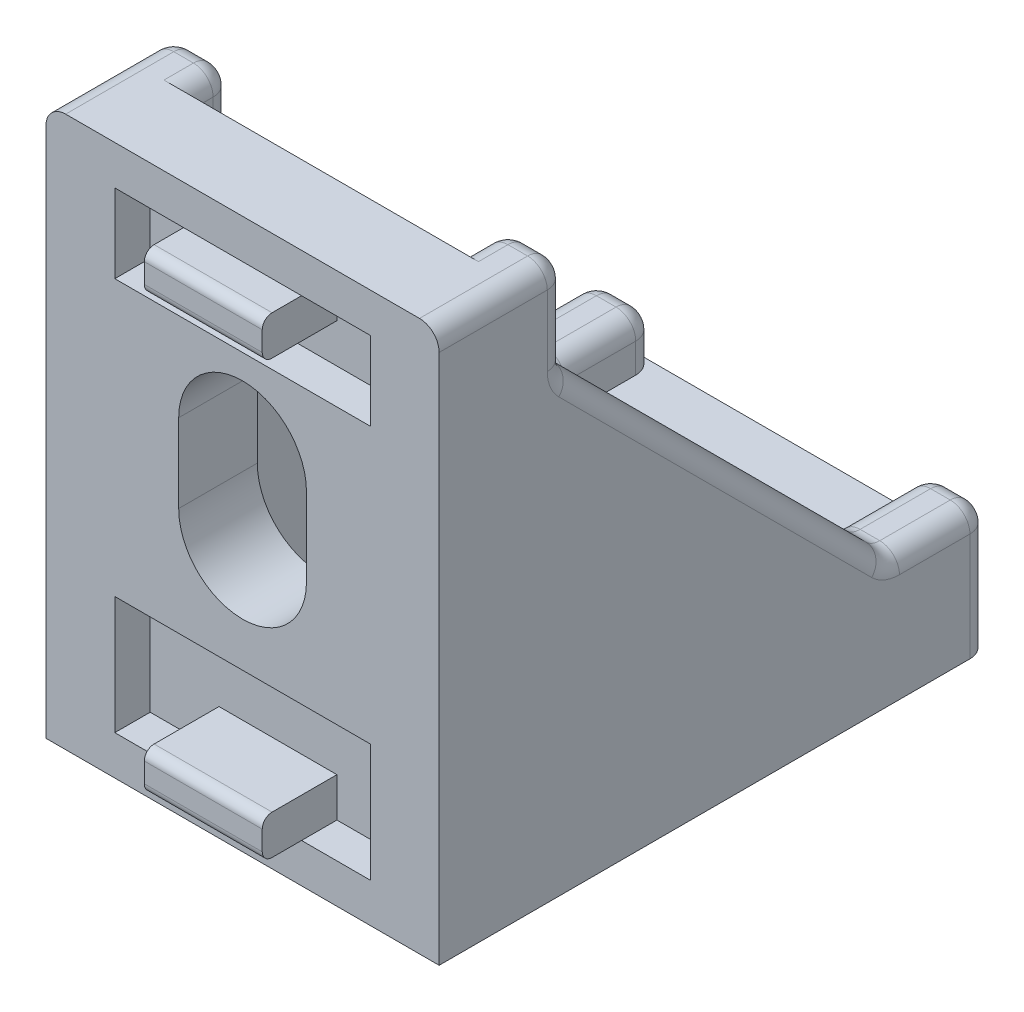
ISO-10303-21;
HEADER;
FILE_DESCRIPTION(('STEP AP214'),'2;1');
FILE_NAME('part.step','',(''),(''),'','','');
FILE_SCHEMA(('AUTOMOTIVE_DESIGN { 1 0 10303 214 1 1 1 1 }'));
ENDSEC;
DATA;
#1=APPLICATION_CONTEXT('core data for automotive mechanical design processes');
#2=APPLICATION_PROTOCOL_DEFINITION('international standard','automotive_design',2000,#1);
#3=PRODUCT_CONTEXT('',#1,'mechanical');
#4=PRODUCT('Part','Part','',(#3));
#5=PRODUCT_RELATED_PRODUCT_CATEGORY('part','',(#4));
#6=PRODUCT_DEFINITION_FORMATION('','',#4);
#7=PRODUCT_DEFINITION_CONTEXT('part definition',#1,'design');
#8=PRODUCT_DEFINITION('design','',#6,#7);
#9=PRODUCT_DEFINITION_SHAPE('','',#8);
#10=(LENGTH_UNIT() NAMED_UNIT(*) SI_UNIT(.MILLI.,.METRE.));
#11=(NAMED_UNIT(*) PLANE_ANGLE_UNIT() SI_UNIT($,.RADIAN.));
#12=(NAMED_UNIT(*) SI_UNIT($,.STERADIAN.) SOLID_ANGLE_UNIT());
#13=UNCERTAINTY_MEASURE_WITH_UNIT(LENGTH_MEASURE(1.E-05),#10,'distance_accuracy_value','');
#14=(GEOMETRIC_REPRESENTATION_CONTEXT(3) GLOBAL_UNCERTAINTY_ASSIGNED_CONTEXT((#13)) GLOBAL_UNIT_ASSIGNED_CONTEXT((#10,
#11,#12)) REPRESENTATION_CONTEXT('',''));
#15=CARTESIAN_POINT('',(0.,0.,0.));
#16=DIRECTION('',(0.,0.,1.));
#17=DIRECTION('',(1.,0.,0.));
#18=AXIS2_PLACEMENT_3D('',#15,#16,#17);
#19=CARTESIAN_POINT('',(17.,0.,0.));
#20=DIRECTION('',(0.,0.,-1.));
#21=DIRECTION('',(-1.,0.,0.));
#22=AXIS2_PLACEMENT_3D('',#19,#20,#21);
#23=PLANE('',#22);
#24=DIRECTION('',(-1.,0.,0.));
#25=VECTOR('',#24,1.);
#26=CARTESIAN_POINT('',(9.99999999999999,2.,0.));
#27=LINE('',#26,#25);
#28=CARTESIAN_POINT('',(16.5,2.,0.));
#29=VERTEX_POINT('',#28);
#30=CARTESIAN_POINT('',(13.,2.,0.));
#31=VERTEX_POINT('',#30);
#32=EDGE_CURVE('E667',#29,#31,#27,.T.);
#33=ORIENTED_EDGE('',*,*,#32,.T.);
#34=DIRECTION('',(1.,0.,0.));
#35=VECTOR('',#34,1.);
#36=CARTESIAN_POINT('',(10.,2.,0.));
#37=LINE('',#36,#35);
#38=CARTESIAN_POINT('',(7.,2.,0.));
#39=VERTEX_POINT('',#38);
#40=EDGE_CURVE('E722',#39,#31,#37,.T.);
#41=ORIENTED_EDGE('',*,*,#40,.F.);
#42=DIRECTION('',(-1.,0.,0.));
#43=VECTOR('',#42,1.);
#44=CARTESIAN_POINT('',(10.,2.,0.));
#45=LINE('',#44,#43);
#46=CARTESIAN_POINT('',(3.5,2.,0.));
#47=VERTEX_POINT('',#46);
#48=EDGE_CURVE('E692',#39,#47,#45,.T.);
#49=ORIENTED_EDGE('',*,*,#48,.T.);
#50=DIRECTION('',(0.,1.,0.));
#51=VECTOR('',#50,1.);
#52=CARTESIAN_POINT('',(3.5,40.9055764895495,0.));
#53=LINE('',#52,#51);
#54=CARTESIAN_POINT('',(3.5,7.99999999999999,0.));
#55=VERTEX_POINT('',#54);
#56=EDGE_CURVE('E689',#47,#55,#53,.T.);
#57=ORIENTED_EDGE('',*,*,#56,.T.);
#58=DIRECTION('',(1.,0.,0.));
#59=VECTOR('',#58,1.);
#60=CARTESIAN_POINT('',(10.,8.,0.));
#61=LINE('',#60,#59);
#62=CARTESIAN_POINT('',(16.5,8.,0.));
#63=VERTEX_POINT('',#62);
#64=EDGE_CURVE('E686',#55,#63,#61,.T.);
#65=ORIENTED_EDGE('',*,*,#64,.T.);
#66=DIRECTION('',(0.,-1.,0.));
#67=VECTOR('',#66,1.);
#68=CARTESIAN_POINT('',(16.5,40.9055764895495,0.));
#69=LINE('',#68,#67);
#70=EDGE_CURVE('E652',#63,#29,#69,.T.);
#71=ORIENTED_EDGE('',*,*,#70,.T.);
#72=EDGE_LOOP('',(#33,#41,#49,#57,#65,#71));
#73=FACE_BOUND('',#72,.T.);
#74=DIRECTION('',(0.,1.,0.));
#75=VECTOR('',#74,1.);
#76=CARTESIAN_POINT('',(6.75,17.5,0.));
#77=LINE('',#76,#75);
#78=CARTESIAN_POINT('',(6.75,13.5,0.));
#79=VERTEX_POINT('',#78);
#80=CARTESIAN_POINT('',(6.75,17.5,0.));
#81=VERTEX_POINT('',#80);
#82=EDGE_CURVE('E921',#79,#81,#77,.T.);
#83=ORIENTED_EDGE('',*,*,#82,.T.);
#84=CARTESIAN_POINT('',(10.,17.5,0.));
#85=DIRECTION('',(0.,0.,-1.));
#86=DIRECTION('',(0.,1.,0.));
#87=AXIS2_PLACEMENT_3D('',#84,#85,#86);
#88=CIRCLE('',#87,3.25);
#89=CARTESIAN_POINT('',(13.25,17.5,0.));
#90=VERTEX_POINT('',#89);
#91=EDGE_CURVE('E911',#81,#90,#88,.T.);
#92=ORIENTED_EDGE('',*,*,#91,.T.);
#93=DIRECTION('',(0.,-1.,0.));
#94=VECTOR('',#93,1.);
#95=CARTESIAN_POINT('',(13.25,17.5,0.));
#96=LINE('',#95,#94);
#97=CARTESIAN_POINT('',(13.25,13.5,0.));
#98=VERTEX_POINT('',#97);
#99=EDGE_CURVE('E914',#90,#98,#96,.T.);
#100=ORIENTED_EDGE('',*,*,#99,.T.);
#101=CARTESIAN_POINT('',(10.,13.5,0.));
#102=DIRECTION('',(0.,0.,-1.));
#103=DIRECTION('',(0.,1.,0.));
#104=AXIS2_PLACEMENT_3D('',#101,#102,#103);
#105=CIRCLE('',#104,3.25);
#106=EDGE_CURVE('E918',#98,#79,#105,.T.);
#107=ORIENTED_EDGE('',*,*,#106,.T.);
#108=EDGE_LOOP('',(#83,#92,#100,#107));
#109=FACE_BOUND('',#108,.T.);
#110=DIRECTION('',(-1.,0.,0.));
#111=VECTOR('',#110,1.);
#112=CARTESIAN_POINT('',(17.,28.,0.));
#113=LINE('',#112,#111);
#114=CARTESIAN_POINT('',(19.,28.,0.));
#115=VERTEX_POINT('',#114);
#116=CARTESIAN_POINT('',(1.,28.,0.));
#117=VERTEX_POINT('',#116);
#118=EDGE_CURVE('E1727',#115,#117,#113,.T.);
#119=ORIENTED_EDGE('',*,*,#118,.T.);
#120=CARTESIAN_POINT('',(1.,27.,0.));
#121=DIRECTION('',(0.,0.,-1.));
#122=DIRECTION('',(-1.,0.,0.));
#123=AXIS2_PLACEMENT_3D('',#120,#121,#122);
#124=CIRCLE('',#123,1.);
#125=CARTESIAN_POINT('',(0.,27.,0.));
#126=VERTEX_POINT('',#125);
#127=EDGE_CURVE('E1090',#117,#126,#124,.F.);
#128=ORIENTED_EDGE('',*,*,#127,.T.);
#129=DIRECTION('',(0.,-1.,0.));
#130=VECTOR('',#129,1.);
#131=CARTESIAN_POINT('',(0.,0.,0.));
#132=LINE('',#131,#130);
#133=CARTESIAN_POINT('',(0.,0.,0.));
#134=VERTEX_POINT('',#133);
#135=EDGE_CURVE('E978',#126,#134,#132,.T.);
#136=ORIENTED_EDGE('',*,*,#135,.T.);
#137=DIRECTION('',(-1.,0.,0.));
#138=VECTOR('',#137,1.);
#139=CARTESIAN_POINT('',(17.,0.,0.));
#140=LINE('',#139,#138);
#141=CARTESIAN_POINT('',(20.,0.,0.));
#142=VERTEX_POINT('',#141);
#143=EDGE_CURVE('E961',#142,#134,#140,.T.);
#144=ORIENTED_EDGE('',*,*,#143,.F.);
#145=DIRECTION('',(0.,-1.,0.));
#146=VECTOR('',#145,1.);
#147=CARTESIAN_POINT('',(20.,28.,0.));
#148=LINE('',#147,#146);
#149=CARTESIAN_POINT('',(20.,27.,0.));
#150=VERTEX_POINT('',#149);
#151=EDGE_CURVE('E947',#150,#142,#148,.T.);
#152=ORIENTED_EDGE('',*,*,#151,.F.);
#153=CARTESIAN_POINT('',(19.,27.,0.));
#154=DIRECTION('',(0.,0.,-1.));
#155=DIRECTION('',(-1.,0.,0.));
#156=AXIS2_PLACEMENT_3D('',#153,#154,#155);
#157=CIRCLE('',#156,1.);
#158=EDGE_CURVE('E1059',#150,#115,#157,.F.);
#159=ORIENTED_EDGE('',*,*,#158,.T.);
#160=EDGE_LOOP('',(#119,#128,#136,#144,#152,#159));
#161=FACE_BOUND('',#160,.T.);
#162=DIRECTION('',(1.,0.,0.));
#163=VECTOR('',#162,1.);
#164=CARTESIAN_POINT('',(13.,26.,0.));
#165=LINE('',#164,#163);
#166=CARTESIAN_POINT('',(13.,26.,0.));
#167=VERTEX_POINT('',#166);
#168=CARTESIAN_POINT('',(16.5,26.,0.));
#169=VERTEX_POINT('',#168);
#170=EDGE_CURVE('E622',#167,#169,#165,.T.);
#171=ORIENTED_EDGE('',*,*,#170,.T.);
#172=DIRECTION('',(0.,-1.,0.));
#173=VECTOR('',#172,1.);
#174=CARTESIAN_POINT('',(16.5,26.,0.));
#175=LINE('',#174,#173);
#176=CARTESIAN_POINT('',(16.5,22.,0.));
#177=VERTEX_POINT('',#176);
#178=EDGE_CURVE('E625',#169,#177,#175,.T.);
#179=ORIENTED_EDGE('',*,*,#178,.T.);
#180=DIRECTION('',(-1.,0.,0.));
#181=VECTOR('',#180,1.);
#182=CARTESIAN_POINT('',(16.5,22.,0.));
#183=LINE('',#182,#181);
#184=CARTESIAN_POINT('',(3.5,22.,0.));
#185=VERTEX_POINT('',#184);
#186=EDGE_CURVE('E645',#177,#185,#183,.T.);
#187=ORIENTED_EDGE('',*,*,#186,.T.);
#188=DIRECTION('',(0.,1.,0.));
#189=VECTOR('',#188,1.);
#190=CARTESIAN_POINT('',(3.5,22.,0.));
#191=LINE('',#190,#189);
#192=CARTESIAN_POINT('',(3.5,26.,0.));
#193=VERTEX_POINT('',#192);
#194=EDGE_CURVE('E642',#185,#193,#191,.T.);
#195=ORIENTED_EDGE('',*,*,#194,.T.);
#196=DIRECTION('',(1.,0.,0.));
#197=VECTOR('',#196,1.);
#198=CARTESIAN_POINT('',(3.5,26.,0.));
#199=LINE('',#198,#197);
#200=CARTESIAN_POINT('',(7.,26.,0.));
#201=VERTEX_POINT('',#200);
#202=EDGE_CURVE('E639',#193,#201,#199,.T.);
#203=ORIENTED_EDGE('',*,*,#202,.T.);
#204=DIRECTION('',(1.,0.,0.));
#205=VECTOR('',#204,1.);
#206=CARTESIAN_POINT('',(13.,26.,0.));
#207=LINE('',#206,#205);
#208=EDGE_CURVE('E700',#201,#167,#207,.T.);
#209=ORIENTED_EDGE('',*,*,#208,.T.);
#210=EDGE_LOOP('',(#171,#179,#187,#195,#203,#209));
#211=FACE_BOUND('',#210,.T.);
#212=ADVANCED_FACE('F40',(#73,#109,#161,#211),#23,.F.);
#213=CARTESIAN_POINT('',(17.,0.,-28.));
#214=DIRECTION('',(0.,1.,0.));
#215=DIRECTION('',(0.,0.,1.));
#216=AXIS2_PLACEMENT_3D('',#213,#214,#215);
#217=PLANE('',#216);
#218=DIRECTION('',(0.,0.,-1.));
#219=VECTOR('',#218,1.);
#220=CARTESIAN_POINT('',(3.5,0.,-40.9055764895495));
#221=LINE('',#220,#219);
#222=CARTESIAN_POINT('',(3.5,0.,-2.));
#223=VERTEX_POINT('',#222);
#224=CARTESIAN_POINT('',(3.5,0.,-7.99999999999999));
#225=VERTEX_POINT('',#224);
#226=EDGE_CURVE('E826',#223,#225,#221,.T.);
#227=ORIENTED_EDGE('',*,*,#226,.F.);
#228=DIRECTION('',(-1.,0.,0.));
#229=VECTOR('',#228,1.);
#230=CARTESIAN_POINT('',(10.,0.,-2.));
#231=LINE('',#230,#229);
#232=CARTESIAN_POINT('',(7.,0.,-2.));
#233=VERTEX_POINT('',#232);
#234=EDGE_CURVE('E823',#233,#223,#231,.T.);
#235=ORIENTED_EDGE('',*,*,#234,.F.);
#236=DIRECTION('',(1.,0.,0.));
#237=VECTOR('',#236,1.);
#238=CARTESIAN_POINT('',(10.,0.,-2.));
#239=LINE('',#238,#237);
#240=CARTESIAN_POINT('',(13.,0.,-2.));
#241=VERTEX_POINT('',#240);
#242=EDGE_CURVE('E860',#233,#241,#239,.T.);
#243=ORIENTED_EDGE('',*,*,#242,.T.);
#244=DIRECTION('',(-1.,0.,0.));
#245=VECTOR('',#244,1.);
#246=CARTESIAN_POINT('',(9.99999999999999,0.,-2.));
#247=LINE('',#246,#245);
#248=CARTESIAN_POINT('',(16.5,0.,-2.));
#249=VERTEX_POINT('',#248);
#250=EDGE_CURVE('E820',#249,#241,#247,.T.);
#251=ORIENTED_EDGE('',*,*,#250,.F.);
#252=DIRECTION('',(0.,0.,1.));
#253=VECTOR('',#252,1.);
#254=CARTESIAN_POINT('',(16.5,0.,-40.9055764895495));
#255=LINE('',#254,#253);
#256=CARTESIAN_POINT('',(16.5,0.,-8.));
#257=VERTEX_POINT('',#256);
#258=EDGE_CURVE('E781',#257,#249,#255,.T.);
#259=ORIENTED_EDGE('',*,*,#258,.F.);
#260=DIRECTION('',(1.,0.,0.));
#261=VECTOR('',#260,1.);
#262=CARTESIAN_POINT('',(10.,0.,-8.));
#263=LINE('',#262,#261);
#264=EDGE_CURVE('E796',#225,#257,#263,.T.);
#265=ORIENTED_EDGE('',*,*,#264,.F.);
#266=EDGE_LOOP('',(#227,#235,#243,#251,#259,#265));
#267=FACE_BOUND('',#266,.T.);
#268=DIRECTION('',(0.,0.,-1.));
#269=VECTOR('',#268,1.);
#270=CARTESIAN_POINT('',(13.25,0.,-17.5));
#271=LINE('',#270,#269);
#272=CARTESIAN_POINT('',(13.25,0.,-13.5));
#273=VERTEX_POINT('',#272);
#274=CARTESIAN_POINT('',(13.25,0.,-17.5));
#275=VERTEX_POINT('',#274);
#276=EDGE_CURVE('E887',#273,#275,#271,.T.);
#277=ORIENTED_EDGE('',*,*,#276,.T.);
#278=CARTESIAN_POINT('',(10.,0.,-17.5));
#279=DIRECTION('',(0.,1.,0.));
#280=DIRECTION('',(0.,0.,1.));
#281=AXIS2_PLACEMENT_3D('',#278,#279,#280);
#282=CIRCLE('',#281,3.25);
#283=CARTESIAN_POINT('',(6.75,0.,-17.5));
#284=VERTEX_POINT('',#283);
#285=EDGE_CURVE('E877',#275,#284,#282,.T.);
#286=ORIENTED_EDGE('',*,*,#285,.T.);
#287=DIRECTION('',(0.,0.,1.));
#288=VECTOR('',#287,1.);
#289=CARTESIAN_POINT('',(6.75,0.,-17.5));
#290=LINE('',#289,#288);
#291=CARTESIAN_POINT('',(6.75,0.,-13.5));
#292=VERTEX_POINT('',#291);
#293=EDGE_CURVE('E880',#284,#292,#290,.T.);
#294=ORIENTED_EDGE('',*,*,#293,.T.);
#295=CARTESIAN_POINT('',(10.,0.,-13.5));
#296=DIRECTION('',(0.,1.,0.));
#297=DIRECTION('',(0.,0.,1.));
#298=AXIS2_PLACEMENT_3D('',#295,#296,#297);
#299=CIRCLE('',#298,3.25);
#300=EDGE_CURVE('E884',#292,#273,#299,.T.);
#301=ORIENTED_EDGE('',*,*,#300,.T.);
#302=EDGE_LOOP('',(#277,#286,#294,#301));
#303=FACE_BOUND('',#302,.T.);
#304=DIRECTION('',(0.,0.,-1.));
#305=VECTOR('',#304,1.);
#306=CARTESIAN_POINT('',(0.,0.,-28.));
#307=LINE('',#306,#305);
#308=CARTESIAN_POINT('',(0.,0.,-27.));
#309=VERTEX_POINT('',#308);
#310=EDGE_CURVE('E952',#134,#309,#307,.T.);
#311=ORIENTED_EDGE('',*,*,#310,.T.);
#312=CARTESIAN_POINT('',(1.,0.,-27.));
#313=DIRECTION('',(0.,1.,0.));
#314=DIRECTION('',(0.,0.,1.));
#315=AXIS2_PLACEMENT_3D('',#312,#313,#314);
#316=CIRCLE('',#315,1.);
#317=CARTESIAN_POINT('',(1.,0.,-28.));
#318=VERTEX_POINT('',#317);
#319=EDGE_CURVE('E1026',#309,#318,#316,.F.);
#320=ORIENTED_EDGE('',*,*,#319,.T.);
#321=DIRECTION('',(-1.,0.,0.));
#322=VECTOR('',#321,1.);
#323=CARTESIAN_POINT('',(17.,0.,-28.));
#324=LINE('',#323,#322);
#325=CARTESIAN_POINT('',(19.,0.,-28.));
#326=VERTEX_POINT('',#325);
#327=EDGE_CURVE('E967',#326,#318,#324,.T.);
#328=ORIENTED_EDGE('',*,*,#327,.F.);
#329=CARTESIAN_POINT('',(19.,0.,-27.));
#330=DIRECTION('',(0.,1.,0.));
#331=DIRECTION('',(0.,0.,1.));
#332=AXIS2_PLACEMENT_3D('',#329,#330,#331);
#333=CIRCLE('',#332,1.);
#334=CARTESIAN_POINT('',(20.,0.,-27.));
#335=VERTEX_POINT('',#334);
#336=EDGE_CURVE('E991',#326,#335,#333,.F.);
#337=ORIENTED_EDGE('',*,*,#336,.T.);
#338=DIRECTION('',(0.,0.,-1.));
#339=VECTOR('',#338,1.);
#340=CARTESIAN_POINT('',(20.,0.,0.));
#341=LINE('',#340,#339);
#342=EDGE_CURVE('E949',#142,#335,#341,.T.);
#343=ORIENTED_EDGE('',*,*,#342,.F.);
#344=ORIENTED_EDGE('',*,*,#143,.T.);
#345=EDGE_LOOP('',(#311,#320,#328,#337,#343,#344));
#346=FACE_BOUND('',#345,.T.);
#347=DIRECTION('',(1.,0.,0.));
#348=VECTOR('',#347,1.);
#349=CARTESIAN_POINT('',(13.,0.,-26.));
#350=LINE('',#349,#348);
#351=CARTESIAN_POINT('',(7.,0.,-26.));
#352=VERTEX_POINT('',#351);
#353=CARTESIAN_POINT('',(13.,0.,-26.));
#354=VERTEX_POINT('',#353);
#355=EDGE_CURVE('E833',#352,#354,#350,.T.);
#356=ORIENTED_EDGE('',*,*,#355,.F.);
#357=DIRECTION('',(1.,0.,0.));
#358=VECTOR('',#357,1.);
#359=CARTESIAN_POINT('',(3.5,0.,-26.));
#360=LINE('',#359,#358);
#361=CARTESIAN_POINT('',(3.5,0.,-26.));
#362=VERTEX_POINT('',#361);
#363=EDGE_CURVE('E743',#362,#352,#360,.T.);
#364=ORIENTED_EDGE('',*,*,#363,.F.);
#365=DIRECTION('',(0.,0.,-1.));
#366=VECTOR('',#365,1.);
#367=CARTESIAN_POINT('',(3.5,0.,-22.));
#368=LINE('',#367,#366);
#369=CARTESIAN_POINT('',(3.5,0.,-22.));
#370=VERTEX_POINT('',#369);
#371=EDGE_CURVE('E773',#370,#362,#368,.T.);
#372=ORIENTED_EDGE('',*,*,#371,.F.);
#373=DIRECTION('',(-1.,0.,0.));
#374=VECTOR('',#373,1.);
#375=CARTESIAN_POINT('',(16.5,0.,-22.));
#376=LINE('',#375,#374);
#377=CARTESIAN_POINT('',(16.5,0.,-22.));
#378=VERTEX_POINT('',#377);
#379=EDGE_CURVE('E770',#378,#370,#376,.T.);
#380=ORIENTED_EDGE('',*,*,#379,.F.);
#381=DIRECTION('',(0.,0.,1.));
#382=VECTOR('',#381,1.);
#383=CARTESIAN_POINT('',(16.5,0.,-26.));
#384=LINE('',#383,#382);
#385=CARTESIAN_POINT('',(16.5,0.,-26.));
#386=VERTEX_POINT('',#385);
#387=EDGE_CURVE('E767',#386,#378,#384,.T.);
#388=ORIENTED_EDGE('',*,*,#387,.F.);
#389=DIRECTION('',(1.,0.,0.));
#390=VECTOR('',#389,1.);
#391=CARTESIAN_POINT('',(13.,0.,-26.));
#392=LINE('',#391,#390);
#393=EDGE_CURVE('E738',#354,#386,#392,.T.);
#394=ORIENTED_EDGE('',*,*,#393,.F.);
#395=EDGE_LOOP('',(#356,#364,#372,#380,#388,#394));
#396=FACE_BOUND('',#395,.T.);
#397=ADVANCED_FACE('F1217',(#267,#303,#346,#396),#217,.F.);
#398=CARTESIAN_POINT('',(17.,4.,-4.));
#399=DIRECTION('',(0.,-1.,0.));
#400=DIRECTION('',(0.,0.,-1.));
#401=AXIS2_PLACEMENT_3D('',#398,#399,#400);
#402=PLANE('',#401);
#403=DIRECTION('',(0.,0.,1.));
#404=VECTOR('',#403,1.);
#405=CARTESIAN_POINT('',(6.75,4.,-17.5));
#406=LINE('',#405,#404);
#407=CARTESIAN_POINT('',(6.75,4.,-17.5));
#408=VERTEX_POINT('',#407);
#409=CARTESIAN_POINT('',(6.75,4.,-13.5));
#410=VERTEX_POINT('',#409);
#411=EDGE_CURVE('E893',#408,#410,#406,.T.);
#412=ORIENTED_EDGE('',*,*,#411,.F.);
#413=CARTESIAN_POINT('',(10.,4.,-17.5));
#414=DIRECTION('',(0.,1.,0.));
#415=DIRECTION('',(0.,0.,1.));
#416=AXIS2_PLACEMENT_3D('',#413,#414,#415);
#417=CIRCLE('',#416,3.25);
#418=CARTESIAN_POINT('',(13.25,4.,-17.5));
#419=VERTEX_POINT('',#418);
#420=EDGE_CURVE('E891',#419,#408,#417,.T.);
#421=ORIENTED_EDGE('',*,*,#420,.F.);
#422=DIRECTION('',(0.,0.,-1.));
#423=VECTOR('',#422,1.);
#424=CARTESIAN_POINT('',(13.25,4.,-17.5));
#425=LINE('',#424,#423);
#426=CARTESIAN_POINT('',(13.25,4.,-13.5));
#427=VERTEX_POINT('',#426);
#428=EDGE_CURVE('E881',#427,#419,#425,.T.);
#429=ORIENTED_EDGE('',*,*,#428,.F.);
#430=CARTESIAN_POINT('',(10.,4.,-13.5));
#431=DIRECTION('',(0.,1.,0.));
#432=DIRECTION('',(0.,0.,1.));
#433=AXIS2_PLACEMENT_3D('',#430,#431,#432);
#434=CIRCLE('',#433,3.25);
#435=EDGE_CURVE('E897',#410,#427,#434,.T.);
#436=ORIENTED_EDGE('',*,*,#435,.F.);
#437=EDGE_LOOP('',(#412,#421,#429,#436));
#438=FACE_BOUND('',#437,.T.);
#439=DIRECTION('',(-1.,0.,0.));
#440=VECTOR('',#439,1.);
#441=CARTESIAN_POINT('',(17.,4.,-28.));
#442=LINE('',#441,#440);
#443=CARTESIAN_POINT('',(18.,4.,-28.));
#444=VERTEX_POINT('',#443);
#445=CARTESIAN_POINT('',(2.,4.,-28.));
#446=VERTEX_POINT('',#445);
#447=EDGE_CURVE('E965',#444,#446,#442,.T.);
#448=ORIENTED_EDGE('',*,*,#447,.T.);
#449=CARTESIAN_POINT('',(2.,4.,-27.));
#450=DIRECTION('',(0.,-1.,0.));
#451=DIRECTION('',(0.,0.,-1.));
#452=AXIS2_PLACEMENT_3D('',#449,#450,#451);
#453=CIRCLE('',#452,1.);
#454=CARTESIAN_POINT('',(3.,4.,-27.));
#455=VERTEX_POINT('',#454);
#456=EDGE_CURVE('E1028',#446,#455,#453,.T.);
#457=ORIENTED_EDGE('',*,*,#456,.T.);
#458=DIRECTION('',(0.,0.,1.));
#459=VECTOR('',#458,1.);
#460=CARTESIAN_POINT('',(3.,4.,-4.));
#461=LINE('',#460,#459);
#462=CARTESIAN_POINT('',(3.,4.,-4.));
#463=VERTEX_POINT('',#462);
#464=EDGE_CURVE('E945',#455,#463,#461,.T.);
#465=ORIENTED_EDGE('',*,*,#464,.T.);
#466=DIRECTION('',(-1.,0.,0.));
#467=VECTOR('',#466,1.);
#468=CARTESIAN_POINT('',(17.,4.,-4.));
#469=LINE('',#468,#467);
#470=CARTESIAN_POINT('',(17.,4.,-4.));
#471=VERTEX_POINT('',#470);
#472=EDGE_CURVE('E968',#471,#463,#469,.T.);
#473=ORIENTED_EDGE('',*,*,#472,.F.);
#474=DIRECTION('',(0.,0.,1.));
#475=VECTOR('',#474,1.);
#476=CARTESIAN_POINT('',(17.,4.,-4.));
#477=LINE('',#476,#475);
#478=CARTESIAN_POINT('',(17.,4.,-27.));
#479=VERTEX_POINT('',#478);
#480=EDGE_CURVE('E962',#479,#471,#477,.T.);
#481=ORIENTED_EDGE('',*,*,#480,.F.);
#482=CARTESIAN_POINT('',(18.,4.,-27.));
#483=DIRECTION('',(0.,-1.,0.));
#484=DIRECTION('',(0.,0.,-1.));
#485=AXIS2_PLACEMENT_3D('',#482,#483,#484);
#486=CIRCLE('',#485,1.);
#487=EDGE_CURVE('E993',#479,#444,#486,.T.);
#488=ORIENTED_EDGE('',*,*,#487,.T.);
#489=EDGE_LOOP('',(#448,#457,#465,#473,#481,#488));
#490=FACE_BOUND('',#489,.T.);
#491=ADVANCED_FACE('F1223',(#438,#490),#402,.F.);
#492=CARTESIAN_POINT('',(17.,28.,-4.));
#493=DIRECTION('',(0.,0.,1.));
#494=DIRECTION('',(0.,-1.,0.));
#495=AXIS2_PLACEMENT_3D('',#492,#493,#494);
#496=PLANE('',#495);
#497=DIRECTION('',(0.,-1.,0.));
#498=VECTOR('',#497,1.);
#499=CARTESIAN_POINT('',(13.25,17.5,-4.));
#500=LINE('',#499,#498);
#501=CARTESIAN_POINT('',(13.25,17.5,-4.));
#502=VERTEX_POINT('',#501);
#503=CARTESIAN_POINT('',(13.25,13.5,-4.));
#504=VERTEX_POINT('',#503);
#505=EDGE_CURVE('E926',#502,#504,#500,.T.);
#506=ORIENTED_EDGE('',*,*,#505,.F.);
#507=CARTESIAN_POINT('',(10.,17.5,-4.));
#508=DIRECTION('',(0.,0.,-1.));
#509=DIRECTION('',(0.,1.,0.));
#510=AXIS2_PLACEMENT_3D('',#507,#508,#509);
#511=CIRCLE('',#510,3.25);
#512=CARTESIAN_POINT('',(6.75,17.5,-4.));
#513=VERTEX_POINT('',#512);
#514=EDGE_CURVE('E904',#513,#502,#511,.T.);
#515=ORIENTED_EDGE('',*,*,#514,.F.);
#516=DIRECTION('',(0.,1.,0.));
#517=VECTOR('',#516,1.);
#518=CARTESIAN_POINT('',(6.75,17.5,-4.));
#519=LINE('',#518,#517);
#520=CARTESIAN_POINT('',(6.75,13.5,-4.));
#521=VERTEX_POINT('',#520);
#522=EDGE_CURVE('E915',#521,#513,#519,.T.);
#523=ORIENTED_EDGE('',*,*,#522,.F.);
#524=CARTESIAN_POINT('',(10.,13.5,-4.));
#525=DIRECTION('',(0.,0.,-1.));
#526=DIRECTION('',(0.,1.,0.));
#527=AXIS2_PLACEMENT_3D('',#524,#525,#526);
#528=CIRCLE('',#527,3.25);
#529=EDGE_CURVE('E929',#504,#521,#528,.T.);
#530=ORIENTED_EDGE('',*,*,#529,.F.);
#531=EDGE_LOOP('',(#506,#515,#523,#530));
#532=FACE_BOUND('',#531,.T.);
#533=DIRECTION('',(0.,1.,0.));
#534=VECTOR('',#533,1.);
#535=CARTESIAN_POINT('',(3.,4.,-4.));
#536=LINE('',#535,#534);
#537=CARTESIAN_POINT('',(3.,27.,-4.));
#538=VERTEX_POINT('',#537);
#539=EDGE_CURVE('E936',#463,#538,#536,.T.);
#540=ORIENTED_EDGE('',*,*,#539,.T.);
#541=CARTESIAN_POINT('',(2.,27.,-4.));
#542=DIRECTION('',(0.,0.,1.));
#543=DIRECTION('',(0.,-1.,0.));
#544=AXIS2_PLACEMENT_3D('',#541,#542,#543);
#545=CIRCLE('',#544,1.);
#546=CARTESIAN_POINT('',(2.,28.,-4.));
#547=VERTEX_POINT('',#546);
#548=EDGE_CURVE('E1094',#538,#547,#545,.T.);
#549=ORIENTED_EDGE('',*,*,#548,.T.);
#550=DIRECTION('',(-1.,0.,0.));
#551=VECTOR('',#550,1.);
#552=CARTESIAN_POINT('',(17.,28.,-4.));
#553=LINE('',#552,#551);
#554=CARTESIAN_POINT('',(18.,28.,-4.));
#555=VERTEX_POINT('',#554);
#556=EDGE_CURVE('E1731',#555,#547,#553,.T.);
#557=ORIENTED_EDGE('',*,*,#556,.F.);
#558=CARTESIAN_POINT('',(18.,27.,-4.));
#559=DIRECTION('',(0.,0.,1.));
#560=DIRECTION('',(0.,-1.,0.));
#561=AXIS2_PLACEMENT_3D('',#558,#559,#560);
#562=CIRCLE('',#561,1.);
#563=CARTESIAN_POINT('',(17.,27.,-4.));
#564=VERTEX_POINT('',#563);
#565=EDGE_CURVE('E1061',#555,#564,#562,.T.);
#566=ORIENTED_EDGE('',*,*,#565,.T.);
#567=DIRECTION('',(0.,1.,0.));
#568=VECTOR('',#567,1.);
#569=CARTESIAN_POINT('',(17.,28.,-4.));
#570=LINE('',#569,#568);
#571=EDGE_CURVE('E957',#471,#564,#570,.T.);
#572=ORIENTED_EDGE('',*,*,#571,.F.);
#573=ORIENTED_EDGE('',*,*,#472,.T.);
#574=EDGE_LOOP('',(#540,#549,#557,#566,#572,#573));
#575=FACE_BOUND('',#574,.T.);
#576=ADVANCED_FACE('F1236',(#532,#575),#496,.F.);
#577=CARTESIAN_POINT('',(17.,4.,-28.));
#578=DIRECTION('',(0.,0.,1.));
#579=DIRECTION('',(1.,0.,0.));
#580=AXIS2_PLACEMENT_3D('',#577,#578,#579);
#581=PLANE('',#580);
#582=DIRECTION('',(0.,-1.,0.));
#583=VECTOR('',#582,1.);
#584=CARTESIAN_POINT('',(2.,4.,-28.));
#585=LINE('',#584,#583);
#586=CARTESIAN_POINT('',(2.,5.5,-28.));
#587=VERTEX_POINT('',#586);
#588=EDGE_CURVE('E1013',#587,#446,#585,.T.);
#589=ORIENTED_EDGE('',*,*,#588,.T.);
#590=ORIENTED_EDGE('',*,*,#447,.F.);
#591=DIRECTION('',(0.,1.,0.));
#592=VECTOR('',#591,1.);
#593=CARTESIAN_POINT('',(18.,4.,-28.));
#594=LINE('',#593,#592);
#595=CARTESIAN_POINT('',(18.,5.5,-28.));
#596=VERTEX_POINT('',#595);
#597=EDGE_CURVE('E979',#444,#596,#594,.T.);
#598=ORIENTED_EDGE('',*,*,#597,.T.);
#599=DIRECTION('',(-1.,0.,0.));
#600=VECTOR('',#599,1.);
#601=CARTESIAN_POINT('',(17.,5.5,-28.));
#602=LINE('',#601,#600);
#603=CARTESIAN_POINT('',(19.,5.5,-28.));
#604=VERTEX_POINT('',#603);
#605=EDGE_CURVE('E1667',#596,#604,#602,.F.);
#606=ORIENTED_EDGE('',*,*,#605,.T.);
#607=DIRECTION('',(0.,1.,0.));
#608=VECTOR('',#607,1.);
#609=CARTESIAN_POINT('',(19.,0.,-28.));
#610=LINE('',#609,#608);
#611=EDGE_CURVE('E1852',#604,#326,#610,.F.);
#612=ORIENTED_EDGE('',*,*,#611,.T.);
#613=ORIENTED_EDGE('',*,*,#327,.T.);
#614=DIRECTION('',(0.,1.,0.));
#615=VECTOR('',#614,1.);
#616=CARTESIAN_POINT('',(1.,5.5,-28.));
#617=LINE('',#616,#615);
#618=CARTESIAN_POINT('',(1.,5.5,-28.));
#619=VERTEX_POINT('',#618);
#620=EDGE_CURVE('E996',#318,#619,#617,.T.);
#621=ORIENTED_EDGE('',*,*,#620,.T.);
#622=DIRECTION('',(-1.,0.,0.));
#623=VECTOR('',#622,1.);
#624=CARTESIAN_POINT('',(2.,5.5,-28.));
#625=LINE('',#624,#623);
#626=EDGE_CURVE('E1011',#619,#587,#625,.F.);
#627=ORIENTED_EDGE('',*,*,#626,.T.);
#628=EDGE_LOOP('',(#589,#590,#598,#606,#612,#613,#621,#627));
#629=FACE_BOUND('',#628,.T.);
#630=ADVANCED_FACE('F1234',(#629),#581,.F.);
#631=CARTESIAN_POINT('',(17.,28.,0.));
#632=DIRECTION('',(0.,-1.,0.));
#633=DIRECTION('',(0.,0.,-1.));
#634=AXIS2_PLACEMENT_3D('',#631,#632,#633);
#635=PLANE('',#634);
#636=ORIENTED_EDGE('',*,*,#556,.T.);
#637=DIRECTION('',(0.,0.,-1.));
#638=VECTOR('',#637,1.);
#639=CARTESIAN_POINT('',(2.,28.,0.));
#640=LINE('',#639,#638);
#641=CARTESIAN_POINT('',(2.,28.,-5.5));
#642=VERTEX_POINT('',#641);
#643=EDGE_CURVE('E1079',#547,#642,#640,.T.);
#644=ORIENTED_EDGE('',*,*,#643,.T.);
#645=DIRECTION('',(-1.,0.,0.));
#646=VECTOR('',#645,1.);
#647=CARTESIAN_POINT('',(1.,28.,-5.5));
#648=LINE('',#647,#646);
#649=CARTESIAN_POINT('',(1.,28.,-5.5));
#650=VERTEX_POINT('',#649);
#651=EDGE_CURVE('E1077',#642,#650,#648,.T.);
#652=ORIENTED_EDGE('',*,*,#651,.T.);
#653=DIRECTION('',(0.,0.,1.));
#654=VECTOR('',#653,1.);
#655=CARTESIAN_POINT('',(1.,28.,0.));
#656=LINE('',#655,#654);
#657=EDGE_CURVE('E1063',#650,#117,#656,.T.);
#658=ORIENTED_EDGE('',*,*,#657,.T.);
#659=ORIENTED_EDGE('',*,*,#118,.F.);
#660=DIRECTION('',(0.,0.,1.));
#661=VECTOR('',#660,1.);
#662=CARTESIAN_POINT('',(19.,28.,-5.5));
#663=LINE('',#662,#661);
#664=CARTESIAN_POINT('',(19.,28.,-5.5));
#665=VERTEX_POINT('',#664);
#666=EDGE_CURVE('E1030',#115,#665,#663,.F.);
#667=ORIENTED_EDGE('',*,*,#666,.T.);
#668=DIRECTION('',(-1.,0.,0.));
#669=VECTOR('',#668,1.);
#670=CARTESIAN_POINT('',(17.,28.,-5.5));
#671=LINE('',#670,#669);
#672=CARTESIAN_POINT('',(18.,28.,-5.5));
#673=VERTEX_POINT('',#672);
#674=EDGE_CURVE('E1044',#665,#673,#671,.T.);
#675=ORIENTED_EDGE('',*,*,#674,.T.);
#676=DIRECTION('',(0.,0.,1.));
#677=VECTOR('',#676,1.);
#678=CARTESIAN_POINT('',(18.,28.,0.));
#679=LINE('',#678,#677);
#680=EDGE_CURVE('E1046',#673,#555,#679,.T.);
#681=ORIENTED_EDGE('',*,*,#680,.T.);
#682=EDGE_LOOP('',(#636,#644,#652,#658,#659,#667,#675,#681));
#683=FACE_BOUND('',#682,.T.);
#684=ADVANCED_FACE('F1231',(#683),#635,.F.);
#685=CARTESIAN_POINT('',(0.,0.,0.));
#686=DIRECTION('',(-1.,0.,0.));
#687=DIRECTION('',(0.,0.,1.));
#688=AXIS2_PLACEMENT_3D('',#685,#686,#687);
#689=PLANE('',#688);
#690=ORIENTED_EDGE('',*,*,#135,.F.);
#691=DIRECTION('',(0.,0.,1.));
#692=VECTOR('',#691,1.);
#693=CARTESIAN_POINT('',(0.,27.,-5.5));
#694=LINE('',#693,#692);
#695=CARTESIAN_POINT('',(0.,27.,-5.5));
#696=VERTEX_POINT('',#695);
#697=EDGE_CURVE('E1092',#126,#696,#694,.F.);
#698=ORIENTED_EDGE('',*,*,#697,.T.);
#699=DIRECTION('',(0.,-1.,0.));
#700=VECTOR('',#699,1.);
#701=CARTESIAN_POINT('',(0.,0.,-5.5));
#702=LINE('',#701,#700);
#703=CARTESIAN_POINT('',(0.,23.4142135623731,-5.5));
#704=VERTEX_POINT('',#703);
#705=EDGE_CURVE('E1770',#696,#704,#702,.T.);
#706=ORIENTED_EDGE('',*,*,#705,.T.);
#707=CARTESIAN_POINT('',(0.,23.4142135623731,-7.5));
#708=DIRECTION('',(-1.,0.,0.));
#709=DIRECTION('',(0.,0.,1.));
#710=AXIS2_PLACEMENT_3D('',#707,#708,#709);
#711=CIRCLE('',#710,2.);
#712=CARTESIAN_POINT('',(0.,22.,-6.0857864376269));
#713=VERTEX_POINT('',#712);
#714=EDGE_CURVE('E1767',#713,#704,#711,.T.);
#715=ORIENTED_EDGE('',*,*,#714,.F.);
#716=DIRECTION('',(0.,-0.707106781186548,-0.707106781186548));
#717=VECTOR('',#716,1.);
#718=CARTESIAN_POINT('',(0.,14.0428932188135,-14.0428932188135));
#719=LINE('',#718,#717);
#720=CARTESIAN_POINT('',(0.,6.08578643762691,-22.));
#721=VERTEX_POINT('',#720);
#722=EDGE_CURVE('E1765',#713,#721,#719,.T.);
#723=ORIENTED_EDGE('',*,*,#722,.T.);
#724=CARTESIAN_POINT('',(0.,7.5,-23.4142135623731));
#725=DIRECTION('',(-1.,0.,0.));
#726=DIRECTION('',(0.,0.,1.));
#727=AXIS2_PLACEMENT_3D('',#724,#725,#726);
#728=CIRCLE('',#727,2.);
#729=CARTESIAN_POINT('',(0.,5.5,-23.4142135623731));
#730=VERTEX_POINT('',#729);
#731=EDGE_CURVE('E1762',#730,#721,#728,.T.);
#732=ORIENTED_EDGE('',*,*,#731,.F.);
#733=DIRECTION('',(0.,0.,-1.));
#734=VECTOR('',#733,1.);
#735=CARTESIAN_POINT('',(0.,5.5,0.));
#736=LINE('',#735,#734);
#737=CARTESIAN_POINT('',(0.,5.5,-27.));
#738=VERTEX_POINT('',#737);
#739=EDGE_CURVE('E1772',#730,#738,#736,.T.);
#740=ORIENTED_EDGE('',*,*,#739,.T.);
#741=DIRECTION('',(0.,1.,0.));
#742=VECTOR('',#741,1.);
#743=CARTESIAN_POINT('',(0.,0.,-27.));
#744=LINE('',#743,#742);
#745=EDGE_CURVE('E1024',#738,#309,#744,.F.);
#746=ORIENTED_EDGE('',*,*,#745,.T.);
#747=ORIENTED_EDGE('',*,*,#310,.F.);
#748=EDGE_LOOP('',(#690,#698,#706,#715,#723,#732,#740,#746,#747));
#749=FACE_BOUND('',#748,.T.);
#750=ADVANCED_FACE('F1229',(#749),#689,.T.);
#751=CARTESIAN_POINT('',(17.,28.,0.));
#752=DIRECTION('',(1.,0.,0.));
#753=DIRECTION('',(0.,0.,-1.));
#754=AXIS2_PLACEMENT_3D('',#751,#752,#753);
#755=PLANE('',#754);
#756=ORIENTED_EDGE('',*,*,#571,.T.);
#757=DIRECTION('',(0.,0.,1.));
#758=VECTOR('',#757,1.);
#759=CARTESIAN_POINT('',(17.,27.,0.));
#760=LINE('',#759,#758);
#761=CARTESIAN_POINT('',(17.,27.,-5.5));
#762=VERTEX_POINT('',#761);
#763=EDGE_CURVE('E1049',#564,#762,#760,.F.);
#764=ORIENTED_EDGE('',*,*,#763,.T.);
#765=DIRECTION('',(0.,1.,0.));
#766=VECTOR('',#765,1.);
#767=CARTESIAN_POINT('',(17.,28.,-5.5));
#768=LINE('',#767,#766);
#769=CARTESIAN_POINT('',(17.,23.4142135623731,-5.5));
#770=VERTEX_POINT('',#769);
#771=EDGE_CURVE('E1679',#762,#770,#768,.F.);
#772=ORIENTED_EDGE('',*,*,#771,.T.);
#773=CARTESIAN_POINT('',(17.,23.4142135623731,-7.5));
#774=DIRECTION('',(1.,0.,0.));
#775=DIRECTION('',(0.,0.,-1.));
#776=AXIS2_PLACEMENT_3D('',#773,#774,#775);
#777=CIRCLE('',#776,2.);
#778=CARTESIAN_POINT('',(17.,22.,-6.0857864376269));
#779=VERTEX_POINT('',#778);
#780=EDGE_CURVE('E1837',#779,#770,#777,.F.);
#781=ORIENTED_EDGE('',*,*,#780,.F.);
#782=DIRECTION('',(0.,0.707106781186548,0.707106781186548));
#783=VECTOR('',#782,1.);
#784=CARTESIAN_POINT('',(17.,28.0428932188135,-0.0428932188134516));
#785=LINE('',#784,#783);
#786=CARTESIAN_POINT('',(17.,6.0857864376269,-22.));
#787=VERTEX_POINT('',#786);
#788=EDGE_CURVE('E1835',#779,#787,#785,.F.);
#789=ORIENTED_EDGE('',*,*,#788,.T.);
#790=CARTESIAN_POINT('',(17.,7.5,-23.4142135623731));
#791=DIRECTION('',(1.,0.,0.));
#792=DIRECTION('',(0.,0.,-1.));
#793=AXIS2_PLACEMENT_3D('',#790,#791,#792);
#794=CIRCLE('',#793,2.);
#795=CARTESIAN_POINT('',(17.,5.5,-23.4142135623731));
#796=VERTEX_POINT('',#795);
#797=EDGE_CURVE('E1659',#796,#787,#794,.F.);
#798=ORIENTED_EDGE('',*,*,#797,.F.);
#799=DIRECTION('',(0.,0.,1.));
#800=VECTOR('',#799,1.);
#801=CARTESIAN_POINT('',(17.,5.5,0.));
#802=LINE('',#801,#800);
#803=CARTESIAN_POINT('',(17.,5.5,-27.));
#804=VERTEX_POINT('',#803);
#805=EDGE_CURVE('E1673',#796,#804,#802,.F.);
#806=ORIENTED_EDGE('',*,*,#805,.T.);
#807=DIRECTION('',(0.,1.,0.));
#808=VECTOR('',#807,1.);
#809=CARTESIAN_POINT('',(17.,28.,-27.));
#810=LINE('',#809,#808);
#811=EDGE_CURVE('E981',#804,#479,#810,.F.);
#812=ORIENTED_EDGE('',*,*,#811,.T.);
#813=ORIENTED_EDGE('',*,*,#480,.T.);
#814=EDGE_LOOP('',(#756,#764,#772,#781,#789,#798,#806,#812,#813));
#815=FACE_BOUND('',#814,.T.);
#816=ADVANCED_FACE('F1633',(#815),#755,.F.);
#817=CARTESIAN_POINT('',(20.,6.5,-28.));
#818=DIRECTION('',(0.,-1.,0.));
#819=DIRECTION('',(0.,0.,-1.));
#820=AXIS2_PLACEMENT_3D('',#817,#818,#819);
#821=PLANE('',#820);
#822=DIRECTION('',(0.,0.,1.));
#823=VECTOR('',#822,1.);
#824=CARTESIAN_POINT('',(19.,6.5,-28.));
#825=LINE('',#824,#823);
#826=CARTESIAN_POINT('',(19.,6.5,-23.4142135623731));
#827=VERTEX_POINT('',#826);
#828=CARTESIAN_POINT('',(19.,6.5,-27.));
#829=VERTEX_POINT('',#828);
#830=EDGE_CURVE('E1650',#827,#829,#825,.F.);
#831=ORIENTED_EDGE('',*,*,#830,.T.);
#832=DIRECTION('',(-1.,0.,0.));
#833=VECTOR('',#832,1.);
#834=CARTESIAN_POINT('',(20.,6.5,-27.));
#835=LINE('',#834,#833);
#836=CARTESIAN_POINT('',(18.,6.5,-27.));
#837=VERTEX_POINT('',#836);
#838=EDGE_CURVE('E985',#829,#837,#835,.T.);
#839=ORIENTED_EDGE('',*,*,#838,.T.);
#840=DIRECTION('',(0.,0.,1.));
#841=VECTOR('',#840,1.);
#842=CARTESIAN_POINT('',(18.,6.5,-28.));
#843=LINE('',#842,#841);
#844=CARTESIAN_POINT('',(18.,6.5,-23.4142135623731));
#845=VERTEX_POINT('',#844);
#846=EDGE_CURVE('E1660',#837,#845,#843,.T.);
#847=ORIENTED_EDGE('',*,*,#846,.T.);
#848=DIRECTION('',(-1.,0.,0.));
#849=VECTOR('',#848,1.);
#850=CARTESIAN_POINT('',(20.,6.5,-23.4142135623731));
#851=LINE('',#850,#849);
#852=EDGE_CURVE('E1655',#845,#827,#851,.F.);
#853=ORIENTED_EDGE('',*,*,#852,.T.);
#854=EDGE_LOOP('',(#831,#839,#847,#853));
#855=FACE_BOUND('',#854,.T.);
#856=ADVANCED_FACE('F1636',(#855),#821,.F.);
#857=CARTESIAN_POINT('',(20.,23.,-6.5));
#858=DIRECTION('',(0.,-0.707106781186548,0.707106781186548));
#859=DIRECTION('',(0.,-0.707106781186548,-0.707106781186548));
#860=AXIS2_PLACEMENT_3D('',#857,#858,#859);
#861=PLANE('',#860);
#862=DIRECTION('',(0.,0.707106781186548,0.707106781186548));
#863=VECTOR('',#862,1.);
#864=CARTESIAN_POINT('',(19.,6.5,-23.));
#865=LINE('',#864,#863);
#866=CARTESIAN_POINT('',(19.,22.7071067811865,-6.79289321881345));
#867=VERTEX_POINT('',#866);
#868=CARTESIAN_POINT('',(19.,6.79289321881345,-22.7071067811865));
#869=VERTEX_POINT('',#868);
#870=EDGE_CURVE('E1847',#867,#869,#865,.F.);
#871=ORIENTED_EDGE('',*,*,#870,.T.);
#872=DIRECTION('',(-1.,0.,0.));
#873=VECTOR('',#872,1.);
#874=CARTESIAN_POINT('',(17.,6.79289321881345,-22.7071067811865));
#875=LINE('',#874,#873);
#876=CARTESIAN_POINT('',(18.,6.79289321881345,-22.7071067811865));
#877=VERTEX_POINT('',#876);
#878=EDGE_CURVE('E1849',#869,#877,#875,.T.);
#879=ORIENTED_EDGE('',*,*,#878,.T.);
#880=DIRECTION('',(0.,0.707106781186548,0.707106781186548));
#881=VECTOR('',#880,1.);
#882=CARTESIAN_POINT('',(18.,23.,-6.5));
#883=LINE('',#882,#881);
#884=CARTESIAN_POINT('',(18.,22.7071067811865,-6.79289321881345));
#885=VERTEX_POINT('',#884);
#886=EDGE_CURVE('E1843',#877,#885,#883,.T.);
#887=ORIENTED_EDGE('',*,*,#886,.T.);
#888=DIRECTION('',(-1.,0.,0.));
#889=VECTOR('',#888,1.);
#890=CARTESIAN_POINT('',(20.,22.7071067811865,-6.79289321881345));
#891=LINE('',#890,#889);
#892=EDGE_CURVE('E1845',#885,#867,#891,.F.);
#893=ORIENTED_EDGE('',*,*,#892,.T.);
#894=EDGE_LOOP('',(#871,#879,#887,#893));
#895=FACE_BOUND('',#894,.T.);
#896=ADVANCED_FACE('F1640',(#895),#861,.F.);
#897=CARTESIAN_POINT('',(20.,28.,-6.5));
#898=DIRECTION('',(0.,0.,1.));
#899=DIRECTION('',(0.,-1.,0.));
#900=AXIS2_PLACEMENT_3D('',#897,#898,#899);
#901=PLANE('',#900);
#902=DIRECTION('',(0.,1.,0.));
#903=VECTOR('',#902,1.);
#904=CARTESIAN_POINT('',(18.,28.,-6.5));
#905=LINE('',#904,#903);
#906=CARTESIAN_POINT('',(18.,23.4142135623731,-6.5));
#907=VERTEX_POINT('',#906);
#908=CARTESIAN_POINT('',(18.,27.,-6.5));
#909=VERTEX_POINT('',#908);
#910=EDGE_CURVE('E1699',#907,#909,#905,.T.);
#911=ORIENTED_EDGE('',*,*,#910,.T.);
#912=DIRECTION('',(-1.,0.,0.));
#913=VECTOR('',#912,1.);
#914=CARTESIAN_POINT('',(20.,27.,-6.5));
#915=LINE('',#914,#913);
#916=CARTESIAN_POINT('',(19.,27.,-6.5));
#917=VERTEX_POINT('',#916);
#918=EDGE_CURVE('E1053',#909,#917,#915,.F.);
#919=ORIENTED_EDGE('',*,*,#918,.T.);
#920=DIRECTION('',(0.,1.,0.));
#921=VECTOR('',#920,1.);
#922=CARTESIAN_POINT('',(19.,23.,-6.5));
#923=LINE('',#922,#921);
#924=CARTESIAN_POINT('',(19.,23.4142135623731,-6.5));
#925=VERTEX_POINT('',#924);
#926=EDGE_CURVE('E1704',#917,#925,#923,.F.);
#927=ORIENTED_EDGE('',*,*,#926,.T.);
#928=DIRECTION('',(-1.,0.,0.));
#929=VECTOR('',#928,1.);
#930=CARTESIAN_POINT('',(17.,23.4142135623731,-6.5));
#931=LINE('',#930,#929);
#932=EDGE_CURVE('E1678',#925,#907,#931,.T.);
#933=ORIENTED_EDGE('',*,*,#932,.T.);
#934=EDGE_LOOP('',(#911,#919,#927,#933));
#935=FACE_BOUND('',#934,.T.);
#936=ADVANCED_FACE('F1631',(#935),#901,.F.);
#937=CARTESIAN_POINT('',(20.,28.,0.));
#938=DIRECTION('',(1.,0.,0.));
#939=DIRECTION('',(0.,0.,-1.));
#940=AXIS2_PLACEMENT_3D('',#937,#938,#939);
#941=PLANE('',#940);
#942=DIRECTION('',(0.,1.,0.));
#943=VECTOR('',#942,1.);
#944=CARTESIAN_POINT('',(20.,28.,-5.5));
#945=LINE('',#944,#943);
#946=CARTESIAN_POINT('',(20.,23.4142135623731,-5.5));
#947=VERTEX_POINT('',#946);
#948=CARTESIAN_POINT('',(20.,27.,-5.5));
#949=VERTEX_POINT('',#948);
#950=EDGE_CURVE('E1713',#947,#949,#945,.T.);
#951=ORIENTED_EDGE('',*,*,#950,.T.);
#952=DIRECTION('',(0.,0.,1.));
#953=VECTOR('',#952,1.);
#954=CARTESIAN_POINT('',(20.,27.,0.));
#955=LINE('',#954,#953);
#956=EDGE_CURVE('E1057',#949,#150,#955,.T.);
#957=ORIENTED_EDGE('',*,*,#956,.T.);
#958=ORIENTED_EDGE('',*,*,#151,.T.);
#959=ORIENTED_EDGE('',*,*,#342,.T.);
#960=DIRECTION('',(0.,1.,0.));
#961=VECTOR('',#960,1.);
#962=CARTESIAN_POINT('',(20.,5.5,-27.));
#963=LINE('',#962,#961);
#964=CARTESIAN_POINT('',(20.,5.5,-27.));
#965=VERTEX_POINT('',#964);
#966=EDGE_CURVE('E989',#335,#965,#963,.T.);
#967=ORIENTED_EDGE('',*,*,#966,.T.);
#968=DIRECTION('',(0.,0.,1.));
#969=VECTOR('',#968,1.);
#970=CARTESIAN_POINT('',(20.,5.5,-23.));
#971=LINE('',#970,#969);
#972=CARTESIAN_POINT('',(20.,5.5,-23.4142135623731));
#973=VERTEX_POINT('',#972);
#974=EDGE_CURVE('E1830',#965,#973,#971,.T.);
#975=ORIENTED_EDGE('',*,*,#974,.T.);
#976=CARTESIAN_POINT('',(20.,7.5,-23.4142135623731));
#977=DIRECTION('',(1.,0.,0.));
#978=DIRECTION('',(0.,0.,-1.));
#979=AXIS2_PLACEMENT_3D('',#976,#977,#978);
#980=CIRCLE('',#979,2.);
#981=CARTESIAN_POINT('',(20.,6.0857864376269,-22.));
#982=VERTEX_POINT('',#981);
#983=EDGE_CURVE('E1719',#982,#973,#980,.T.);
#984=ORIENTED_EDGE('',*,*,#983,.F.);
#985=DIRECTION('',(0.,0.707106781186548,0.707106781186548));
#986=VECTOR('',#985,1.);
#987=CARTESIAN_POINT('',(20.,22.2928932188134,-5.79289321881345));
#988=LINE('',#987,#986);
#989=CARTESIAN_POINT('',(20.,22.,-6.0857864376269));
#990=VERTEX_POINT('',#989);
#991=EDGE_CURVE('E1720',#982,#990,#988,.T.);
#992=ORIENTED_EDGE('',*,*,#991,.T.);
#993=CARTESIAN_POINT('',(20.,23.4142135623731,-7.5));
#994=DIRECTION('',(1.,0.,0.));
#995=DIRECTION('',(0.,0.,-1.));
#996=AXIS2_PLACEMENT_3D('',#993,#994,#995);
#997=CIRCLE('',#996,2.);
#998=EDGE_CURVE('E1718',#947,#990,#997,.T.);
#999=ORIENTED_EDGE('',*,*,#998,.F.);
#1000=EDGE_LOOP('',(#951,#957,#958,#959,#967,#975,#984,#992,#999));
#1001=FACE_BOUND('',#1000,.T.);
#1002=ADVANCED_FACE('F1621',(#1001),#941,.T.);
#1003=CARTESIAN_POINT('',(3.,6.5,-23.));
#1004=DIRECTION('',(0.,1.,0.));
#1005=DIRECTION('',(0.,0.,1.));
#1006=AXIS2_PLACEMENT_3D('',#1003,#1004,#1005);
#1007=PLANE('',#1006);
#1008=DIRECTION('',(0.,0.,-1.));
#1009=VECTOR('',#1008,1.);
#1010=CARTESIAN_POINT('',(2.,6.5,-28.));
#1011=LINE('',#1010,#1009);
#1012=CARTESIAN_POINT('',(2.,6.5,-23.4142135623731));
#1013=VERTEX_POINT('',#1012);
#1014=CARTESIAN_POINT('',(2.,6.5,-27.));
#1015=VERTEX_POINT('',#1014);
#1016=EDGE_CURVE('E1744',#1013,#1015,#1011,.T.);
#1017=ORIENTED_EDGE('',*,*,#1016,.T.);
#1018=DIRECTION('',(-1.,0.,0.));
#1019=VECTOR('',#1018,1.);
#1020=CARTESIAN_POINT('',(1.,6.5,-27.));
#1021=LINE('',#1020,#1019);
#1022=CARTESIAN_POINT('',(1.,6.5,-27.));
#1023=VERTEX_POINT('',#1022);
#1024=EDGE_CURVE('E1020',#1015,#1023,#1021,.T.);
#1025=ORIENTED_EDGE('',*,*,#1024,.T.);
#1026=DIRECTION('',(0.,0.,-1.));
#1027=VECTOR('',#1026,1.);
#1028=CARTESIAN_POINT('',(1.,6.5,-23.));
#1029=LINE('',#1028,#1027);
#1030=CARTESIAN_POINT('',(1.,6.5,-23.4142135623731));
#1031=VERTEX_POINT('',#1030);
#1032=EDGE_CURVE('E1740',#1023,#1031,#1029,.F.);
#1033=ORIENTED_EDGE('',*,*,#1032,.T.);
#1034=DIRECTION('',(-1.,0.,0.));
#1035=VECTOR('',#1034,1.);
#1036=CARTESIAN_POINT('',(3.,6.5,-23.4142135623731));
#1037=LINE('',#1036,#1035);
#1038=EDGE_CURVE('E973',#1031,#1013,#1037,.F.);
#1039=ORIENTED_EDGE('',*,*,#1038,.T.);
#1040=EDGE_LOOP('',(#1017,#1025,#1033,#1039));
#1041=FACE_BOUND('',#1040,.T.);
#1042=ADVANCED_FACE('F1617',(#1041),#1007,.T.);
#1043=CARTESIAN_POINT('',(3.,23.,-6.5));
#1044=DIRECTION('',(0.,0.707106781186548,-0.707106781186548));
#1045=DIRECTION('',(0.,0.707106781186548,0.707106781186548));
#1046=AXIS2_PLACEMENT_3D('',#1043,#1044,#1045);
#1047=PLANE('',#1046);
#1048=DIRECTION('',(0.,-0.707106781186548,-0.707106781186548));
#1049=VECTOR('',#1048,1.);
#1050=CARTESIAN_POINT('',(2.,6.5,-23.));
#1051=LINE('',#1050,#1049);
#1052=CARTESIAN_POINT('',(2.,22.7071067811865,-6.79289321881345));
#1053=VERTEX_POINT('',#1052);
#1054=CARTESIAN_POINT('',(2.,6.79289321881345,-22.7071067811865));
#1055=VERTEX_POINT('',#1054);
#1056=EDGE_CURVE('E1786',#1053,#1055,#1051,.T.);
#1057=ORIENTED_EDGE('',*,*,#1056,.T.);
#1058=DIRECTION('',(-1.,0.,0.));
#1059=VECTOR('',#1058,1.);
#1060=CARTESIAN_POINT('',(0.,6.79289321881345,-22.7071067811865));
#1061=LINE('',#1060,#1059);
#1062=CARTESIAN_POINT('',(1.,6.79289321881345,-22.7071067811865));
#1063=VERTEX_POINT('',#1062);
#1064=EDGE_CURVE('E1788',#1055,#1063,#1061,.T.);
#1065=ORIENTED_EDGE('',*,*,#1064,.T.);
#1066=DIRECTION('',(0.,-0.707106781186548,-0.707106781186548));
#1067=VECTOR('',#1066,1.);
#1068=CARTESIAN_POINT('',(1.,23.,-6.5));
#1069=LINE('',#1068,#1067);
#1070=CARTESIAN_POINT('',(1.,22.7071067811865,-6.79289321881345));
#1071=VERTEX_POINT('',#1070);
#1072=EDGE_CURVE('E1782',#1063,#1071,#1069,.F.);
#1073=ORIENTED_EDGE('',*,*,#1072,.T.);
#1074=DIRECTION('',(-1.,0.,0.));
#1075=VECTOR('',#1074,1.);
#1076=CARTESIAN_POINT('',(3.,22.7071067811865,-6.79289321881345));
#1077=LINE('',#1076,#1075);
#1078=EDGE_CURVE('E1784',#1071,#1053,#1077,.F.);
#1079=ORIENTED_EDGE('',*,*,#1078,.T.);
#1080=EDGE_LOOP('',(#1057,#1065,#1073,#1079));
#1081=FACE_BOUND('',#1080,.T.);
#1082=ADVANCED_FACE('F1620',(#1081),#1047,.T.);
#1083=CARTESIAN_POINT('',(3.,28.,-6.5));
#1084=DIRECTION('',(0.,0.,-1.));
#1085=DIRECTION('',(0.,1.,0.));
#1086=AXIS2_PLACEMENT_3D('',#1083,#1084,#1085);
#1087=PLANE('',#1086);
#1088=DIRECTION('',(0.,-1.,0.));
#1089=VECTOR('',#1088,1.);
#1090=CARTESIAN_POINT('',(1.,28.,-6.5));
#1091=LINE('',#1090,#1089);
#1092=CARTESIAN_POINT('',(1.,23.4142135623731,-6.5));
#1093=VERTEX_POINT('',#1092);
#1094=CARTESIAN_POINT('',(1.,27.,-6.5));
#1095=VERTEX_POINT('',#1094);
#1096=EDGE_CURVE('E1777',#1093,#1095,#1091,.F.);
#1097=ORIENTED_EDGE('',*,*,#1096,.T.);
#1098=DIRECTION('',(-1.,0.,0.));
#1099=VECTOR('',#1098,1.);
#1100=CARTESIAN_POINT('',(2.,27.,-6.5));
#1101=LINE('',#1100,#1099);
#1102=CARTESIAN_POINT('',(2.,27.,-6.5));
#1103=VERTEX_POINT('',#1102);
#1104=EDGE_CURVE('E1086',#1095,#1103,#1101,.F.);
#1105=ORIENTED_EDGE('',*,*,#1104,.T.);
#1106=DIRECTION('',(0.,-1.,0.));
#1107=VECTOR('',#1106,1.);
#1108=CARTESIAN_POINT('',(2.,23.,-6.5));
#1109=LINE('',#1108,#1107);
#1110=CARTESIAN_POINT('',(2.,23.4142135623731,-6.5));
#1111=VERTEX_POINT('',#1110);
#1112=EDGE_CURVE('E1780',#1103,#1111,#1109,.T.);
#1113=ORIENTED_EDGE('',*,*,#1112,.T.);
#1114=DIRECTION('',(-1.,0.,0.));
#1115=VECTOR('',#1114,1.);
#1116=CARTESIAN_POINT('',(0.,23.4142135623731,-6.5));
#1117=LINE('',#1116,#1115);
#1118=EDGE_CURVE('E1775',#1111,#1093,#1117,.T.);
#1119=ORIENTED_EDGE('',*,*,#1118,.T.);
#1120=EDGE_LOOP('',(#1097,#1105,#1113,#1119));
#1121=FACE_BOUND('',#1120,.T.);
#1122=ADVANCED_FACE('F1615',(#1121),#1087,.T.);
#1123=CARTESIAN_POINT('',(3.,28.,-4.));
#1124=DIRECTION('',(-1.,0.,0.));
#1125=DIRECTION('',(0.,0.,1.));
#1126=AXIS2_PLACEMENT_3D('',#1123,#1124,#1125);
#1127=PLANE('',#1126);
#1128=DIRECTION('',(0.,-1.,0.));
#1129=VECTOR('',#1128,1.);
#1130=CARTESIAN_POINT('',(3.,28.,-5.5));
#1131=LINE('',#1130,#1129);
#1132=CARTESIAN_POINT('',(3.,23.4142135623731,-5.5));
#1133=VERTEX_POINT('',#1132);
#1134=CARTESIAN_POINT('',(3.,27.,-5.5));
#1135=VERTEX_POINT('',#1134);
#1136=EDGE_CURVE('E1754',#1133,#1135,#1131,.F.);
#1137=ORIENTED_EDGE('',*,*,#1136,.T.);
#1138=DIRECTION('',(0.,0.,-1.));
#1139=VECTOR('',#1138,1.);
#1140=CARTESIAN_POINT('',(3.,27.,-4.));
#1141=LINE('',#1140,#1139);
#1142=EDGE_CURVE('E1082',#1135,#538,#1141,.F.);
#1143=ORIENTED_EDGE('',*,*,#1142,.T.);
#1144=ORIENTED_EDGE('',*,*,#539,.F.);
#1145=ORIENTED_EDGE('',*,*,#464,.F.);
#1146=DIRECTION('',(0.,-1.,0.));
#1147=VECTOR('',#1146,1.);
#1148=CARTESIAN_POINT('',(3.,28.,-27.));
#1149=LINE('',#1148,#1147);
#1150=CARTESIAN_POINT('',(3.,5.5,-27.));
#1151=VERTEX_POINT('',#1150);
#1152=EDGE_CURVE('E1016',#455,#1151,#1149,.F.);
#1153=ORIENTED_EDGE('',*,*,#1152,.T.);
#1154=DIRECTION('',(0.,0.,-1.));
#1155=VECTOR('',#1154,1.);
#1156=CARTESIAN_POINT('',(3.,5.5,-23.));
#1157=LINE('',#1156,#1155);
#1158=CARTESIAN_POINT('',(3.,5.5,-23.4142135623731));
#1159=VERTEX_POINT('',#1158);
#1160=EDGE_CURVE('E1760',#1151,#1159,#1157,.F.);
#1161=ORIENTED_EDGE('',*,*,#1160,.T.);
#1162=CARTESIAN_POINT('',(3.,7.5,-23.4142135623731));
#1163=DIRECTION('',(-1.,0.,0.));
#1164=DIRECTION('',(0.,0.,1.));
#1165=AXIS2_PLACEMENT_3D('',#1162,#1163,#1164);
#1166=CIRCLE('',#1165,2.);
#1167=CARTESIAN_POINT('',(3.,6.0857864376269,-22.));
#1168=VERTEX_POINT('',#1167);
#1169=EDGE_CURVE('E1757',#1168,#1159,#1166,.F.);
#1170=ORIENTED_EDGE('',*,*,#1169,.F.);
#1171=DIRECTION('',(0.,-0.707106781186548,-0.707106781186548));
#1172=VECTOR('',#1171,1.);
#1173=CARTESIAN_POINT('',(3.,22.2928932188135,-5.79289321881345));
#1174=LINE('',#1173,#1172);
#1175=CARTESIAN_POINT('',(3.,22.,-6.0857864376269));
#1176=VERTEX_POINT('',#1175);
#1177=EDGE_CURVE('E1752',#1168,#1176,#1174,.F.);
#1178=ORIENTED_EDGE('',*,*,#1177,.T.);
#1179=CARTESIAN_POINT('',(3.,23.4142135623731,-7.5));
#1180=DIRECTION('',(-1.,0.,0.));
#1181=DIRECTION('',(0.,0.,1.));
#1182=AXIS2_PLACEMENT_3D('',#1179,#1180,#1181);
#1183=CIRCLE('',#1182,2.);
#1184=EDGE_CURVE('E1747',#1133,#1176,#1183,.F.);
#1185=ORIENTED_EDGE('',*,*,#1184,.F.);
#1186=EDGE_LOOP('',(#1137,#1143,#1144,#1145,#1153,#1161,#1170,#1178,#1185));
#1187=FACE_BOUND('',#1186,.T.);
#1188=ADVANCED_FACE('F1611',(#1187),#1127,.F.);
#1189=CARTESIAN_POINT('',(10.,17.5,0.));
#1190=DIRECTION('',(0.,0.,-1.));
#1191=DIRECTION('',(0.,1.,0.));
#1192=AXIS2_PLACEMENT_3D('',#1189,#1190,#1191);
#1193=CYLINDRICAL_SURFACE('',#1192,3.25);
#1194=ORIENTED_EDGE('',*,*,#514,.T.);
#1195=DIRECTION('',(0.,0.,-1.));
#1196=VECTOR('',#1195,1.);
#1197=CARTESIAN_POINT('',(13.25,17.5,0.));
#1198=LINE('',#1197,#1196);
#1199=EDGE_CURVE('E924',#90,#502,#1198,.T.);
#1200=ORIENTED_EDGE('',*,*,#1199,.F.);
#1201=ORIENTED_EDGE('',*,*,#91,.F.);
#1202=DIRECTION('',(0.,0.,-1.));
#1203=VECTOR('',#1202,1.);
#1204=CARTESIAN_POINT('',(6.75,17.5,0.));
#1205=LINE('',#1204,#1203);
#1206=EDGE_CURVE('E934',#81,#513,#1205,.T.);
#1207=ORIENTED_EDGE('',*,*,#1206,.T.);
#1208=EDGE_LOOP('',(#1194,#1200,#1201,#1207));
#1209=FACE_BOUND('',#1208,.T.);
#1210=ADVANCED_FACE('F1601',(#1209),#1193,.F.);
#1211=CARTESIAN_POINT('',(6.75,17.5,0.));
#1212=DIRECTION('',(-1.,0.,0.));
#1213=DIRECTION('',(0.,-1.,0.));
#1214=AXIS2_PLACEMENT_3D('',#1211,#1212,#1213);
#1215=PLANE('',#1214);
#1216=ORIENTED_EDGE('',*,*,#522,.T.);
#1217=ORIENTED_EDGE('',*,*,#1206,.F.);
#1218=ORIENTED_EDGE('',*,*,#82,.F.);
#1219=DIRECTION('',(0.,0.,-1.));
#1220=VECTOR('',#1219,1.);
#1221=CARTESIAN_POINT('',(6.75,13.5,0.));
#1222=LINE('',#1221,#1220);
#1223=EDGE_CURVE('E937',#79,#521,#1222,.T.);
#1224=ORIENTED_EDGE('',*,*,#1223,.T.);
#1225=EDGE_LOOP('',(#1216,#1217,#1218,#1224));
#1226=FACE_BOUND('',#1225,.T.);
#1227=ADVANCED_FACE('F1597',(#1226),#1215,.F.);
#1228=CARTESIAN_POINT('',(10.,13.5,0.));
#1229=DIRECTION('',(0.,0.,-1.));
#1230=DIRECTION('',(0.,1.,0.));
#1231=AXIS2_PLACEMENT_3D('',#1228,#1229,#1230);
#1232=CYLINDRICAL_SURFACE('',#1231,3.25);
#1233=ORIENTED_EDGE('',*,*,#529,.T.);
#1234=ORIENTED_EDGE('',*,*,#1223,.F.);
#1235=ORIENTED_EDGE('',*,*,#106,.F.);
#1236=DIRECTION('',(0.,0.,-1.));
#1237=VECTOR('',#1236,1.);
#1238=CARTESIAN_POINT('',(13.25,13.5,0.));
#1239=LINE('',#1238,#1237);
#1240=EDGE_CURVE('E939',#98,#504,#1239,.T.);
#1241=ORIENTED_EDGE('',*,*,#1240,.T.);
#1242=EDGE_LOOP('',(#1233,#1234,#1235,#1241));
#1243=FACE_BOUND('',#1242,.T.);
#1244=ADVANCED_FACE('F1600',(#1243),#1232,.F.);
#1245=CARTESIAN_POINT('',(13.25,17.5,0.));
#1246=DIRECTION('',(1.,0.,0.));
#1247=DIRECTION('',(0.,0.,-1.));
#1248=AXIS2_PLACEMENT_3D('',#1245,#1246,#1247);
#1249=PLANE('',#1248);
#1250=ORIENTED_EDGE('',*,*,#505,.T.);
#1251=ORIENTED_EDGE('',*,*,#1240,.F.);
#1252=ORIENTED_EDGE('',*,*,#99,.F.);
#1253=ORIENTED_EDGE('',*,*,#1199,.T.);
#1254=EDGE_LOOP('',(#1250,#1251,#1252,#1253));
#1255=FACE_BOUND('',#1254,.T.);
#1256=ADVANCED_FACE('F1595',(#1255),#1249,.F.);
#1257=CARTESIAN_POINT('',(10.,0.,-17.5));
#1258=DIRECTION('',(0.,1.,0.));
#1259=DIRECTION('',(0.,0.,1.));
#1260=AXIS2_PLACEMENT_3D('',#1257,#1258,#1259);
#1261=CYLINDRICAL_SURFACE('',#1260,3.25);
#1262=ORIENTED_EDGE('',*,*,#420,.T.);
#1263=DIRECTION('',(0.,1.,0.));
#1264=VECTOR('',#1263,1.);
#1265=CARTESIAN_POINT('',(6.75,0.,-17.5));
#1266=LINE('',#1265,#1264);
#1267=EDGE_CURVE('E890',#284,#408,#1266,.T.);
#1268=ORIENTED_EDGE('',*,*,#1267,.F.);
#1269=ORIENTED_EDGE('',*,*,#285,.F.);
#1270=DIRECTION('',(0.,1.,0.));
#1271=VECTOR('',#1270,1.);
#1272=CARTESIAN_POINT('',(13.25,0.,-17.5));
#1273=LINE('',#1272,#1271);
#1274=EDGE_CURVE('E902',#275,#419,#1273,.T.);
#1275=ORIENTED_EDGE('',*,*,#1274,.T.);
#1276=EDGE_LOOP('',(#1262,#1268,#1269,#1275));
#1277=FACE_BOUND('',#1276,.T.);
#1278=ADVANCED_FACE('F1585',(#1277),#1261,.F.);
#1279=CARTESIAN_POINT('',(13.25,0.,-17.5));
#1280=DIRECTION('',(1.,0.,0.));
#1281=DIRECTION('',(0.,0.,-1.));
#1282=AXIS2_PLACEMENT_3D('',#1279,#1280,#1281);
#1283=PLANE('',#1282);
#1284=ORIENTED_EDGE('',*,*,#428,.T.);
#1285=ORIENTED_EDGE('',*,*,#1274,.F.);
#1286=ORIENTED_EDGE('',*,*,#276,.F.);
#1287=DIRECTION('',(0.,1.,0.));
#1288=VECTOR('',#1287,1.);
#1289=CARTESIAN_POINT('',(13.25,0.,-13.5));
#1290=LINE('',#1289,#1288);
#1291=EDGE_CURVE('E905',#273,#427,#1290,.T.);
#1292=ORIENTED_EDGE('',*,*,#1291,.T.);
#1293=EDGE_LOOP('',(#1284,#1285,#1286,#1292));
#1294=FACE_BOUND('',#1293,.T.);
#1295=ADVANCED_FACE('F1581',(#1294),#1283,.F.);
#1296=CARTESIAN_POINT('',(10.,0.,-13.5));
#1297=DIRECTION('',(0.,1.,0.));
#1298=DIRECTION('',(0.,0.,1.));
#1299=AXIS2_PLACEMENT_3D('',#1296,#1297,#1298);
#1300=CYLINDRICAL_SURFACE('',#1299,3.25);
#1301=ORIENTED_EDGE('',*,*,#435,.T.);
#1302=ORIENTED_EDGE('',*,*,#1291,.F.);
#1303=ORIENTED_EDGE('',*,*,#300,.F.);
#1304=DIRECTION('',(0.,1.,0.));
#1305=VECTOR('',#1304,1.);
#1306=CARTESIAN_POINT('',(6.75,0.,-13.5));
#1307=LINE('',#1306,#1305);
#1308=EDGE_CURVE('E907',#292,#410,#1307,.T.);
#1309=ORIENTED_EDGE('',*,*,#1308,.T.);
#1310=EDGE_LOOP('',(#1301,#1302,#1303,#1309));
#1311=FACE_BOUND('',#1310,.T.);
#1312=ADVANCED_FACE('F1584',(#1311),#1300,.F.);
#1313=CARTESIAN_POINT('',(6.75,0.,-17.5));
#1314=DIRECTION('',(-1.,0.,0.));
#1315=DIRECTION('',(0.,0.,1.));
#1316=AXIS2_PLACEMENT_3D('',#1313,#1314,#1315);
#1317=PLANE('',#1316);
#1318=ORIENTED_EDGE('',*,*,#411,.T.);
#1319=ORIENTED_EDGE('',*,*,#1308,.F.);
#1320=ORIENTED_EDGE('',*,*,#293,.F.);
#1321=ORIENTED_EDGE('',*,*,#1267,.T.);
#1322=EDGE_LOOP('',(#1318,#1319,#1320,#1321));
#1323=FACE_BOUND('',#1322,.T.);
#1324=ADVANCED_FACE('F1294',(#1323),#1317,.F.);
#1325=CARTESIAN_POINT('',(1.,0.,-5.5));
#1326=DIRECTION('',(0.,-1.,0.));
#1327=DIRECTION('',(0.,0.,-1.));
#1328=AXIS2_PLACEMENT_3D('',#1325,#1326,#1327);
#1329=CYLINDRICAL_SURFACE('',#1328,1.);
#1330=ORIENTED_EDGE('',*,*,#705,.F.);
#1331=CARTESIAN_POINT('',(1.,27.,-5.5));
#1332=DIRECTION('',(0.,-1.,0.));
#1333=DIRECTION('',(0.,0.,-1.));
#1334=AXIS2_PLACEMENT_3D('',#1331,#1332,#1333);
#1335=CIRCLE('',#1334,1.);
#1336=EDGE_CURVE('E1088',#696,#1095,#1335,.T.);
#1337=ORIENTED_EDGE('',*,*,#1336,.T.);
#1338=ORIENTED_EDGE('',*,*,#1096,.F.);
#1339=CARTESIAN_POINT('',(1.,23.4142135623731,-5.5));
#1340=DIRECTION('',(0.,-1.,0.));
#1341=DIRECTION('',(0.,0.,-1.));
#1342=AXIS2_PLACEMENT_3D('',#1339,#1340,#1341);
#1343=CIRCLE('',#1342,1.);
#1344=EDGE_CURVE('E894',#704,#1093,#1343,.T.);
#1345=ORIENTED_EDGE('',*,*,#1344,.F.);
#1346=EDGE_LOOP('',(#1330,#1337,#1338,#1345));
#1347=FACE_BOUND('',#1346,.T.);
#1348=ADVANCED_FACE('F1290',(#1347),#1329,.T.);
#1349=CARTESIAN_POINT('',(1.,23.4142135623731,-7.5));
#1350=DIRECTION('',(-1.,0.,0.));
#1351=DIRECTION('',(0.,0.,1.));
#1352=AXIS2_PLACEMENT_3D('',#1349,#1350,#1351);
#1353=TOROIDAL_SURFACE('',#1352,2.,1.);
#1354=ORIENTED_EDGE('',*,*,#714,.T.);
#1355=ORIENTED_EDGE('',*,*,#1344,.T.);
#1356=CARTESIAN_POINT('',(1.,23.4142135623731,-7.5));
#1357=DIRECTION('',(-1.,0.,0.));
#1358=DIRECTION('',(0.,0.,1.));
#1359=AXIS2_PLACEMENT_3D('',#1356,#1357,#1358);
#1360=CIRCLE('',#1359,1.);
#1361=EDGE_CURVE('E1821',#1071,#1093,#1360,.T.);
#1362=ORIENTED_EDGE('',*,*,#1361,.F.);
#1363=CARTESIAN_POINT('',(1.,22.,-6.0857864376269));
#1364=DIRECTION('',(0.,0.707106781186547,0.707106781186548));
#1365=DIRECTION('',(0.,-0.707106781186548,0.707106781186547));
#1366=AXIS2_PLACEMENT_3D('',#1363,#1364,#1365);
#1367=CIRCLE('',#1366,1.);
#1368=EDGE_CURVE('E1818',#713,#1071,#1367,.F.);
#1369=ORIENTED_EDGE('',*,*,#1368,.F.);
#1370=EDGE_LOOP('',(#1354,#1355,#1362,#1369));
#1371=FACE_BOUND('',#1370,.T.);
#1372=ADVANCED_FACE('F1286',(#1371),#1353,.T.);
#1373=CARTESIAN_POINT('',(2.,28.,-5.5));
#1374=DIRECTION('',(0.,1.,0.));
#1375=DIRECTION('',(0.,0.,1.));
#1376=AXIS2_PLACEMENT_3D('',#1373,#1374,#1375);
#1377=CYLINDRICAL_SURFACE('',#1376,1.);
#1378=ORIENTED_EDGE('',*,*,#1112,.F.);
#1379=CARTESIAN_POINT('',(2.,27.,-5.5));
#1380=DIRECTION('',(0.,1.,0.));
#1381=DIRECTION('',(0.,0.,1.));
#1382=AXIS2_PLACEMENT_3D('',#1379,#1380,#1381);
#1383=CIRCLE('',#1382,1.);
#1384=EDGE_CURVE('E1084',#1103,#1135,#1383,.F.);
#1385=ORIENTED_EDGE('',*,*,#1384,.T.);
#1386=ORIENTED_EDGE('',*,*,#1136,.F.);
#1387=CARTESIAN_POINT('',(2.,23.4142135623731,-5.5));
#1388=DIRECTION('',(0.,-1.,0.));
#1389=DIRECTION('',(0.,0.,-1.));
#1390=AXIS2_PLACEMENT_3D('',#1387,#1388,#1389);
#1391=CIRCLE('',#1390,1.);
#1392=EDGE_CURVE('E1815',#1111,#1133,#1391,.T.);
#1393=ORIENTED_EDGE('',*,*,#1392,.F.);
#1394=EDGE_LOOP('',(#1378,#1385,#1386,#1393));
#1395=FACE_BOUND('',#1394,.T.);
#1396=ADVANCED_FACE('F1282',(#1395),#1377,.T.);
#1397=CARTESIAN_POINT('',(3.,23.4142135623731,-7.5));
#1398=DIRECTION('',(1.,0.,0.));
#1399=DIRECTION('',(0.,0.,-1.));
#1400=AXIS2_PLACEMENT_3D('',#1397,#1398,#1399);
#1401=CYLINDRICAL_SURFACE('',#1400,1.);
#1402=ORIENTED_EDGE('',*,*,#1361,.T.);
#1403=ORIENTED_EDGE('',*,*,#1118,.F.);
#1404=CARTESIAN_POINT('',(2.,23.4142135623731,-7.5));
#1405=DIRECTION('',(-1.,0.,0.));
#1406=DIRECTION('',(0.,0.,1.));
#1407=AXIS2_PLACEMENT_3D('',#1404,#1405,#1406);
#1408=CIRCLE('',#1407,1.);
#1409=EDGE_CURVE('E1812',#1053,#1111,#1408,.T.);
#1410=ORIENTED_EDGE('',*,*,#1409,.F.);
#1411=ORIENTED_EDGE('',*,*,#1078,.F.);
#1412=EDGE_LOOP('',(#1402,#1403,#1410,#1411));
#1413=FACE_BOUND('',#1412,.T.);
#1414=ADVANCED_FACE('F1278',(#1413),#1401,.F.);
#1415=CARTESIAN_POINT('',(1.,14.0428932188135,-14.0428932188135));
#1416=DIRECTION('',(0.,-0.707106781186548,-0.707106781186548));
#1417=DIRECTION('',(0.,0.707106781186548,-0.707106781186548));
#1418=AXIS2_PLACEMENT_3D('',#1415,#1416,#1417);
#1419=CYLINDRICAL_SURFACE('',#1418,1.);
#1420=ORIENTED_EDGE('',*,*,#1368,.T.);
#1421=ORIENTED_EDGE('',*,*,#1072,.F.);
#1422=CARTESIAN_POINT('',(1.,6.08578643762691,-22.));
#1423=DIRECTION('',(0.,-0.707106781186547,-0.707106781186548));
#1424=DIRECTION('',(0.,0.707106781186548,-0.707106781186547));
#1425=AXIS2_PLACEMENT_3D('',#1422,#1423,#1424);
#1426=CIRCLE('',#1425,1.);
#1427=EDGE_CURVE('E1809',#721,#1063,#1426,.T.);
#1428=ORIENTED_EDGE('',*,*,#1427,.F.);
#1429=ORIENTED_EDGE('',*,*,#722,.F.);
#1430=EDGE_LOOP('',(#1420,#1421,#1428,#1429));
#1431=FACE_BOUND('',#1430,.T.);
#1432=ADVANCED_FACE('F1274',(#1431),#1419,.T.);
#1433=CARTESIAN_POINT('',(1.,5.5,0.));
#1434=DIRECTION('',(0.,0.,-1.));
#1435=DIRECTION('',(-1.,0.,0.));
#1436=AXIS2_PLACEMENT_3D('',#1433,#1434,#1435);
#1437=CYLINDRICAL_SURFACE('',#1436,1.);
#1438=ORIENTED_EDGE('',*,*,#1032,.F.);
#1439=CARTESIAN_POINT('',(1.,5.5,-27.));
#1440=DIRECTION('',(0.,0.,-1.));
#1441=DIRECTION('',(-1.,0.,0.));
#1442=AXIS2_PLACEMENT_3D('',#1439,#1440,#1441);
#1443=CIRCLE('',#1442,1.);
#1444=EDGE_CURVE('E1022',#1023,#738,#1443,.F.);
#1445=ORIENTED_EDGE('',*,*,#1444,.T.);
#1446=ORIENTED_EDGE('',*,*,#739,.F.);
#1447=CARTESIAN_POINT('',(1.,5.5,-23.4142135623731));
#1448=DIRECTION('',(0.,0.,1.));
#1449=DIRECTION('',(1.,0.,0.));
#1450=AXIS2_PLACEMENT_3D('',#1447,#1448,#1449);
#1451=CIRCLE('',#1450,1.);
#1452=EDGE_CURVE('E1806',#1031,#730,#1451,.T.);
#1453=ORIENTED_EDGE('',*,*,#1452,.F.);
#1454=EDGE_LOOP('',(#1438,#1445,#1446,#1453));
#1455=FACE_BOUND('',#1454,.T.);
#1456=ADVANCED_FACE('F1270',(#1455),#1437,.T.);
#1457=CARTESIAN_POINT('',(2.,23.4142135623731,-7.5));
#1458=DIRECTION('',(-1.,0.,0.));
#1459=DIRECTION('',(0.,0.,1.));
#1460=AXIS2_PLACEMENT_3D('',#1457,#1458,#1459);
#1461=TOROIDAL_SURFACE('',#1460,2.,1.);
#1462=ORIENTED_EDGE('',*,*,#1392,.T.);
#1463=ORIENTED_EDGE('',*,*,#1184,.T.);
#1464=CARTESIAN_POINT('',(2.,22.,-6.0857864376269));
#1465=DIRECTION('',(0.,0.707106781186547,0.707106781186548));
#1466=DIRECTION('',(0.,-0.707106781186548,0.707106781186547));
#1467=AXIS2_PLACEMENT_3D('',#1464,#1465,#1466);
#1468=CIRCLE('',#1467,1.);
#1469=EDGE_CURVE('E1803',#1053,#1176,#1468,.F.);
#1470=ORIENTED_EDGE('',*,*,#1469,.F.);
#1471=ORIENTED_EDGE('',*,*,#1409,.T.);
#1472=EDGE_LOOP('',(#1462,#1463,#1470,#1471));
#1473=FACE_BOUND('',#1472,.T.);
#1474=ADVANCED_FACE('F1266',(#1473),#1461,.T.);
#1475=CARTESIAN_POINT('',(1.,7.5,-23.4142135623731));
#1476=DIRECTION('',(-1.,0.,0.));
#1477=DIRECTION('',(0.,0.,1.));
#1478=AXIS2_PLACEMENT_3D('',#1475,#1476,#1477);
#1479=TOROIDAL_SURFACE('',#1478,2.,1.);
#1480=ORIENTED_EDGE('',*,*,#731,.T.);
#1481=ORIENTED_EDGE('',*,*,#1427,.T.);
#1482=CARTESIAN_POINT('',(1.,7.5,-23.4142135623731));
#1483=DIRECTION('',(-1.,0.,0.));
#1484=DIRECTION('',(0.,0.,1.));
#1485=AXIS2_PLACEMENT_3D('',#1482,#1483,#1484);
#1486=CIRCLE('',#1485,1.);
#1487=EDGE_CURVE('E1801',#1031,#1063,#1486,.T.);
#1488=ORIENTED_EDGE('',*,*,#1487,.F.);
#1489=ORIENTED_EDGE('',*,*,#1452,.T.);
#1490=EDGE_LOOP('',(#1480,#1481,#1488,#1489));
#1491=FACE_BOUND('',#1490,.T.);
#1492=ADVANCED_FACE('F1262',(#1491),#1479,.T.);
#1493=CARTESIAN_POINT('',(2.,22.2928932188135,-5.79289321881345));
#1494=DIRECTION('',(0.,0.707106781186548,0.707106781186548));
#1495=DIRECTION('',(0.,-0.707106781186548,0.707106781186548));
#1496=AXIS2_PLACEMENT_3D('',#1493,#1494,#1495);
#1497=CYLINDRICAL_SURFACE('',#1496,1.);
#1498=ORIENTED_EDGE('',*,*,#1469,.T.);
#1499=ORIENTED_EDGE('',*,*,#1177,.F.);
#1500=CARTESIAN_POINT('',(2.,6.0857864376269,-22.));
#1501=DIRECTION('',(0.,-0.707106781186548,-0.707106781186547));
#1502=DIRECTION('',(0.,0.707106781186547,-0.707106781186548));
#1503=AXIS2_PLACEMENT_3D('',#1500,#1501,#1502);
#1504=CIRCLE('',#1503,1.);
#1505=EDGE_CURVE('E1798',#1055,#1168,#1504,.T.);
#1506=ORIENTED_EDGE('',*,*,#1505,.F.);
#1507=ORIENTED_EDGE('',*,*,#1056,.F.);
#1508=EDGE_LOOP('',(#1498,#1499,#1506,#1507));
#1509=FACE_BOUND('',#1508,.T.);
#1510=ADVANCED_FACE('F1258',(#1509),#1497,.T.);
#1511=CARTESIAN_POINT('',(3.,7.5,-23.4142135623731));
#1512=DIRECTION('',(1.,0.,0.));
#1513=DIRECTION('',(0.,0.,-1.));
#1514=AXIS2_PLACEMENT_3D('',#1511,#1512,#1513);
#1515=CYLINDRICAL_SURFACE('',#1514,1.);
#1516=ORIENTED_EDGE('',*,*,#1487,.T.);
#1517=ORIENTED_EDGE('',*,*,#1064,.F.);
#1518=CARTESIAN_POINT('',(2.,7.5,-23.4142135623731));
#1519=DIRECTION('',(-1.,0.,0.));
#1520=DIRECTION('',(0.,0.,1.));
#1521=AXIS2_PLACEMENT_3D('',#1518,#1519,#1520);
#1522=CIRCLE('',#1521,1.);
#1523=EDGE_CURVE('E1794',#1013,#1055,#1522,.T.);
#1524=ORIENTED_EDGE('',*,*,#1523,.F.);
#1525=ORIENTED_EDGE('',*,*,#1038,.F.);
#1526=EDGE_LOOP('',(#1516,#1517,#1524,#1525));
#1527=FACE_BOUND('',#1526,.T.);
#1528=ADVANCED_FACE('F1254',(#1527),#1515,.F.);
#1529=CARTESIAN_POINT('',(2.,7.5,-23.4142135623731));
#1530=DIRECTION('',(-1.,0.,0.));
#1531=DIRECTION('',(0.,0.,1.));
#1532=AXIS2_PLACEMENT_3D('',#1529,#1530,#1531);
#1533=TOROIDAL_SURFACE('',#1532,2.,1.);
#1534=ORIENTED_EDGE('',*,*,#1505,.T.);
#1535=ORIENTED_EDGE('',*,*,#1169,.T.);
#1536=CARTESIAN_POINT('',(2.,5.5,-23.4142135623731));
#1537=DIRECTION('',(0.,0.,1.));
#1538=DIRECTION('',(1.,0.,0.));
#1539=AXIS2_PLACEMENT_3D('',#1536,#1537,#1538);
#1540=CIRCLE('',#1539,1.);
#1541=EDGE_CURVE('E1791',#1013,#1159,#1540,.F.);
#1542=ORIENTED_EDGE('',*,*,#1541,.F.);
#1543=ORIENTED_EDGE('',*,*,#1523,.T.);
#1544=EDGE_LOOP('',(#1534,#1535,#1542,#1543));
#1545=FACE_BOUND('',#1544,.T.);
#1546=ADVANCED_FACE('F1250',(#1545),#1533,.T.);
#1547=CARTESIAN_POINT('',(2.,5.5,-23.));
#1548=DIRECTION('',(0.,0.,1.));
#1549=DIRECTION('',(1.,0.,0.));
#1550=AXIS2_PLACEMENT_3D('',#1547,#1548,#1549);
#1551=CYLINDRICAL_SURFACE('',#1550,1.);
#1552=ORIENTED_EDGE('',*,*,#1160,.F.);
#1553=CARTESIAN_POINT('',(2.,5.5,-27.));
#1554=DIRECTION('',(0.,0.,1.));
#1555=DIRECTION('',(1.,0.,0.));
#1556=AXIS2_PLACEMENT_3D('',#1553,#1554,#1555);
#1557=CIRCLE('',#1556,1.);
#1558=EDGE_CURVE('E1018',#1151,#1015,#1557,.T.);
#1559=ORIENTED_EDGE('',*,*,#1558,.T.);
#1560=ORIENTED_EDGE('',*,*,#1016,.F.);
#1561=ORIENTED_EDGE('',*,*,#1541,.T.);
#1562=EDGE_LOOP('',(#1552,#1559,#1560,#1561));
#1563=FACE_BOUND('',#1562,.T.);
#1564=ADVANCED_FACE('F1246',(#1563),#1551,.T.);
#1565=CARTESIAN_POINT('',(18.,28.,-5.5));
#1566=DIRECTION('',(0.,1.,0.));
#1567=DIRECTION('',(0.,0.,1.));
#1568=AXIS2_PLACEMENT_3D('',#1565,#1566,#1567);
#1569=CYLINDRICAL_SURFACE('',#1568,1.);
#1570=ORIENTED_EDGE('',*,*,#771,.F.);
#1571=CARTESIAN_POINT('',(18.,27.,-5.5));
#1572=DIRECTION('',(0.,1.,0.));
#1573=DIRECTION('',(0.,0.,1.));
#1574=AXIS2_PLACEMENT_3D('',#1571,#1572,#1573);
#1575=CIRCLE('',#1574,1.);
#1576=EDGE_CURVE('E1051',#762,#909,#1575,.F.);
#1577=ORIENTED_EDGE('',*,*,#1576,.T.);
#1578=ORIENTED_EDGE('',*,*,#910,.F.);
#1579=CARTESIAN_POINT('',(18.,23.4142135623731,-5.5));
#1580=DIRECTION('',(0.,-1.,0.));
#1581=DIRECTION('',(0.,0.,-1.));
#1582=AXIS2_PLACEMENT_3D('',#1579,#1580,#1581);
#1583=CIRCLE('',#1582,1.);
#1584=EDGE_CURVE('E1795',#770,#907,#1583,.T.);
#1585=ORIENTED_EDGE('',*,*,#1584,.F.);
#1586=EDGE_LOOP('',(#1570,#1577,#1578,#1585));
#1587=FACE_BOUND('',#1586,.T.);
#1588=ADVANCED_FACE('F1249',(#1587),#1569,.T.);
#1589=CARTESIAN_POINT('',(18.,23.4142135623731,-7.5));
#1590=DIRECTION('',(1.,0.,0.));
#1591=DIRECTION('',(0.,0.,-1.));
#1592=AXIS2_PLACEMENT_3D('',#1589,#1590,#1591);
#1593=TOROIDAL_SURFACE('',#1592,2.,1.);
#1594=ORIENTED_EDGE('',*,*,#780,.T.);
#1595=ORIENTED_EDGE('',*,*,#1584,.T.);
#1596=CARTESIAN_POINT('',(18.,23.4142135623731,-7.5));
#1597=DIRECTION('',(1.,0.,0.));
#1598=DIRECTION('',(0.,0.,-1.));
#1599=AXIS2_PLACEMENT_3D('',#1596,#1597,#1598);
#1600=CIRCLE('',#1599,1.);
#1601=EDGE_CURVE('E1878',#885,#907,#1600,.F.);
#1602=ORIENTED_EDGE('',*,*,#1601,.F.);
#1603=CARTESIAN_POINT('',(18.,22.,-6.0857864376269));
#1604=DIRECTION('',(0.,0.707106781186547,0.707106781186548));
#1605=DIRECTION('',(0.,-0.707106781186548,0.707106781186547));
#1606=AXIS2_PLACEMENT_3D('',#1603,#1604,#1605);
#1607=CIRCLE('',#1606,1.);
#1608=EDGE_CURVE('E1875',#779,#885,#1607,.F.);
#1609=ORIENTED_EDGE('',*,*,#1608,.F.);
#1610=EDGE_LOOP('',(#1594,#1595,#1602,#1609));
#1611=FACE_BOUND('',#1610,.T.);
#1612=ADVANCED_FACE('F1336',(#1611),#1593,.T.);
#1613=CARTESIAN_POINT('',(19.,28.,-5.5));
#1614=DIRECTION('',(0.,-1.,0.));
#1615=DIRECTION('',(0.,0.,-1.));
#1616=AXIS2_PLACEMENT_3D('',#1613,#1614,#1615);
#1617=CYLINDRICAL_SURFACE('',#1616,1.);
#1618=ORIENTED_EDGE('',*,*,#926,.F.);
#1619=CARTESIAN_POINT('',(19.,27.,-5.5));
#1620=DIRECTION('',(0.,-1.,0.));
#1621=DIRECTION('',(0.,0.,-1.));
#1622=AXIS2_PLACEMENT_3D('',#1619,#1620,#1621);
#1623=CIRCLE('',#1622,1.);
#1624=EDGE_CURVE('E1055',#917,#949,#1623,.T.);
#1625=ORIENTED_EDGE('',*,*,#1624,.T.);
#1626=ORIENTED_EDGE('',*,*,#950,.F.);
#1627=CARTESIAN_POINT('',(19.,23.4142135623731,-5.5));
#1628=DIRECTION('',(0.,-1.,0.));
#1629=DIRECTION('',(0.,0.,-1.));
#1630=AXIS2_PLACEMENT_3D('',#1627,#1628,#1629);
#1631=CIRCLE('',#1630,1.);
#1632=EDGE_CURVE('E1873',#925,#947,#1631,.T.);
#1633=ORIENTED_EDGE('',*,*,#1632,.F.);
#1634=EDGE_LOOP('',(#1618,#1625,#1626,#1633));
#1635=FACE_BOUND('',#1634,.T.);
#1636=ADVANCED_FACE('F1332',(#1635),#1617,.T.);
#1637=CARTESIAN_POINT('',(20.,23.4142135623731,-7.5));
#1638=DIRECTION('',(1.,0.,0.));
#1639=DIRECTION('',(0.,0.,-1.));
#1640=AXIS2_PLACEMENT_3D('',#1637,#1638,#1639);
#1641=CYLINDRICAL_SURFACE('',#1640,1.);
#1642=ORIENTED_EDGE('',*,*,#1601,.T.);
#1643=ORIENTED_EDGE('',*,*,#932,.F.);
#1644=CARTESIAN_POINT('',(19.,23.4142135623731,-7.5));
#1645=DIRECTION('',(1.,0.,0.));
#1646=DIRECTION('',(0.,0.,-1.));
#1647=AXIS2_PLACEMENT_3D('',#1644,#1645,#1646);
#1648=CIRCLE('',#1647,1.);
#1649=EDGE_CURVE('E1870',#867,#925,#1648,.F.);
#1650=ORIENTED_EDGE('',*,*,#1649,.F.);
#1651=ORIENTED_EDGE('',*,*,#892,.F.);
#1652=EDGE_LOOP('',(#1642,#1643,#1650,#1651));
#1653=FACE_BOUND('',#1652,.T.);
#1654=ADVANCED_FACE('F1328',(#1653),#1641,.F.);
#1655=CARTESIAN_POINT('',(18.,22.2928932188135,-5.79289321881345));
#1656=DIRECTION('',(0.,0.707106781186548,0.707106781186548));
#1657=DIRECTION('',(0.,-0.707106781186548,0.707106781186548));
#1658=AXIS2_PLACEMENT_3D('',#1655,#1656,#1657);
#1659=CYLINDRICAL_SURFACE('',#1658,1.);
#1660=ORIENTED_EDGE('',*,*,#1608,.T.);
#1661=ORIENTED_EDGE('',*,*,#886,.F.);
#1662=CARTESIAN_POINT('',(18.,6.0857864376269,-22.));
#1663=DIRECTION('',(0.,-0.707106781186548,-0.707106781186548));
#1664=DIRECTION('',(0.,0.707106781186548,-0.707106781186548));
#1665=AXIS2_PLACEMENT_3D('',#1662,#1663,#1664);
#1666=CIRCLE('',#1665,1.);
#1667=EDGE_CURVE('E1867',#787,#877,#1666,.T.);
#1668=ORIENTED_EDGE('',*,*,#1667,.F.);
#1669=ORIENTED_EDGE('',*,*,#788,.F.);
#1670=EDGE_LOOP('',(#1660,#1661,#1668,#1669));
#1671=FACE_BOUND('',#1670,.T.);
#1672=ADVANCED_FACE('F1324',(#1671),#1659,.T.);
#1673=CARTESIAN_POINT('',(18.,5.5,-28.));
#1674=DIRECTION('',(0.,0.,1.));
#1675=DIRECTION('',(1.,0.,0.));
#1676=AXIS2_PLACEMENT_3D('',#1673,#1674,#1675);
#1677=CYLINDRICAL_SURFACE('',#1676,1.);
#1678=ORIENTED_EDGE('',*,*,#846,.F.);
#1679=CARTESIAN_POINT('',(18.,5.5,-27.));
#1680=DIRECTION('',(0.,0.,1.));
#1681=DIRECTION('',(1.,0.,0.));
#1682=AXIS2_PLACEMENT_3D('',#1679,#1680,#1681);
#1683=CIRCLE('',#1682,1.);
#1684=EDGE_CURVE('E983',#837,#804,#1683,.T.);
#1685=ORIENTED_EDGE('',*,*,#1684,.T.);
#1686=ORIENTED_EDGE('',*,*,#805,.F.);
#1687=CARTESIAN_POINT('',(18.,5.5,-23.4142135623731));
#1688=DIRECTION('',(0.,0.,1.));
#1689=DIRECTION('',(1.,0.,0.));
#1690=AXIS2_PLACEMENT_3D('',#1687,#1688,#1689);
#1691=CIRCLE('',#1690,1.);
#1692=EDGE_CURVE('E1865',#845,#796,#1691,.T.);
#1693=ORIENTED_EDGE('',*,*,#1692,.F.);
#1694=EDGE_LOOP('',(#1678,#1685,#1686,#1693));
#1695=FACE_BOUND('',#1694,.T.);
#1696=ADVANCED_FACE('F1320',(#1695),#1677,.T.);
#1697=CARTESIAN_POINT('',(19.,23.4142135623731,-7.5));
#1698=DIRECTION('',(1.,0.,0.));
#1699=DIRECTION('',(0.,0.,-1.));
#1700=AXIS2_PLACEMENT_3D('',#1697,#1698,#1699);
#1701=TOROIDAL_SURFACE('',#1700,2.,1.);
#1702=ORIENTED_EDGE('',*,*,#1632,.T.);
#1703=ORIENTED_EDGE('',*,*,#998,.T.);
#1704=CARTESIAN_POINT('',(19.,22.,-6.0857864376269));
#1705=DIRECTION('',(0.,0.707106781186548,0.707106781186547));
#1706=DIRECTION('',(0.,-0.707106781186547,0.707106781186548));
#1707=AXIS2_PLACEMENT_3D('',#1704,#1705,#1706);
#1708=CIRCLE('',#1707,1.);
#1709=EDGE_CURVE('E1862',#867,#990,#1708,.F.);
#1710=ORIENTED_EDGE('',*,*,#1709,.F.);
#1711=ORIENTED_EDGE('',*,*,#1649,.T.);
#1712=EDGE_LOOP('',(#1702,#1703,#1710,#1711));
#1713=FACE_BOUND('',#1712,.T.);
#1714=ADVANCED_FACE('F1316',(#1713),#1701,.T.);
#1715=CARTESIAN_POINT('',(18.,7.5,-23.4142135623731));
#1716=DIRECTION('',(1.,0.,0.));
#1717=DIRECTION('',(0.,0.,-1.));
#1718=AXIS2_PLACEMENT_3D('',#1715,#1716,#1717);
#1719=TOROIDAL_SURFACE('',#1718,2.,1.);
#1720=ORIENTED_EDGE('',*,*,#797,.T.);
#1721=ORIENTED_EDGE('',*,*,#1667,.T.);
#1722=CARTESIAN_POINT('',(18.,7.5,-23.4142135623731));
#1723=DIRECTION('',(1.,0.,0.));
#1724=DIRECTION('',(0.,0.,-1.));
#1725=AXIS2_PLACEMENT_3D('',#1722,#1723,#1724);
#1726=CIRCLE('',#1725,1.);
#1727=EDGE_CURVE('E1860',#845,#877,#1726,.F.);
#1728=ORIENTED_EDGE('',*,*,#1727,.F.);
#1729=ORIENTED_EDGE('',*,*,#1692,.T.);
#1730=EDGE_LOOP('',(#1720,#1721,#1728,#1729));
#1731=FACE_BOUND('',#1730,.T.);
#1732=ADVANCED_FACE('F1312',(#1731),#1719,.T.);
#1733=CARTESIAN_POINT('',(19.,28.0428932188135,-0.0428932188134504));
#1734=DIRECTION('',(0.,-0.707106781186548,-0.707106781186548));
#1735=DIRECTION('',(0.,0.707106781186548,-0.707106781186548));
#1736=AXIS2_PLACEMENT_3D('',#1733,#1734,#1735);
#1737=CYLINDRICAL_SURFACE('',#1736,1.);
#1738=ORIENTED_EDGE('',*,*,#1709,.T.);
#1739=ORIENTED_EDGE('',*,*,#991,.F.);
#1740=CARTESIAN_POINT('',(19.,6.0857864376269,-22.));
#1741=DIRECTION('',(0.,-0.707106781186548,-0.707106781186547));
#1742=DIRECTION('',(0.,0.707106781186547,-0.707106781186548));
#1743=AXIS2_PLACEMENT_3D('',#1740,#1741,#1742);
#1744=CIRCLE('',#1743,1.);
#1745=EDGE_CURVE('E1857',#869,#982,#1744,.T.);
#1746=ORIENTED_EDGE('',*,*,#1745,.F.);
#1747=ORIENTED_EDGE('',*,*,#870,.F.);
#1748=EDGE_LOOP('',(#1738,#1739,#1746,#1747));
#1749=FACE_BOUND('',#1748,.T.);
#1750=ADVANCED_FACE('F1308',(#1749),#1737,.T.);
#1751=CARTESIAN_POINT('',(20.,7.5,-23.4142135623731));
#1752=DIRECTION('',(1.,0.,0.));
#1753=DIRECTION('',(0.,0.,-1.));
#1754=AXIS2_PLACEMENT_3D('',#1751,#1752,#1753);
#1755=CYLINDRICAL_SURFACE('',#1754,1.);
#1756=ORIENTED_EDGE('',*,*,#1727,.T.);
#1757=ORIENTED_EDGE('',*,*,#878,.F.);
#1758=CARTESIAN_POINT('',(19.,7.5,-23.4142135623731));
#1759=DIRECTION('',(1.,0.,0.));
#1760=DIRECTION('',(0.,0.,-1.));
#1761=AXIS2_PLACEMENT_3D('',#1758,#1759,#1760);
#1762=CIRCLE('',#1761,1.);
#1763=EDGE_CURVE('E1854',#827,#869,#1762,.F.);
#1764=ORIENTED_EDGE('',*,*,#1763,.F.);
#1765=ORIENTED_EDGE('',*,*,#852,.F.);
#1766=EDGE_LOOP('',(#1756,#1757,#1764,#1765));
#1767=FACE_BOUND('',#1766,.T.);
#1768=ADVANCED_FACE('F1304',(#1767),#1755,.F.);
#1769=CARTESIAN_POINT('',(19.,7.5,-23.4142135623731));
#1770=DIRECTION('',(1.,0.,0.));
#1771=DIRECTION('',(0.,0.,-1.));
#1772=AXIS2_PLACEMENT_3D('',#1769,#1770,#1771);
#1773=TOROIDAL_SURFACE('',#1772,2.,1.);
#1774=ORIENTED_EDGE('',*,*,#1745,.T.);
#1775=ORIENTED_EDGE('',*,*,#983,.T.);
#1776=CARTESIAN_POINT('',(19.,5.5,-23.4142135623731));
#1777=DIRECTION('',(0.,0.,1.));
#1778=DIRECTION('',(1.,0.,0.));
#1779=AXIS2_PLACEMENT_3D('',#1776,#1777,#1778);
#1780=CIRCLE('',#1779,1.);
#1781=EDGE_CURVE('E1009',#827,#973,#1780,.F.);
#1782=ORIENTED_EDGE('',*,*,#1781,.F.);
#1783=ORIENTED_EDGE('',*,*,#1763,.T.);
#1784=EDGE_LOOP('',(#1774,#1775,#1782,#1783));
#1785=FACE_BOUND('',#1784,.T.);
#1786=ADVANCED_FACE('F1300',(#1785),#1773,.T.);
#1787=CARTESIAN_POINT('',(19.,5.5,0.));
#1788=DIRECTION('',(0.,0.,-1.));
#1789=DIRECTION('',(-1.,0.,0.));
#1790=AXIS2_PLACEMENT_3D('',#1787,#1788,#1789);
#1791=CYLINDRICAL_SURFACE('',#1790,1.);
#1792=ORIENTED_EDGE('',*,*,#974,.F.);
#1793=CARTESIAN_POINT('',(19.,5.5,-27.));
#1794=DIRECTION('',(0.,0.,-1.));
#1795=DIRECTION('',(-1.,0.,0.));
#1796=AXIS2_PLACEMENT_3D('',#1793,#1794,#1795);
#1797=CIRCLE('',#1796,1.);
#1798=EDGE_CURVE('E987',#965,#829,#1797,.F.);
#1799=ORIENTED_EDGE('',*,*,#1798,.T.);
#1800=ORIENTED_EDGE('',*,*,#830,.F.);
#1801=ORIENTED_EDGE('',*,*,#1781,.T.);
#1802=EDGE_LOOP('',(#1792,#1799,#1800,#1801));
#1803=FACE_BOUND('',#1802,.T.);
#1804=ADVANCED_FACE('F1296',(#1803),#1791,.T.);
#1805=CARTESIAN_POINT('',(19.,28.,-27.));
#1806=DIRECTION('',(0.,-1.,0.));
#1807=DIRECTION('',(0.,0.,-1.));
#1808=AXIS2_PLACEMENT_3D('',#1805,#1806,#1807);
#1809=CYLINDRICAL_SURFACE('',#1808,1.);
#1810=CARTESIAN_POINT('',(19.,5.5,-27.));
#1811=DIRECTION('',(0.,1.,0.));
#1812=DIRECTION('',(0.,0.,1.));
#1813=AXIS2_PLACEMENT_3D('',#1810,#1811,#1812);
#1814=CIRCLE('',#1813,1.);
#1815=EDGE_CURVE('E1006',#965,#604,#1814,.T.);
#1816=ORIENTED_EDGE('',*,*,#1815,.F.);
#1817=ORIENTED_EDGE('',*,*,#966,.F.);
#1818=ORIENTED_EDGE('',*,*,#336,.F.);
#1819=ORIENTED_EDGE('',*,*,#611,.F.);
#1820=EDGE_LOOP('',(#1816,#1817,#1818,#1819));
#1821=FACE_BOUND('',#1820,.T.);
#1822=ADVANCED_FACE('F1299',(#1821),#1809,.T.);
#1823=CARTESIAN_POINT('',(19.,5.5,-27.));
#1824=DIRECTION('',(0.,0.,1.));
#1825=DIRECTION('',(1.,0.,0.));
#1826=AXIS2_PLACEMENT_3D('',#1823,#1824,#1825);
#1827=SPHERICAL_SURFACE('',#1826,1.);
#1828=ORIENTED_EDGE('',*,*,#1798,.F.);
#1829=ORIENTED_EDGE('',*,*,#1815,.T.);
#1830=CARTESIAN_POINT('',(19.,5.5,-27.));
#1831=DIRECTION('',(-1.,0.,0.));
#1832=DIRECTION('',(0.,0.,1.));
#1833=AXIS2_PLACEMENT_3D('',#1830,#1831,#1832);
#1834=CIRCLE('',#1833,1.);
#1835=EDGE_CURVE('E1003',#829,#604,#1834,.T.);
#1836=ORIENTED_EDGE('',*,*,#1835,.F.);
#1837=EDGE_LOOP('',(#1828,#1829,#1836));
#1838=FACE_BOUND('',#1837,.T.);
#1839=ADVANCED_FACE('F1356',(#1838),#1827,.T.);
#1840=CARTESIAN_POINT('',(20.,5.5,-27.));
#1841=DIRECTION('',(-1.,0.,0.));
#1842=DIRECTION('',(0.,0.,1.));
#1843=AXIS2_PLACEMENT_3D('',#1840,#1841,#1842);
#1844=CYLINDRICAL_SURFACE('',#1843,1.);
#1845=CARTESIAN_POINT('',(18.,5.5,-27.));
#1846=DIRECTION('',(-1.,0.,0.));
#1847=DIRECTION('',(0.,0.,1.));
#1848=AXIS2_PLACEMENT_3D('',#1845,#1846,#1847);
#1849=CIRCLE('',#1848,1.);
#1850=EDGE_CURVE('E999',#837,#596,#1849,.T.);
#1851=ORIENTED_EDGE('',*,*,#1850,.F.);
#1852=ORIENTED_EDGE('',*,*,#838,.F.);
#1853=ORIENTED_EDGE('',*,*,#1835,.T.);
#1854=ORIENTED_EDGE('',*,*,#605,.F.);
#1855=EDGE_LOOP('',(#1851,#1852,#1853,#1854));
#1856=FACE_BOUND('',#1855,.T.);
#1857=ADVANCED_FACE('F1352',(#1856),#1844,.T.);
#1858=CARTESIAN_POINT('',(18.,5.5,-27.));
#1859=DIRECTION('',(0.,0.,1.));
#1860=DIRECTION('',(1.,0.,0.));
#1861=AXIS2_PLACEMENT_3D('',#1858,#1859,#1860);
#1862=SPHERICAL_SURFACE('',#1861,1.);
#1863=ORIENTED_EDGE('',*,*,#1684,.F.);
#1864=ORIENTED_EDGE('',*,*,#1850,.T.);
#1865=CARTESIAN_POINT('',(18.,5.5,-27.));
#1866=DIRECTION('',(0.,-1.,0.));
#1867=DIRECTION('',(1.,0.,0.));
#1868=AXIS2_PLACEMENT_3D('',#1865,#1866,#1867);
#1869=CIRCLE('',#1868,1.);
#1870=EDGE_CURVE('E997',#804,#596,#1869,.T.);
#1871=ORIENTED_EDGE('',*,*,#1870,.F.);
#1872=EDGE_LOOP('',(#1863,#1864,#1871));
#1873=FACE_BOUND('',#1872,.T.);
#1874=ADVANCED_FACE('F1348',(#1873),#1862,.T.);
#1875=CARTESIAN_POINT('',(18.,4.,-27.));
#1876=DIRECTION('',(0.,1.,0.));
#1877=DIRECTION('',(0.,0.,1.));
#1878=AXIS2_PLACEMENT_3D('',#1875,#1876,#1877);
#1879=CYLINDRICAL_SURFACE('',#1878,1.);
#1880=ORIENTED_EDGE('',*,*,#487,.F.);
#1881=ORIENTED_EDGE('',*,*,#811,.F.);
#1882=ORIENTED_EDGE('',*,*,#1870,.T.);
#1883=ORIENTED_EDGE('',*,*,#597,.F.);
#1884=EDGE_LOOP('',(#1880,#1881,#1882,#1883));
#1885=FACE_BOUND('',#1884,.T.);
#1886=ADVANCED_FACE('F1344',(#1885),#1879,.T.);
#1887=CARTESIAN_POINT('',(1.,4.,-27.));
#1888=DIRECTION('',(0.,-1.,0.));
#1889=DIRECTION('',(0.,0.,-1.));
#1890=AXIS2_PLACEMENT_3D('',#1887,#1888,#1889);
#1891=CYLINDRICAL_SURFACE('',#1890,1.);
#1892=ORIENTED_EDGE('',*,*,#319,.F.);
#1893=ORIENTED_EDGE('',*,*,#745,.F.);
#1894=CARTESIAN_POINT('',(1.,5.5,-27.));
#1895=DIRECTION('',(0.,1.,0.));
#1896=DIRECTION('',(0.,0.,1.));
#1897=AXIS2_PLACEMENT_3D('',#1894,#1895,#1896);
#1898=CIRCLE('',#1897,1.);
#1899=EDGE_CURVE('E1000',#619,#738,#1898,.T.);
#1900=ORIENTED_EDGE('',*,*,#1899,.F.);
#1901=ORIENTED_EDGE('',*,*,#620,.F.);
#1902=EDGE_LOOP('',(#1892,#1893,#1900,#1901));
#1903=FACE_BOUND('',#1902,.T.);
#1904=ADVANCED_FACE('F1347',(#1903),#1891,.T.);
#1905=CARTESIAN_POINT('',(1.,5.5,-27.));
#1906=DIRECTION('',(0.,0.,1.));
#1907=DIRECTION('',(1.,0.,0.));
#1908=AXIS2_PLACEMENT_3D('',#1905,#1906,#1907);
#1909=SPHERICAL_SURFACE('',#1908,1.);
#1910=ORIENTED_EDGE('',*,*,#1899,.T.);
#1911=ORIENTED_EDGE('',*,*,#1444,.F.);
#1912=CARTESIAN_POINT('',(1.,5.5,-27.));
#1913=DIRECTION('',(1.,0.,0.));
#1914=DIRECTION('',(0.,0.,-1.));
#1915=AXIS2_PLACEMENT_3D('',#1912,#1913,#1914);
#1916=CIRCLE('',#1915,1.);
#1917=EDGE_CURVE('E1038',#619,#1023,#1916,.T.);
#1918=ORIENTED_EDGE('',*,*,#1917,.F.);
#1919=EDGE_LOOP('',(#1910,#1911,#1918));
#1920=FACE_BOUND('',#1919,.T.);
#1921=ADVANCED_FACE('F1376',(#1920),#1909,.T.);
#1922=CARTESIAN_POINT('',(3.,5.5,-27.));
#1923=DIRECTION('',(1.,0.,0.));
#1924=DIRECTION('',(0.,0.,-1.));
#1925=AXIS2_PLACEMENT_3D('',#1922,#1923,#1924);
#1926=CYLINDRICAL_SURFACE('',#1925,1.);
#1927=ORIENTED_EDGE('',*,*,#1917,.T.);
#1928=ORIENTED_EDGE('',*,*,#1024,.F.);
#1929=CARTESIAN_POINT('',(2.,5.5,-27.));
#1930=DIRECTION('',(1.,0.,0.));
#1931=DIRECTION('',(0.,0.,-1.));
#1932=AXIS2_PLACEMENT_3D('',#1929,#1930,#1931);
#1933=CIRCLE('',#1932,1.);
#1934=EDGE_CURVE('E1034',#587,#1015,#1933,.T.);
#1935=ORIENTED_EDGE('',*,*,#1934,.F.);
#1936=ORIENTED_EDGE('',*,*,#626,.F.);
#1937=EDGE_LOOP('',(#1927,#1928,#1935,#1936));
#1938=FACE_BOUND('',#1937,.T.);
#1939=ADVANCED_FACE('F1372',(#1938),#1926,.T.);
#1940=CARTESIAN_POINT('',(2.,5.5,-27.));
#1941=DIRECTION('',(0.,0.,1.));
#1942=DIRECTION('',(1.,0.,0.));
#1943=AXIS2_PLACEMENT_3D('',#1940,#1941,#1942);
#1944=SPHERICAL_SURFACE('',#1943,1.);
#1945=ORIENTED_EDGE('',*,*,#1934,.T.);
#1946=ORIENTED_EDGE('',*,*,#1558,.F.);
#1947=CARTESIAN_POINT('',(2.,5.5,-27.));
#1948=DIRECTION('',(0.,-1.,0.));
#1949=DIRECTION('',(0.,0.,-1.));
#1950=AXIS2_PLACEMENT_3D('',#1947,#1948,#1949);
#1951=CIRCLE('',#1950,1.);
#1952=EDGE_CURVE('E1031',#587,#1151,#1951,.T.);
#1953=ORIENTED_EDGE('',*,*,#1952,.F.);
#1954=EDGE_LOOP('',(#1945,#1946,#1953));
#1955=FACE_BOUND('',#1954,.T.);
#1956=ADVANCED_FACE('F1368',(#1955),#1944,.T.);
#1957=CARTESIAN_POINT('',(2.,4.,-27.));
#1958=DIRECTION('',(0.,-1.,0.));
#1959=DIRECTION('',(0.,0.,-1.));
#1960=AXIS2_PLACEMENT_3D('',#1957,#1958,#1959);
#1961=CYLINDRICAL_SURFACE('',#1960,1.);
#1962=ORIENTED_EDGE('',*,*,#1952,.T.);
#1963=ORIENTED_EDGE('',*,*,#1152,.F.);
#1964=ORIENTED_EDGE('',*,*,#456,.F.);
#1965=ORIENTED_EDGE('',*,*,#588,.F.);
#1966=EDGE_LOOP('',(#1962,#1963,#1964,#1965));
#1967=FACE_BOUND('',#1966,.T.);
#1968=ADVANCED_FACE('F1364',(#1967),#1961,.T.);
#1969=CARTESIAN_POINT('',(19.,27.,0.));
#1970=DIRECTION('',(0.,0.,-1.));
#1971=DIRECTION('',(-1.,0.,0.));
#1972=AXIS2_PLACEMENT_3D('',#1969,#1970,#1971);
#1973=CYLINDRICAL_SURFACE('',#1972,1.);
#1974=ORIENTED_EDGE('',*,*,#158,.F.);
#1975=ORIENTED_EDGE('',*,*,#956,.F.);
#1976=CARTESIAN_POINT('',(19.,27.,-5.5));
#1977=DIRECTION('',(0.,0.,-1.));
#1978=DIRECTION('',(-1.,0.,0.));
#1979=AXIS2_PLACEMENT_3D('',#1976,#1977,#1978);
#1980=CIRCLE('',#1979,1.);
#1981=EDGE_CURVE('E1035',#665,#949,#1980,.T.);
#1982=ORIENTED_EDGE('',*,*,#1981,.F.);
#1983=ORIENTED_EDGE('',*,*,#666,.F.);
#1984=EDGE_LOOP('',(#1974,#1975,#1982,#1983));
#1985=FACE_BOUND('',#1984,.T.);
#1986=ADVANCED_FACE('F1367',(#1985),#1973,.T.);
#1987=CARTESIAN_POINT('',(19.,27.,-5.5));
#1988=DIRECTION('',(0.,0.,1.));
#1989=DIRECTION('',(1.,0.,0.));
#1990=AXIS2_PLACEMENT_3D('',#1987,#1988,#1989);
#1991=SPHERICAL_SURFACE('',#1990,1.);
#1992=ORIENTED_EDGE('',*,*,#1981,.T.);
#1993=ORIENTED_EDGE('',*,*,#1624,.F.);
#1994=CARTESIAN_POINT('',(19.,27.,-5.5));
#1995=DIRECTION('',(-1.,0.,0.));
#1996=DIRECTION('',(0.,0.,1.));
#1997=AXIS2_PLACEMENT_3D('',#1994,#1995,#1996);
#1998=CIRCLE('',#1997,1.);
#1999=EDGE_CURVE('E1071',#665,#917,#1998,.T.);
#2000=ORIENTED_EDGE('',*,*,#1999,.F.);
#2001=EDGE_LOOP('',(#1992,#1993,#2000));
#2002=FACE_BOUND('',#2001,.T.);
#2003=ADVANCED_FACE('F1396',(#2002),#1991,.T.);
#2004=CARTESIAN_POINT('',(17.,27.,-5.5));
#2005=DIRECTION('',(-1.,0.,0.));
#2006=DIRECTION('',(0.,0.,1.));
#2007=AXIS2_PLACEMENT_3D('',#2004,#2005,#2006);
#2008=CYLINDRICAL_SURFACE('',#2007,1.);
#2009=ORIENTED_EDGE('',*,*,#1999,.T.);
#2010=ORIENTED_EDGE('',*,*,#918,.F.);
#2011=CARTESIAN_POINT('',(18.,27.,-5.5));
#2012=DIRECTION('',(-1.,0.,0.));
#2013=DIRECTION('',(0.,0.,1.));
#2014=AXIS2_PLACEMENT_3D('',#2011,#2012,#2013);
#2015=CIRCLE('',#2014,1.);
#2016=EDGE_CURVE('E1067',#673,#909,#2015,.T.);
#2017=ORIENTED_EDGE('',*,*,#2016,.F.);
#2018=ORIENTED_EDGE('',*,*,#674,.F.);
#2019=EDGE_LOOP('',(#2009,#2010,#2017,#2018));
#2020=FACE_BOUND('',#2019,.T.);
#2021=ADVANCED_FACE('F1392',(#2020),#2008,.T.);
#2022=CARTESIAN_POINT('',(18.,27.,-5.5));
#2023=DIRECTION('',(0.,0.,1.));
#2024=DIRECTION('',(1.,0.,0.));
#2025=AXIS2_PLACEMENT_3D('',#2022,#2023,#2024);
#2026=SPHERICAL_SURFACE('',#2025,1.);
#2027=ORIENTED_EDGE('',*,*,#2016,.T.);
#2028=ORIENTED_EDGE('',*,*,#1576,.F.);
#2029=CARTESIAN_POINT('',(18.,27.,-5.5));
#2030=DIRECTION('',(0.,0.,1.));
#2031=DIRECTION('',(1.,0.,0.));
#2032=AXIS2_PLACEMENT_3D('',#2029,#2030,#2031);
#2033=CIRCLE('',#2032,1.);
#2034=EDGE_CURVE('E1064',#673,#762,#2033,.T.);
#2035=ORIENTED_EDGE('',*,*,#2034,.F.);
#2036=EDGE_LOOP('',(#2027,#2028,#2035));
#2037=FACE_BOUND('',#2036,.T.);
#2038=ADVANCED_FACE('F1388',(#2037),#2026,.T.);
#2039=CARTESIAN_POINT('',(18.,27.,0.));
#2040=DIRECTION('',(0.,0.,1.));
#2041=DIRECTION('',(1.,0.,0.));
#2042=AXIS2_PLACEMENT_3D('',#2039,#2040,#2041);
#2043=CYLINDRICAL_SURFACE('',#2042,1.);
#2044=ORIENTED_EDGE('',*,*,#2034,.T.);
#2045=ORIENTED_EDGE('',*,*,#763,.F.);
#2046=ORIENTED_EDGE('',*,*,#565,.F.);
#2047=ORIENTED_EDGE('',*,*,#680,.F.);
#2048=EDGE_LOOP('',(#2044,#2045,#2046,#2047));
#2049=FACE_BOUND('',#2048,.T.);
#2050=ADVANCED_FACE('F1384',(#2049),#2043,.T.);
#2051=CARTESIAN_POINT('',(1.,27.,0.));
#2052=DIRECTION('',(0.,0.,-1.));
#2053=DIRECTION('',(-1.,0.,0.));
#2054=AXIS2_PLACEMENT_3D('',#2051,#2052,#2053);
#2055=CYLINDRICAL_SURFACE('',#2054,1.);
#2056=CARTESIAN_POINT('',(1.,27.,-5.5));
#2057=DIRECTION('',(0.,0.,-1.));
#2058=DIRECTION('',(-1.,0.,0.));
#2059=AXIS2_PLACEMENT_3D('',#2056,#2057,#2058);
#2060=CIRCLE('',#2059,1.);
#2061=EDGE_CURVE('E1068',#696,#650,#2060,.T.);
#2062=ORIENTED_EDGE('',*,*,#2061,.F.);
#2063=ORIENTED_EDGE('',*,*,#697,.F.);
#2064=ORIENTED_EDGE('',*,*,#127,.F.);
#2065=ORIENTED_EDGE('',*,*,#657,.F.);
#2066=EDGE_LOOP('',(#2062,#2063,#2064,#2065));
#2067=FACE_BOUND('',#2066,.T.);
#2068=ADVANCED_FACE('F1387',(#2067),#2055,.T.);
#2069=CARTESIAN_POINT('',(1.,27.,-5.5));
#2070=DIRECTION('',(0.,0.,1.));
#2071=DIRECTION('',(1.,0.,0.));
#2072=AXIS2_PLACEMENT_3D('',#2069,#2070,#2071);
#2073=SPHERICAL_SURFACE('',#2072,1.);
#2074=ORIENTED_EDGE('',*,*,#1336,.F.);
#2075=ORIENTED_EDGE('',*,*,#2061,.T.);
#2076=CARTESIAN_POINT('',(1.,27.,-5.5));
#2077=DIRECTION('',(1.,0.,0.));
#2078=DIRECTION('',(0.,0.,-1.));
#2079=AXIS2_PLACEMENT_3D('',#2076,#2077,#2078);
#2080=CIRCLE('',#2079,1.);
#2081=EDGE_CURVE('E1102',#1095,#650,#2080,.T.);
#2082=ORIENTED_EDGE('',*,*,#2081,.F.);
#2083=EDGE_LOOP('',(#2074,#2075,#2082));
#2084=FACE_BOUND('',#2083,.T.);
#2085=ADVANCED_FACE('F1416',(#2084),#2073,.T.);
#2086=CARTESIAN_POINT('',(17.,27.,-5.5));
#2087=DIRECTION('',(1.,0.,0.));
#2088=DIRECTION('',(0.,0.,-1.));
#2089=AXIS2_PLACEMENT_3D('',#2086,#2087,#2088);
#2090=CYLINDRICAL_SURFACE('',#2089,1.);
#2091=CARTESIAN_POINT('',(2.,27.,-5.5));
#2092=DIRECTION('',(1.,0.,0.));
#2093=DIRECTION('',(0.,0.,-1.));
#2094=AXIS2_PLACEMENT_3D('',#2091,#2092,#2093);
#2095=CIRCLE('',#2094,1.);
#2096=EDGE_CURVE('E1099',#1103,#642,#2095,.T.);
#2097=ORIENTED_EDGE('',*,*,#2096,.F.);
#2098=ORIENTED_EDGE('',*,*,#1104,.F.);
#2099=ORIENTED_EDGE('',*,*,#2081,.T.);
#2100=ORIENTED_EDGE('',*,*,#651,.F.);
#2101=EDGE_LOOP('',(#2097,#2098,#2099,#2100));
#2102=FACE_BOUND('',#2101,.T.);
#2103=ADVANCED_FACE('F1412',(#2102),#2090,.T.);
#2104=CARTESIAN_POINT('',(2.,27.,-5.5));
#2105=DIRECTION('',(0.,0.,1.));
#2106=DIRECTION('',(1.,0.,0.));
#2107=AXIS2_PLACEMENT_3D('',#2104,#2105,#2106);
#2108=SPHERICAL_SURFACE('',#2107,1.);
#2109=ORIENTED_EDGE('',*,*,#1384,.F.);
#2110=ORIENTED_EDGE('',*,*,#2096,.T.);
#2111=CARTESIAN_POINT('',(2.,27.,-5.5));
#2112=DIRECTION('',(0.,0.,1.));
#2113=DIRECTION('',(1.,0.,0.));
#2114=AXIS2_PLACEMENT_3D('',#2111,#2112,#2113);
#2115=CIRCLE('',#2114,1.);
#2116=EDGE_CURVE('E876',#1135,#642,#2115,.T.);
#2117=ORIENTED_EDGE('',*,*,#2116,.F.);
#2118=EDGE_LOOP('',(#2109,#2110,#2117));
#2119=FACE_BOUND('',#2118,.T.);
#2120=ADVANCED_FACE('F1408',(#2119),#2108,.T.);
#2121=CARTESIAN_POINT('',(2.,27.,0.));
#2122=DIRECTION('',(0.,0.,-1.));
#2123=DIRECTION('',(-1.,0.,0.));
#2124=AXIS2_PLACEMENT_3D('',#2121,#2122,#2123);
#2125=CYLINDRICAL_SURFACE('',#2124,1.);
#2126=ORIENTED_EDGE('',*,*,#548,.F.);
#2127=ORIENTED_EDGE('',*,*,#1142,.F.);
#2128=ORIENTED_EDGE('',*,*,#2116,.T.);
#2129=ORIENTED_EDGE('',*,*,#643,.F.);
#2130=EDGE_LOOP('',(#2126,#2127,#2128,#2129));
#2131=FACE_BOUND('',#2130,.T.);
#2132=ADVANCED_FACE('F1404',(#2131),#2125,.T.);
#2133=CARTESIAN_POINT('',(10.,-2.,-4.));
#2134=DIRECTION('',(0.,0.,1.));
#2135=DIRECTION('',(1.,0.,0.));
#2136=AXIS2_PLACEMENT_3D('',#2133,#2134,#2135);
#2137=PLANE('',#2136);
#2138=DIRECTION('',(0.,1.,0.));
#2139=VECTOR('',#2138,1.);
#2140=CARTESIAN_POINT('',(13.,-2.,-4.));
#2141=LINE('',#2140,#2139);
#2142=CARTESIAN_POINT('',(13.,-1.5,-4.));
#2143=VERTEX_POINT('',#2142);
#2144=CARTESIAN_POINT('',(13.,1.8,-4.));
#2145=VERTEX_POINT('',#2144);
#2146=EDGE_CURVE('E874',#2143,#2145,#2141,.T.);
#2147=ORIENTED_EDGE('',*,*,#2146,.F.);
#2148=DIRECTION('',(1.,0.,0.));
#2149=VECTOR('',#2148,1.);
#2150=CARTESIAN_POINT('',(7.,-1.5,-4.));
#2151=LINE('',#2150,#2149);
#2152=CARTESIAN_POINT('',(7.,-1.5,-4.));
#2153=VERTEX_POINT('',#2152);
#2154=EDGE_CURVE('E1111',#2143,#2153,#2151,.F.);
#2155=ORIENTED_EDGE('',*,*,#2154,.T.);
#2156=DIRECTION('',(0.,1.,0.));
#2157=VECTOR('',#2156,1.);
#2158=CARTESIAN_POINT('',(7.,-2.,-4.));
#2159=LINE('',#2158,#2157);
#2160=CARTESIAN_POINT('',(7.,1.8,-4.));
#2161=VERTEX_POINT('',#2160);
#2162=EDGE_CURVE('E866',#2153,#2161,#2159,.T.);
#2163=ORIENTED_EDGE('',*,*,#2162,.T.);
#2164=DIRECTION('',(-1.,0.,0.));
#2165=VECTOR('',#2164,1.);
#2166=CARTESIAN_POINT('',(10.,1.8,-4.));
#2167=LINE('',#2166,#2165);
#2168=EDGE_CURVE('E802',#2145,#2161,#2167,.T.);
#2169=ORIENTED_EDGE('',*,*,#2168,.F.);
#2170=EDGE_LOOP('',(#2147,#2155,#2163,#2169));
#2171=FACE_BOUND('',#2170,.T.);
#2172=ADVANCED_FACE('F1407',(#2171),#2137,.F.);
#2173=CARTESIAN_POINT('',(13.,-2.,-40.9055764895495));
#2174=DIRECTION('',(-1.,0.,0.));
#2175=DIRECTION('',(0.,0.,1.));
#2176=AXIS2_PLACEMENT_3D('',#2173,#2174,#2175);
#2177=PLANE('',#2176);
#2178=DIRECTION('',(0.,1.,0.));
#2179=VECTOR('',#2178,1.);
#2180=CARTESIAN_POINT('',(13.,-2.,-2.));
#2181=LINE('',#2180,#2179);
#2182=CARTESIAN_POINT('',(13.,-1.5,-2.));
#2183=VERTEX_POINT('',#2182);
#2184=EDGE_CURVE('E872',#2183,#241,#2181,.T.);
#2185=ORIENTED_EDGE('',*,*,#2184,.F.);
#2186=CARTESIAN_POINT('',(13.,-1.5,-2.5));
#2187=DIRECTION('',(-1.,0.,0.));
#2188=DIRECTION('',(0.,0.,1.));
#2189=AXIS2_PLACEMENT_3D('',#2186,#2187,#2188);
#2190=CIRCLE('',#2189,0.5);
#2191=CARTESIAN_POINT('',(13.,-2.,-2.5));
#2192=VERTEX_POINT('',#2191);
#2193=EDGE_CURVE('E1119',#2183,#2192,#2190,.F.);
#2194=ORIENTED_EDGE('',*,*,#2193,.T.);
#2195=DIRECTION('',(0.,0.,1.));
#2196=VECTOR('',#2195,1.);
#2197=CARTESIAN_POINT('',(13.,-2.,-40.9055764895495));
#2198=LINE('',#2197,#2196);
#2199=CARTESIAN_POINT('',(13.,-2.,-3.5));
#2200=VERTEX_POINT('',#2199);
#2201=EDGE_CURVE('E861',#2200,#2192,#2198,.T.);
#2202=ORIENTED_EDGE('',*,*,#2201,.F.);
#2203=CARTESIAN_POINT('',(13.,-1.5,-3.5));
#2204=DIRECTION('',(-1.,0.,0.));
#2205=DIRECTION('',(0.,0.,1.));
#2206=AXIS2_PLACEMENT_3D('',#2203,#2204,#2205);
#2207=CIRCLE('',#2206,0.5);
#2208=EDGE_CURVE('E1109',#2200,#2143,#2207,.F.);
#2209=ORIENTED_EDGE('',*,*,#2208,.T.);
#2210=ORIENTED_EDGE('',*,*,#2146,.T.);
#2211=DIRECTION('',(0.,0.,-1.));
#2212=VECTOR('',#2211,1.);
#2213=CARTESIAN_POINT('',(13.,1.8,-40.9055764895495));
#2214=LINE('',#2213,#2212);
#2215=CARTESIAN_POINT('',(13.,1.8,-2.));
#2216=VERTEX_POINT('',#2215);
#2217=EDGE_CURVE('E799',#2216,#2145,#2214,.T.);
#2218=ORIENTED_EDGE('',*,*,#2217,.F.);
#2219=DIRECTION('',(0.,-1.,0.));
#2220=VECTOR('',#2219,1.);
#2221=CARTESIAN_POINT('',(13.,1.8,-2.));
#2222=LINE('',#2221,#2220);
#2223=EDGE_CURVE('E841',#2216,#241,#2222,.T.);
#2224=ORIENTED_EDGE('',*,*,#2223,.T.);
#2225=EDGE_LOOP('',(#2185,#2194,#2202,#2209,#2210,#2218,#2224));
#2226=FACE_BOUND('',#2225,.T.);
#2227=ADVANCED_FACE('F1573',(#2226),#2177,.F.);
#2228=CARTESIAN_POINT('',(10.,-2.,-2.));
#2229=DIRECTION('',(0.,0.,1.));
#2230=DIRECTION('',(0.,-1.,0.));
#2231=AXIS2_PLACEMENT_3D('',#2228,#2229,#2230);
#2232=PLANE('',#2231);
#2233=DIRECTION('',(0.,1.,0.));
#2234=VECTOR('',#2233,1.);
#2235=CARTESIAN_POINT('',(7.,-2.,-2.));
#2236=LINE('',#2235,#2234);
#2237=CARTESIAN_POINT('',(7.,-1.5,-2.));
#2238=VERTEX_POINT('',#2237);
#2239=EDGE_CURVE('E870',#2238,#233,#2236,.T.);
#2240=ORIENTED_EDGE('',*,*,#2239,.F.);
#2241=DIRECTION('',(1.,0.,0.));
#2242=VECTOR('',#2241,1.);
#2243=CARTESIAN_POINT('',(10.,-1.5,-2.));
#2244=LINE('',#2243,#2242);
#2245=EDGE_CURVE('E1116',#2238,#2183,#2244,.T.);
#2246=ORIENTED_EDGE('',*,*,#2245,.T.);
#2247=ORIENTED_EDGE('',*,*,#2184,.T.);
#2248=ORIENTED_EDGE('',*,*,#242,.F.);
#2249=EDGE_LOOP('',(#2240,#2246,#2247,#2248));
#2250=FACE_BOUND('',#2249,.T.);
#2251=ADVANCED_FACE('F1569',(#2250),#2232,.T.);
#2252=CARTESIAN_POINT('',(7.,-2.,-40.9055764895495));
#2253=DIRECTION('',(1.,0.,0.));
#2254=DIRECTION('',(0.,0.,-1.));
#2255=AXIS2_PLACEMENT_3D('',#2252,#2253,#2254);
#2256=PLANE('',#2255);
#2257=DIRECTION('',(0.,0.,-1.));
#2258=VECTOR('',#2257,1.);
#2259=CARTESIAN_POINT('',(7.,-2.,-40.9055764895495));
#2260=LINE('',#2259,#2258);
#2261=CARTESIAN_POINT('',(7.,-2.,-2.5));
#2262=VERTEX_POINT('',#2261);
#2263=CARTESIAN_POINT('',(7.,-2.,-3.5));
#2264=VERTEX_POINT('',#2263);
#2265=EDGE_CURVE('E864',#2262,#2264,#2260,.T.);
#2266=ORIENTED_EDGE('',*,*,#2265,.F.);
#2267=CARTESIAN_POINT('',(7.,-1.5,-2.5));
#2268=DIRECTION('',(1.,0.,0.));
#2269=DIRECTION('',(0.,0.,-1.));
#2270=AXIS2_PLACEMENT_3D('',#2267,#2268,#2269);
#2271=CIRCLE('',#2270,0.5);
#2272=EDGE_CURVE('E1123',#2262,#2238,#2271,.F.);
#2273=ORIENTED_EDGE('',*,*,#2272,.T.);
#2274=ORIENTED_EDGE('',*,*,#2239,.T.);
#2275=DIRECTION('',(0.,-1.,0.));
#2276=VECTOR('',#2275,1.);
#2277=CARTESIAN_POINT('',(7.,1.8,-2.));
#2278=LINE('',#2277,#2276);
#2279=CARTESIAN_POINT('',(7.,1.8,-2.));
#2280=VERTEX_POINT('',#2279);
#2281=EDGE_CURVE('E838',#2280,#233,#2278,.T.);
#2282=ORIENTED_EDGE('',*,*,#2281,.F.);
#2283=DIRECTION('',(0.,0.,1.));
#2284=VECTOR('',#2283,1.);
#2285=CARTESIAN_POINT('',(7.,1.8,-40.9055764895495));
#2286=LINE('',#2285,#2284);
#2287=EDGE_CURVE('E805',#2161,#2280,#2286,.T.);
#2288=ORIENTED_EDGE('',*,*,#2287,.F.);
#2289=ORIENTED_EDGE('',*,*,#2162,.F.);
#2290=CARTESIAN_POINT('',(7.,-1.5,-3.49999999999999));
#2291=DIRECTION('',(1.,0.,0.));
#2292=DIRECTION('',(0.,0.,-1.));
#2293=AXIS2_PLACEMENT_3D('',#2290,#2291,#2292);
#2294=CIRCLE('',#2293,0.5);
#2295=EDGE_CURVE('E1113',#2153,#2264,#2294,.F.);
#2296=ORIENTED_EDGE('',*,*,#2295,.T.);
#2297=EDGE_LOOP('',(#2266,#2273,#2274,#2282,#2288,#2289,#2296));
#2298=FACE_BOUND('',#2297,.T.);
#2299=ADVANCED_FACE('F1565',(#2298),#2256,.F.);
#2300=CARTESIAN_POINT('',(10.,-2.,-40.9055764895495));
#2301=DIRECTION('',(0.,-1.,0.));
#2302=DIRECTION('',(0.,0.,-1.));
#2303=AXIS2_PLACEMENT_3D('',#2300,#2301,#2302);
#2304=PLANE('',#2303);
#2305=ORIENTED_EDGE('',*,*,#2201,.T.);
#2306=DIRECTION('',(1.,0.,0.));
#2307=VECTOR('',#2306,1.);
#2308=CARTESIAN_POINT('',(10.,-2.,-2.5));
#2309=LINE('',#2308,#2307);
#2310=EDGE_CURVE('E1121',#2192,#2262,#2309,.F.);
#2311=ORIENTED_EDGE('',*,*,#2310,.T.);
#2312=ORIENTED_EDGE('',*,*,#2265,.T.);
#2313=DIRECTION('',(1.,0.,0.));
#2314=VECTOR('',#2313,1.);
#2315=CARTESIAN_POINT('',(13.,-2.,-3.5));
#2316=LINE('',#2315,#2314);
#2317=EDGE_CURVE('E1097',#2264,#2200,#2316,.T.);
#2318=ORIENTED_EDGE('',*,*,#2317,.T.);
#2319=EDGE_LOOP('',(#2305,#2311,#2312,#2318));
#2320=FACE_BOUND('',#2319,.T.);
#2321=ADVANCED_FACE('F1561',(#2320),#2304,.T.);
#2322=CARTESIAN_POINT('',(7.,-2.,-26.));
#2323=DIRECTION('',(1.,0.,0.));
#2324=DIRECTION('',(0.,0.,-1.));
#2325=AXIS2_PLACEMENT_3D('',#2322,#2323,#2324);
#2326=PLANE('',#2325);
#2327=DIRECTION('',(0.,0.,-1.));
#2328=VECTOR('',#2327,1.);
#2329=CARTESIAN_POINT('',(7.,-2.,-26.));
#2330=LINE('',#2329,#2328);
#2331=CARTESIAN_POINT('',(7.,-2.,-24.5));
#2332=VERTEX_POINT('',#2331);
#2333=CARTESIAN_POINT('',(7.,-2.,-25.5));
#2334=VERTEX_POINT('',#2333);
#2335=EDGE_CURVE('E845',#2332,#2334,#2330,.T.);
#2336=ORIENTED_EDGE('',*,*,#2335,.F.);
#2337=CARTESIAN_POINT('',(7.,-1.5,-24.5));
#2338=DIRECTION('',(1.,0.,0.));
#2339=DIRECTION('',(0.,0.,-1.));
#2340=AXIS2_PLACEMENT_3D('',#2337,#2338,#2339);
#2341=CIRCLE('',#2340,0.5);
#2342=CARTESIAN_POINT('',(7.,-1.5,-24.));
#2343=VERTEX_POINT('',#2342);
#2344=EDGE_CURVE('E1138',#2332,#2343,#2341,.F.);
#2345=ORIENTED_EDGE('',*,*,#2344,.T.);
#2346=DIRECTION('',(0.,1.,0.));
#2347=VECTOR('',#2346,1.);
#2348=CARTESIAN_POINT('',(7.,-2.,-24.));
#2349=LINE('',#2348,#2347);
#2350=CARTESIAN_POINT('',(7.,1.8,-24.));
#2351=VERTEX_POINT('',#2350);
#2352=EDGE_CURVE('E850',#2343,#2351,#2349,.T.);
#2353=ORIENTED_EDGE('',*,*,#2352,.T.);
#2354=DIRECTION('',(0.,0.,1.));
#2355=VECTOR('',#2354,1.);
#2356=CARTESIAN_POINT('',(7.,1.8,-26.));
#2357=LINE('',#2356,#2355);
#2358=CARTESIAN_POINT('',(7.,1.8,-26.));
#2359=VERTEX_POINT('',#2358);
#2360=EDGE_CURVE('E758',#2359,#2351,#2357,.T.);
#2361=ORIENTED_EDGE('',*,*,#2360,.F.);
#2362=DIRECTION('',(0.,-1.,0.));
#2363=VECTOR('',#2362,1.);
#2364=CARTESIAN_POINT('',(7.,1.8,-26.));
#2365=LINE('',#2364,#2363);
#2366=EDGE_CURVE('E778',#2359,#352,#2365,.T.);
#2367=ORIENTED_EDGE('',*,*,#2366,.T.);
#2368=DIRECTION('',(0.,1.,0.));
#2369=VECTOR('',#2368,1.);
#2370=CARTESIAN_POINT('',(7.,-2.,-26.));
#2371=LINE('',#2370,#2369);
#2372=CARTESIAN_POINT('',(7.,-1.5,-26.));
#2373=VERTEX_POINT('',#2372);
#2374=EDGE_CURVE('E858',#2373,#352,#2371,.T.);
#2375=ORIENTED_EDGE('',*,*,#2374,.F.);
#2376=CARTESIAN_POINT('',(7.,-1.5,-25.5));
#2377=DIRECTION('',(1.,0.,0.));
#2378=DIRECTION('',(0.,0.,-1.));
#2379=AXIS2_PLACEMENT_3D('',#2376,#2377,#2378);
#2380=CIRCLE('',#2379,0.5);
#2381=EDGE_CURVE('E1132',#2373,#2334,#2380,.F.);
#2382=ORIENTED_EDGE('',*,*,#2381,.T.);
#2383=EDGE_LOOP('',(#2336,#2345,#2353,#2361,#2367,#2375,#2382));
#2384=FACE_BOUND('',#2383,.T.);
#2385=ADVANCED_FACE('F1557',(#2384),#2326,.F.);
#2386=CARTESIAN_POINT('',(13.,-2.,-26.));
#2387=DIRECTION('',(0.,0.,1.));
#2388=DIRECTION('',(0.,-1.,0.));
#2389=AXIS2_PLACEMENT_3D('',#2386,#2387,#2388);
#2390=PLANE('',#2389);
#2391=DIRECTION('',(0.,1.,0.));
#2392=VECTOR('',#2391,1.);
#2393=CARTESIAN_POINT('',(13.,-2.,-26.));
#2394=LINE('',#2393,#2392);
#2395=CARTESIAN_POINT('',(13.,-1.5,-26.));
#2396=VERTEX_POINT('',#2395);
#2397=EDGE_CURVE('E856',#2396,#354,#2394,.T.);
#2398=ORIENTED_EDGE('',*,*,#2397,.F.);
#2399=DIRECTION('',(1.,0.,0.));
#2400=VECTOR('',#2399,1.);
#2401=CARTESIAN_POINT('',(13.,-1.5,-26.));
#2402=LINE('',#2401,#2400);
#2403=EDGE_CURVE('E1130',#2396,#2373,#2402,.F.);
#2404=ORIENTED_EDGE('',*,*,#2403,.T.);
#2405=ORIENTED_EDGE('',*,*,#2374,.T.);
#2406=ORIENTED_EDGE('',*,*,#355,.T.);
#2407=EDGE_LOOP('',(#2398,#2404,#2405,#2406));
#2408=FACE_BOUND('',#2407,.T.);
#2409=ADVANCED_FACE('F1553',(#2408),#2390,.F.);
#2410=CARTESIAN_POINT('',(13.,-2.,-24.));
#2411=DIRECTION('',(-1.,0.,0.));
#2412=DIRECTION('',(0.,0.,1.));
#2413=AXIS2_PLACEMENT_3D('',#2410,#2411,#2412);
#2414=PLANE('',#2413);
#2415=DIRECTION('',(0.,1.,0.));
#2416=VECTOR('',#2415,1.);
#2417=CARTESIAN_POINT('',(13.,-2.,-24.));
#2418=LINE('',#2417,#2416);
#2419=CARTESIAN_POINT('',(13.,-1.5,-24.));
#2420=VERTEX_POINT('',#2419);
#2421=CARTESIAN_POINT('',(13.,1.8,-24.));
#2422=VERTEX_POINT('',#2421);
#2423=EDGE_CURVE('E854',#2420,#2422,#2418,.T.);
#2424=ORIENTED_EDGE('',*,*,#2423,.F.);
#2425=CARTESIAN_POINT('',(13.,-1.5,-24.5));
#2426=DIRECTION('',(-1.,0.,0.));
#2427=DIRECTION('',(0.,0.,1.));
#2428=AXIS2_PLACEMENT_3D('',#2425,#2426,#2427);
#2429=CIRCLE('',#2428,0.5);
#2430=CARTESIAN_POINT('',(13.,-2.,-24.5));
#2431=VERTEX_POINT('',#2430);
#2432=EDGE_CURVE('E1142',#2420,#2431,#2429,.F.);
#2433=ORIENTED_EDGE('',*,*,#2432,.T.);
#2434=DIRECTION('',(0.,0.,1.));
#2435=VECTOR('',#2434,1.);
#2436=CARTESIAN_POINT('',(13.,-2.,-24.));
#2437=LINE('',#2436,#2435);
#2438=CARTESIAN_POINT('',(13.,-2.,-25.5));
#2439=VERTEX_POINT('',#2438);
#2440=EDGE_CURVE('E847',#2439,#2431,#2437,.T.);
#2441=ORIENTED_EDGE('',*,*,#2440,.F.);
#2442=CARTESIAN_POINT('',(13.,-1.5,-25.5));
#2443=DIRECTION('',(-1.,0.,0.));
#2444=DIRECTION('',(0.,0.,1.));
#2445=AXIS2_PLACEMENT_3D('',#2442,#2443,#2444);
#2446=CIRCLE('',#2445,0.5);
#2447=EDGE_CURVE('E1128',#2439,#2396,#2446,.F.);
#2448=ORIENTED_EDGE('',*,*,#2447,.T.);
#2449=ORIENTED_EDGE('',*,*,#2397,.T.);
#2450=DIRECTION('',(0.,-1.,0.));
#2451=VECTOR('',#2450,1.);
#2452=CARTESIAN_POINT('',(13.,1.8,-26.));
#2453=LINE('',#2452,#2451);
#2454=CARTESIAN_POINT('',(13.,1.8,-26.));
#2455=VERTEX_POINT('',#2454);
#2456=EDGE_CURVE('E764',#2455,#354,#2453,.T.);
#2457=ORIENTED_EDGE('',*,*,#2456,.F.);
#2458=DIRECTION('',(0.,0.,-1.));
#2459=VECTOR('',#2458,1.);
#2460=CARTESIAN_POINT('',(13.,1.8,-24.));
#2461=LINE('',#2460,#2459);
#2462=EDGE_CURVE('E739',#2422,#2455,#2461,.T.);
#2463=ORIENTED_EDGE('',*,*,#2462,.F.);
#2464=EDGE_LOOP('',(#2424,#2433,#2441,#2448,#2449,#2457,#2463));
#2465=FACE_BOUND('',#2464,.T.);
#2466=ADVANCED_FACE('F1549',(#2465),#2414,.F.);
#2467=CARTESIAN_POINT('',(7.,-2.,-24.));
#2468=DIRECTION('',(0.,0.,-1.));
#2469=DIRECTION('',(0.,1.,0.));
#2470=AXIS2_PLACEMENT_3D('',#2467,#2468,#2469);
#2471=PLANE('',#2470);
#2472=ORIENTED_EDGE('',*,*,#2352,.F.);
#2473=DIRECTION('',(-1.,0.,0.));
#2474=VECTOR('',#2473,1.);
#2475=CARTESIAN_POINT('',(7.,-1.5,-24.));
#2476=LINE('',#2475,#2474);
#2477=EDGE_CURVE('E1140',#2343,#2420,#2476,.F.);
#2478=ORIENTED_EDGE('',*,*,#2477,.T.);
#2479=ORIENTED_EDGE('',*,*,#2423,.T.);
#2480=DIRECTION('',(1.,0.,0.));
#2481=VECTOR('',#2480,1.);
#2482=CARTESIAN_POINT('',(7.,1.8,-24.));
#2483=LINE('',#2482,#2481);
#2484=EDGE_CURVE('E761',#2351,#2422,#2483,.T.);
#2485=ORIENTED_EDGE('',*,*,#2484,.F.);
#2486=EDGE_LOOP('',(#2472,#2478,#2479,#2485));
#2487=FACE_BOUND('',#2486,.T.);
#2488=ADVANCED_FACE('F1545',(#2487),#2471,.F.);
#2489=CARTESIAN_POINT('',(7.,-2.,-24.));
#2490=DIRECTION('',(0.,1.,0.));
#2491=DIRECTION('',(0.,0.,1.));
#2492=AXIS2_PLACEMENT_3D('',#2489,#2490,#2491);
#2493=PLANE('',#2492);
#2494=ORIENTED_EDGE('',*,*,#2440,.T.);
#2495=DIRECTION('',(-1.,0.,0.));
#2496=VECTOR('',#2495,1.);
#2497=CARTESIAN_POINT('',(7.,-2.,-24.5));
#2498=LINE('',#2497,#2496);
#2499=EDGE_CURVE('E1135',#2431,#2332,#2498,.T.);
#2500=ORIENTED_EDGE('',*,*,#2499,.T.);
#2501=ORIENTED_EDGE('',*,*,#2335,.T.);
#2502=DIRECTION('',(1.,0.,0.));
#2503=VECTOR('',#2502,1.);
#2504=CARTESIAN_POINT('',(7.,-2.,-25.5));
#2505=LINE('',#2504,#2503);
#2506=EDGE_CURVE('E1125',#2334,#2439,#2505,.T.);
#2507=ORIENTED_EDGE('',*,*,#2506,.T.);
#2508=EDGE_LOOP('',(#2494,#2500,#2501,#2507));
#2509=FACE_BOUND('',#2508,.T.);
#2510=ADVANCED_FACE('F1541',(#2509),#2493,.F.);
#2511=CARTESIAN_POINT('',(16.5,1.8,-40.9055764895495));
#2512=DIRECTION('',(1.,0.,0.));
#2513=DIRECTION('',(0.,0.,-1.));
#2514=AXIS2_PLACEMENT_3D('',#2511,#2512,#2513);
#2515=PLANE('',#2514);
#2516=ORIENTED_EDGE('',*,*,#258,.T.);
#2517=DIRECTION('',(0.,-1.,0.));
#2518=VECTOR('',#2517,1.);
#2519=CARTESIAN_POINT('',(16.5,1.8,-2.));
#2520=LINE('',#2519,#2518);
#2521=CARTESIAN_POINT('',(16.5,1.8,-2.));
#2522=VERTEX_POINT('',#2521);
#2523=EDGE_CURVE('E817',#2522,#249,#2520,.T.);
#2524=ORIENTED_EDGE('',*,*,#2523,.F.);
#2525=DIRECTION('',(0.,0.,1.));
#2526=VECTOR('',#2525,1.);
#2527=CARTESIAN_POINT('',(16.5,1.8,-40.9055764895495));
#2528=LINE('',#2527,#2526);
#2529=CARTESIAN_POINT('',(16.5,1.8,-8.));
#2530=VERTEX_POINT('',#2529);
#2531=EDGE_CURVE('E792',#2530,#2522,#2528,.T.);
#2532=ORIENTED_EDGE('',*,*,#2531,.F.);
#2533=DIRECTION('',(0.,-1.,0.));
#2534=VECTOR('',#2533,1.);
#2535=CARTESIAN_POINT('',(16.5,1.8,-8.));
#2536=LINE('',#2535,#2534);
#2537=EDGE_CURVE('E831',#2530,#257,#2536,.T.);
#2538=ORIENTED_EDGE('',*,*,#2537,.T.);
#2539=EDGE_LOOP('',(#2516,#2524,#2532,#2538));
#2540=FACE_BOUND('',#2539,.T.);
#2541=ADVANCED_FACE('F1527',(#2540),#2515,.F.);
#2542=CARTESIAN_POINT('',(10.,1.8,-8.));
#2543=DIRECTION('',(0.,0.,-1.));
#2544=DIRECTION('',(0.,1.,0.));
#2545=AXIS2_PLACEMENT_3D('',#2542,#2543,#2544);
#2546=PLANE('',#2545);
#2547=ORIENTED_EDGE('',*,*,#264,.T.);
#2548=ORIENTED_EDGE('',*,*,#2537,.F.);
#2549=DIRECTION('',(1.,0.,0.));
#2550=VECTOR('',#2549,1.);
#2551=CARTESIAN_POINT('',(10.,1.8,-8.));
#2552=LINE('',#2551,#2550);
#2553=CARTESIAN_POINT('',(3.5,1.8,-7.99999999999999));
#2554=VERTEX_POINT('',#2553);
#2555=EDGE_CURVE('E814',#2554,#2530,#2552,.T.);
#2556=ORIENTED_EDGE('',*,*,#2555,.F.);
#2557=DIRECTION('',(0.,-1.,0.));
#2558=VECTOR('',#2557,1.);
#2559=CARTESIAN_POINT('',(3.5,1.8,-7.99999999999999));
#2560=LINE('',#2559,#2558);
#2561=EDGE_CURVE('E834',#2554,#225,#2560,.T.);
#2562=ORIENTED_EDGE('',*,*,#2561,.T.);
#2563=EDGE_LOOP('',(#2547,#2548,#2556,#2562));
#2564=FACE_BOUND('',#2563,.T.);
#2565=ADVANCED_FACE('F1523',(#2564),#2546,.F.);
#2566=CARTESIAN_POINT('',(3.5,1.8,-40.9055764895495));
#2567=DIRECTION('',(-1.,0.,0.));
#2568=DIRECTION('',(0.,0.,1.));
#2569=AXIS2_PLACEMENT_3D('',#2566,#2567,#2568);
#2570=PLANE('',#2569);
#2571=ORIENTED_EDGE('',*,*,#226,.T.);
#2572=ORIENTED_EDGE('',*,*,#2561,.F.);
#2573=DIRECTION('',(0.,0.,-1.));
#2574=VECTOR('',#2573,1.);
#2575=CARTESIAN_POINT('',(3.5,1.8,-40.9055764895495));
#2576=LINE('',#2575,#2574);
#2577=CARTESIAN_POINT('',(3.5,1.8,-2.));
#2578=VERTEX_POINT('',#2577);
#2579=EDGE_CURVE('E811',#2578,#2554,#2576,.T.);
#2580=ORIENTED_EDGE('',*,*,#2579,.F.);
#2581=DIRECTION('',(0.,-1.,0.));
#2582=VECTOR('',#2581,1.);
#2583=CARTESIAN_POINT('',(3.5,1.8,-2.));
#2584=LINE('',#2583,#2582);
#2585=EDGE_CURVE('E836',#2578,#223,#2584,.T.);
#2586=ORIENTED_EDGE('',*,*,#2585,.T.);
#2587=EDGE_LOOP('',(#2571,#2572,#2580,#2586));
#2588=FACE_BOUND('',#2587,.T.);
#2589=ADVANCED_FACE('F1526',(#2588),#2570,.F.);
#2590=CARTESIAN_POINT('',(10.,1.8,-2.));
#2591=DIRECTION('',(0.,0.,1.));
#2592=DIRECTION('',(1.,0.,0.));
#2593=AXIS2_PLACEMENT_3D('',#2590,#2591,#2592);
#2594=PLANE('',#2593);
#2595=ORIENTED_EDGE('',*,*,#234,.T.);
#2596=ORIENTED_EDGE('',*,*,#2585,.F.);
#2597=DIRECTION('',(-1.,0.,0.));
#2598=VECTOR('',#2597,1.);
#2599=CARTESIAN_POINT('',(10.,1.8,-2.));
#2600=LINE('',#2599,#2598);
#2601=EDGE_CURVE('E808',#2280,#2578,#2600,.T.);
#2602=ORIENTED_EDGE('',*,*,#2601,.F.);
#2603=ORIENTED_EDGE('',*,*,#2281,.T.);
#2604=EDGE_LOOP('',(#2595,#2596,#2602,#2603));
#2605=FACE_BOUND('',#2604,.T.);
#2606=ADVANCED_FACE('F1531',(#2605),#2594,.F.);
#2607=CARTESIAN_POINT('',(9.99999999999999,1.8,-2.));
#2608=DIRECTION('',(0.,0.,1.));
#2609=DIRECTION('',(1.,0.,0.));
#2610=AXIS2_PLACEMENT_3D('',#2607,#2608,#2609);
#2611=PLANE('',#2610);
#2612=ORIENTED_EDGE('',*,*,#250,.T.);
#2613=ORIENTED_EDGE('',*,*,#2223,.F.);
#2614=DIRECTION('',(-1.,0.,0.));
#2615=VECTOR('',#2614,1.);
#2616=CARTESIAN_POINT('',(9.99999999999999,1.8,-2.));
#2617=LINE('',#2616,#2615);
#2618=EDGE_CURVE('E795',#2522,#2216,#2617,.T.);
#2619=ORIENTED_EDGE('',*,*,#2618,.F.);
#2620=ORIENTED_EDGE('',*,*,#2523,.T.);
#2621=EDGE_LOOP('',(#2612,#2613,#2619,#2620));
#2622=FACE_BOUND('',#2621,.T.);
#2623=ADVANCED_FACE('F1521',(#2622),#2611,.F.);
#2624=CARTESIAN_POINT('',(10.,1.8,-40.9055764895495));
#2625=DIRECTION('',(0.,-1.,0.));
#2626=DIRECTION('',(0.,0.,-1.));
#2627=AXIS2_PLACEMENT_3D('',#2624,#2625,#2626);
#2628=PLANE('',#2627);
#2629=ORIENTED_EDGE('',*,*,#2531,.T.);
#2630=ORIENTED_EDGE('',*,*,#2618,.T.);
#2631=ORIENTED_EDGE('',*,*,#2217,.T.);
#2632=ORIENTED_EDGE('',*,*,#2168,.T.);
#2633=ORIENTED_EDGE('',*,*,#2287,.T.);
#2634=ORIENTED_EDGE('',*,*,#2601,.T.);
#2635=ORIENTED_EDGE('',*,*,#2579,.T.);
#2636=ORIENTED_EDGE('',*,*,#2555,.T.);
#2637=EDGE_LOOP('',(#2629,#2630,#2631,#2632,#2633,#2634,#2635,#2636));
#2638=FACE_BOUND('',#2637,.T.);
#2639=ADVANCED_FACE('F1503',(#2638),#2628,.T.);
#2640=CARTESIAN_POINT('',(3.5,1.8,-26.));
#2641=DIRECTION('',(0.,0.,-1.));
#2642=DIRECTION('',(0.,1.,0.));
#2643=AXIS2_PLACEMENT_3D('',#2640,#2641,#2642);
#2644=PLANE('',#2643);
#2645=ORIENTED_EDGE('',*,*,#363,.T.);
#2646=ORIENTED_EDGE('',*,*,#2366,.F.);
#2647=DIRECTION('',(1.,0.,0.));
#2648=VECTOR('',#2647,1.);
#2649=CARTESIAN_POINT('',(3.5,1.8,-26.));
#2650=LINE('',#2649,#2648);
#2651=CARTESIAN_POINT('',(3.5,1.8,-26.));
#2652=VERTEX_POINT('',#2651);
#2653=EDGE_CURVE('E755',#2652,#2359,#2650,.T.);
#2654=ORIENTED_EDGE('',*,*,#2653,.F.);
#2655=DIRECTION('',(0.,-1.,0.));
#2656=VECTOR('',#2655,1.);
#2657=CARTESIAN_POINT('',(3.5,1.8,-26.));
#2658=LINE('',#2657,#2656);
#2659=EDGE_CURVE('E782',#2652,#362,#2658,.T.);
#2660=ORIENTED_EDGE('',*,*,#2659,.T.);
#2661=EDGE_LOOP('',(#2645,#2646,#2654,#2660));
#2662=FACE_BOUND('',#2661,.T.);
#2663=ADVANCED_FACE('F1499',(#2662),#2644,.F.);
#2664=CARTESIAN_POINT('',(3.5,1.8,-22.));
#2665=DIRECTION('',(-1.,0.,0.));
#2666=DIRECTION('',(0.,0.,1.));
#2667=AXIS2_PLACEMENT_3D('',#2664,#2665,#2666);
#2668=PLANE('',#2667);
#2669=ORIENTED_EDGE('',*,*,#371,.T.);
#2670=ORIENTED_EDGE('',*,*,#2659,.F.);
#2671=DIRECTION('',(0.,0.,-1.));
#2672=VECTOR('',#2671,1.);
#2673=CARTESIAN_POINT('',(3.5,1.8,-22.));
#2674=LINE('',#2673,#2672);
#2675=CARTESIAN_POINT('',(3.5,1.8,-22.));
#2676=VERTEX_POINT('',#2675);
#2677=EDGE_CURVE('E752',#2676,#2652,#2674,.T.);
#2678=ORIENTED_EDGE('',*,*,#2677,.F.);
#2679=DIRECTION('',(0.,-1.,0.));
#2680=VECTOR('',#2679,1.);
#2681=CARTESIAN_POINT('',(3.5,1.8,-22.));
#2682=LINE('',#2681,#2680);
#2683=EDGE_CURVE('E784',#2676,#370,#2682,.T.);
#2684=ORIENTED_EDGE('',*,*,#2683,.T.);
#2685=EDGE_LOOP('',(#2669,#2670,#2678,#2684));
#2686=FACE_BOUND('',#2685,.T.);
#2687=ADVANCED_FACE('F1502',(#2686),#2668,.F.);
#2688=CARTESIAN_POINT('',(16.5,1.8,-22.));
#2689=DIRECTION('',(0.,0.,1.));
#2690=DIRECTION('',(1.,0.,0.));
#2691=AXIS2_PLACEMENT_3D('',#2688,#2689,#2690);
#2692=PLANE('',#2691);
#2693=ORIENTED_EDGE('',*,*,#379,.T.);
#2694=ORIENTED_EDGE('',*,*,#2683,.F.);
#2695=DIRECTION('',(-1.,0.,0.));
#2696=VECTOR('',#2695,1.);
#2697=CARTESIAN_POINT('',(16.5,1.8,-22.));
#2698=LINE('',#2697,#2696);
#2699=CARTESIAN_POINT('',(16.5,1.8,-22.));
#2700=VERTEX_POINT('',#2699);
#2701=EDGE_CURVE('E749',#2700,#2676,#2698,.T.);
#2702=ORIENTED_EDGE('',*,*,#2701,.F.);
#2703=DIRECTION('',(0.,-1.,0.));
#2704=VECTOR('',#2703,1.);
#2705=CARTESIAN_POINT('',(16.5,1.8,-22.));
#2706=LINE('',#2705,#2704);
#2707=EDGE_CURVE('E786',#2700,#378,#2706,.T.);
#2708=ORIENTED_EDGE('',*,*,#2707,.T.);
#2709=EDGE_LOOP('',(#2693,#2694,#2702,#2708));
#2710=FACE_BOUND('',#2709,.T.);
#2711=ADVANCED_FACE('F1507',(#2710),#2692,.F.);
#2712=CARTESIAN_POINT('',(16.5,1.8,-26.));
#2713=DIRECTION('',(1.,0.,0.));
#2714=DIRECTION('',(0.,0.,-1.));
#2715=AXIS2_PLACEMENT_3D('',#2712,#2713,#2714);
#2716=PLANE('',#2715);
#2717=ORIENTED_EDGE('',*,*,#387,.T.);
#2718=ORIENTED_EDGE('',*,*,#2707,.F.);
#2719=DIRECTION('',(0.,0.,1.));
#2720=VECTOR('',#2719,1.);
#2721=CARTESIAN_POINT('',(16.5,1.8,-26.));
#2722=LINE('',#2721,#2720);
#2723=CARTESIAN_POINT('',(16.5,1.8,-26.));
#2724=VERTEX_POINT('',#2723);
#2725=EDGE_CURVE('E746',#2724,#2700,#2722,.T.);
#2726=ORIENTED_EDGE('',*,*,#2725,.F.);
#2727=DIRECTION('',(0.,-1.,0.));
#2728=VECTOR('',#2727,1.);
#2729=CARTESIAN_POINT('',(16.5,1.8,-26.));
#2730=LINE('',#2729,#2728);
#2731=EDGE_CURVE('E788',#2724,#386,#2730,.T.);
#2732=ORIENTED_EDGE('',*,*,#2731,.T.);
#2733=EDGE_LOOP('',(#2717,#2718,#2726,#2732));
#2734=FACE_BOUND('',#2733,.T.);
#2735=ADVANCED_FACE('F1511',(#2734),#2716,.F.);
#2736=CARTESIAN_POINT('',(13.,1.8,-26.));
#2737=DIRECTION('',(0.,0.,-1.));
#2738=DIRECTION('',(0.,1.,0.));
#2739=AXIS2_PLACEMENT_3D('',#2736,#2737,#2738);
#2740=PLANE('',#2739);
#2741=ORIENTED_EDGE('',*,*,#393,.T.);
#2742=ORIENTED_EDGE('',*,*,#2731,.F.);
#2743=DIRECTION('',(1.,0.,0.));
#2744=VECTOR('',#2743,1.);
#2745=CARTESIAN_POINT('',(13.,1.8,-26.));
#2746=LINE('',#2745,#2744);
#2747=EDGE_CURVE('E742',#2455,#2724,#2746,.T.);
#2748=ORIENTED_EDGE('',*,*,#2747,.F.);
#2749=ORIENTED_EDGE('',*,*,#2456,.T.);
#2750=EDGE_LOOP('',(#2741,#2742,#2748,#2749));
#2751=FACE_BOUND('',#2750,.T.);
#2752=ADVANCED_FACE('F1497',(#2751),#2740,.F.);
#2753=CARTESIAN_POINT('',(13.,1.8,-26.));
#2754=DIRECTION('',(0.,-1.,0.));
#2755=DIRECTION('',(0.,0.,-1.));
#2756=AXIS2_PLACEMENT_3D('',#2753,#2754,#2755);
#2757=PLANE('',#2756);
#2758=ORIENTED_EDGE('',*,*,#2462,.T.);
#2759=ORIENTED_EDGE('',*,*,#2747,.T.);
#2760=ORIENTED_EDGE('',*,*,#2725,.T.);
#2761=ORIENTED_EDGE('',*,*,#2701,.T.);
#2762=ORIENTED_EDGE('',*,*,#2677,.T.);
#2763=ORIENTED_EDGE('',*,*,#2653,.T.);
#2764=ORIENTED_EDGE('',*,*,#2360,.T.);
#2765=ORIENTED_EDGE('',*,*,#2484,.T.);
#2766=EDGE_LOOP('',(#2758,#2759,#2760,#2761,#2762,#2763,#2764,#2765));
#2767=FACE_BOUND('',#2766,.T.);
#2768=ADVANCED_FACE('F1428',(#2767),#2757,.T.);
#2769=CARTESIAN_POINT('',(10.,-1.5,-3.5));
#2770=DIRECTION('',(-1.,0.,0.));
#2771=DIRECTION('',(0.,0.,1.));
#2772=AXIS2_PLACEMENT_3D('',#2769,#2770,#2771);
#2773=CYLINDRICAL_SURFACE('',#2772,0.5);
#2774=ORIENTED_EDGE('',*,*,#2295,.F.);
#2775=ORIENTED_EDGE('',*,*,#2154,.F.);
#2776=ORIENTED_EDGE('',*,*,#2208,.F.);
#2777=ORIENTED_EDGE('',*,*,#2317,.F.);
#2778=EDGE_LOOP('',(#2774,#2775,#2776,#2777));
#2779=FACE_BOUND('',#2778,.T.);
#2780=ADVANCED_FACE('F1424',(#2779),#2773,.T.);
#2781=CARTESIAN_POINT('',(10.,-1.5,-2.5));
#2782=DIRECTION('',(1.,0.,0.));
#2783=DIRECTION('',(0.,1.,0.));
#2784=AXIS2_PLACEMENT_3D('',#2781,#2782,#2783);
#2785=CYLINDRICAL_SURFACE('',#2784,0.5);
#2786=ORIENTED_EDGE('',*,*,#2272,.F.);
#2787=ORIENTED_EDGE('',*,*,#2310,.F.);
#2788=ORIENTED_EDGE('',*,*,#2193,.F.);
#2789=ORIENTED_EDGE('',*,*,#2245,.F.);
#2790=EDGE_LOOP('',(#2786,#2787,#2788,#2789));
#2791=FACE_BOUND('',#2790,.T.);
#2792=ADVANCED_FACE('F1427',(#2791),#2785,.T.);
#2793=CARTESIAN_POINT('',(7.,-1.5,-25.5));
#2794=DIRECTION('',(1.,0.,0.));
#2795=DIRECTION('',(0.,0.,-1.));
#2796=AXIS2_PLACEMENT_3D('',#2793,#2794,#2795);
#2797=CYLINDRICAL_SURFACE('',#2796,0.5);
#2798=ORIENTED_EDGE('',*,*,#2381,.F.);
#2799=ORIENTED_EDGE('',*,*,#2403,.F.);
#2800=ORIENTED_EDGE('',*,*,#2447,.F.);
#2801=ORIENTED_EDGE('',*,*,#2506,.F.);
#2802=EDGE_LOOP('',(#2798,#2799,#2800,#2801));
#2803=FACE_BOUND('',#2802,.T.);
#2804=ADVANCED_FACE('F1432',(#2803),#2797,.T.);
#2805=CARTESIAN_POINT('',(7.,-1.5,-24.5));
#2806=DIRECTION('',(-1.,0.,0.));
#2807=DIRECTION('',(0.,0.,1.));
#2808=AXIS2_PLACEMENT_3D('',#2805,#2806,#2807);
#2809=CYLINDRICAL_SURFACE('',#2808,0.5);
#2810=ORIENTED_EDGE('',*,*,#2432,.F.);
#2811=ORIENTED_EDGE('',*,*,#2477,.F.);
#2812=ORIENTED_EDGE('',*,*,#2344,.F.);
#2813=ORIENTED_EDGE('',*,*,#2499,.F.);
#2814=EDGE_LOOP('',(#2810,#2811,#2812,#2813));
#2815=FACE_BOUND('',#2814,.T.);
#2816=ADVANCED_FACE('F1436',(#2815),#2809,.T.);
#2817=CARTESIAN_POINT('',(10.,4.,2.));
#2818=DIRECTION('',(0.,1.,0.));
#2819=DIRECTION('',(-1.,0.,0.));
#2820=AXIS2_PLACEMENT_3D('',#2817,#2818,#2819);
#2821=PLANE('',#2820);
#2822=DIRECTION('',(0.,0.,-1.));
#2823=VECTOR('',#2822,1.);
#2824=CARTESIAN_POINT('',(7.,4.,2.));
#2825=LINE('',#2824,#2823);
#2826=CARTESIAN_POINT('',(7.,4.,1.50000000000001));
#2827=VERTEX_POINT('',#2826);
#2828=CARTESIAN_POINT('',(7.,4.,-1.8));
#2829=VERTEX_POINT('',#2828);
#2830=EDGE_CURVE('E736',#2827,#2829,#2825,.T.);
#2831=ORIENTED_EDGE('',*,*,#2830,.F.);
#2832=DIRECTION('',(1.,0.,0.));
#2833=VECTOR('',#2832,1.);
#2834=CARTESIAN_POINT('',(10.,4.,1.50000000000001));
#2835=LINE('',#2834,#2833);
#2836=CARTESIAN_POINT('',(13.,4.,1.50000000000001));
#2837=VERTEX_POINT('',#2836);
#2838=EDGE_CURVE('E1144',#2827,#2837,#2835,.T.);
#2839=ORIENTED_EDGE('',*,*,#2838,.T.);
#2840=DIRECTION('',(0.,0.,-1.));
#2841=VECTOR('',#2840,1.);
#2842=CARTESIAN_POINT('',(13.,4.,2.));
#2843=LINE('',#2842,#2841);
#2844=CARTESIAN_POINT('',(13.,4.,-1.8));
#2845=VERTEX_POINT('',#2844);
#2846=EDGE_CURVE('E728',#2837,#2845,#2843,.T.);
#2847=ORIENTED_EDGE('',*,*,#2846,.T.);
#2848=DIRECTION('',(-1.,0.,0.));
#2849=VECTOR('',#2848,1.);
#2850=CARTESIAN_POINT('',(10.,4.,-1.8));
#2851=LINE('',#2850,#2849);
#2852=EDGE_CURVE('E675',#2845,#2829,#2851,.T.);
#2853=ORIENTED_EDGE('',*,*,#2852,.T.);
#2854=EDGE_LOOP('',(#2831,#2839,#2847,#2853));
#2855=FACE_BOUND('',#2854,.T.);
#2856=ADVANCED_FACE('F1440',(#2855),#2821,.T.);
#2857=CARTESIAN_POINT('',(7.,40.9055764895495,1.99999999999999));
#2858=DIRECTION('',(-1.,0.,0.));
#2859=DIRECTION('',(0.,0.,1.));
#2860=AXIS2_PLACEMENT_3D('',#2857,#2858,#2859);
#2861=PLANE('',#2860);
#2862=DIRECTION('',(0.,0.,-1.));
#2863=VECTOR('',#2862,1.);
#2864=CARTESIAN_POINT('',(7.,2.,2.));
#2865=LINE('',#2864,#2863);
#2866=CARTESIAN_POINT('',(7.,2.,1.50000000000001));
#2867=VERTEX_POINT('',#2866);
#2868=EDGE_CURVE('E734',#2867,#39,#2865,.T.);
#2869=ORIENTED_EDGE('',*,*,#2868,.F.);
#2870=CARTESIAN_POINT('',(7.,2.5,1.50000000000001));
#2871=DIRECTION('',(-1.,0.,0.));
#2872=DIRECTION('',(0.,0.,1.));
#2873=AXIS2_PLACEMENT_3D('',#2870,#2871,#2872);
#2874=CIRCLE('',#2873,0.5);
#2875=CARTESIAN_POINT('',(7.,2.5,2.));
#2876=VERTEX_POINT('',#2875);
#2877=EDGE_CURVE('E1161',#2867,#2876,#2874,.T.);
#2878=ORIENTED_EDGE('',*,*,#2877,.T.);
#2879=DIRECTION('',(0.,1.,0.));
#2880=VECTOR('',#2879,1.);
#2881=CARTESIAN_POINT('',(7.,40.9055764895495,1.99999999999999));
#2882=LINE('',#2881,#2880);
#2883=CARTESIAN_POINT('',(7.,3.5,2.));
#2884=VERTEX_POINT('',#2883);
#2885=EDGE_CURVE('E723',#2876,#2884,#2882,.T.);
#2886=ORIENTED_EDGE('',*,*,#2885,.T.);
#2887=CARTESIAN_POINT('',(7.,3.5,1.50000000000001));
#2888=DIRECTION('',(-1.,0.,0.));
#2889=DIRECTION('',(0.,0.,1.));
#2890=AXIS2_PLACEMENT_3D('',#2887,#2888,#2889);
#2891=CIRCLE('',#2890,0.5);
#2892=EDGE_CURVE('E1152',#2884,#2827,#2891,.T.);
#2893=ORIENTED_EDGE('',*,*,#2892,.T.);
#2894=ORIENTED_EDGE('',*,*,#2830,.T.);
#2895=DIRECTION('',(0.,-1.,0.));
#2896=VECTOR('',#2895,1.);
#2897=CARTESIAN_POINT('',(7.,40.9055764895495,-1.80000000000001));
#2898=LINE('',#2897,#2896);
#2899=CARTESIAN_POINT('',(7.,2.,-1.8));
#2900=VERTEX_POINT('',#2899);
#2901=EDGE_CURVE('E673',#2829,#2900,#2898,.T.);
#2902=ORIENTED_EDGE('',*,*,#2901,.T.);
#2903=DIRECTION('',(0.,0.,1.));
#2904=VECTOR('',#2903,1.);
#2905=CARTESIAN_POINT('',(7.,2.,-1.8));
#2906=LINE('',#2905,#2904);
#2907=EDGE_CURVE('E704',#2900,#39,#2906,.T.);
#2908=ORIENTED_EDGE('',*,*,#2907,.T.);
#2909=EDGE_LOOP('',(#2869,#2878,#2886,#2893,#2894,#2902,#2908));
#2910=FACE_BOUND('',#2909,.T.);
#2911=ADVANCED_FACE('F1487',(#2910),#2861,.T.);
#2912=CARTESIAN_POINT('',(10.,2.,2.));
#2913=DIRECTION('',(0.,1.,0.));
#2914=DIRECTION('',(0.,0.,1.));
#2915=AXIS2_PLACEMENT_3D('',#2912,#2913,#2914);
#2916=PLANE('',#2915);
#2917=DIRECTION('',(0.,0.,-1.));
#2918=VECTOR('',#2917,1.);
#2919=CARTESIAN_POINT('',(13.,2.,2.));
#2920=LINE('',#2919,#2918);
#2921=CARTESIAN_POINT('',(13.,2.,1.50000000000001));
#2922=VERTEX_POINT('',#2921);
#2923=EDGE_CURVE('E732',#2922,#31,#2920,.T.);
#2924=ORIENTED_EDGE('',*,*,#2923,.F.);
#2925=DIRECTION('',(1.,0.,0.));
#2926=VECTOR('',#2925,1.);
#2927=CARTESIAN_POINT('',(7.,2.,1.50000000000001));
#2928=LINE('',#2927,#2926);
#2929=EDGE_CURVE('E1159',#2922,#2867,#2928,.F.);
#2930=ORIENTED_EDGE('',*,*,#2929,.T.);
#2931=ORIENTED_EDGE('',*,*,#2868,.T.);
#2932=ORIENTED_EDGE('',*,*,#40,.T.);
#2933=EDGE_LOOP('',(#2924,#2930,#2931,#2932));
#2934=FACE_BOUND('',#2933,.T.);
#2935=ADVANCED_FACE('F1483',(#2934),#2916,.F.);
#2936=CARTESIAN_POINT('',(13.,40.9055764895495,1.99999999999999));
#2937=DIRECTION('',(1.,0.,0.));
#2938=DIRECTION('',(0.,1.,0.));
#2939=AXIS2_PLACEMENT_3D('',#2936,#2937,#2938);
#2940=PLANE('',#2939);
#2941=DIRECTION('',(0.,-1.,0.));
#2942=VECTOR('',#2941,1.);
#2943=CARTESIAN_POINT('',(13.,40.9055764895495,1.99999999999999));
#2944=LINE('',#2943,#2942);
#2945=CARTESIAN_POINT('',(13.,3.5,2.));
#2946=VERTEX_POINT('',#2945);
#2947=CARTESIAN_POINT('',(13.,2.5,2.));
#2948=VERTEX_POINT('',#2947);
#2949=EDGE_CURVE('E725',#2946,#2948,#2944,.T.);
#2950=ORIENTED_EDGE('',*,*,#2949,.T.);
#2951=CARTESIAN_POINT('',(13.,2.5,1.50000000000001));
#2952=DIRECTION('',(1.,0.,0.));
#2953=DIRECTION('',(0.,1.,0.));
#2954=AXIS2_PLACEMENT_3D('',#2951,#2952,#2953);
#2955=CIRCLE('',#2954,0.5);
#2956=EDGE_CURVE('E1157',#2948,#2922,#2955,.T.);
#2957=ORIENTED_EDGE('',*,*,#2956,.T.);
#2958=ORIENTED_EDGE('',*,*,#2923,.T.);
#2959=DIRECTION('',(0.,0.,1.));
#2960=VECTOR('',#2959,1.);
#2961=CARTESIAN_POINT('',(13.,2.,-1.8));
#2962=LINE('',#2961,#2960);
#2963=CARTESIAN_POINT('',(13.,2.,-1.8));
#2964=VERTEX_POINT('',#2963);
#2965=EDGE_CURVE('E701',#2964,#31,#2962,.T.);
#2966=ORIENTED_EDGE('',*,*,#2965,.F.);
#2967=DIRECTION('',(0.,1.,0.));
#2968=VECTOR('',#2967,1.);
#2969=CARTESIAN_POINT('',(13.,40.9055764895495,-1.80000000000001));
#2970=LINE('',#2969,#2968);
#2971=EDGE_CURVE('E678',#2964,#2845,#2970,.T.);
#2972=ORIENTED_EDGE('',*,*,#2971,.T.);
#2973=ORIENTED_EDGE('',*,*,#2846,.F.);
#2974=CARTESIAN_POINT('',(13.,3.5,1.50000000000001));
#2975=DIRECTION('',(1.,0.,0.));
#2976=DIRECTION('',(0.,1.,0.));
#2977=AXIS2_PLACEMENT_3D('',#2974,#2975,#2976);
#2978=CIRCLE('',#2977,0.5);
#2979=EDGE_CURVE('E1147',#2837,#2946,#2978,.T.);
#2980=ORIENTED_EDGE('',*,*,#2979,.T.);
#2981=EDGE_LOOP('',(#2950,#2957,#2958,#2966,#2972,#2973,#2980));
#2982=FACE_BOUND('',#2981,.T.);
#2983=ADVANCED_FACE('F1479',(#2982),#2940,.T.);
#2984=CARTESIAN_POINT('',(10.,40.9055764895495,1.99999999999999));
#2985=DIRECTION('',(0.,0.,1.));
#2986=DIRECTION('',(0.,1.,0.));
#2987=AXIS2_PLACEMENT_3D('',#2984,#2985,#2986);
#2988=PLANE('',#2987);
#2989=ORIENTED_EDGE('',*,*,#2885,.F.);
#2990=DIRECTION('',(1.,0.,0.));
#2991=VECTOR('',#2990,1.);
#2992=CARTESIAN_POINT('',(13.,2.5,2.00000000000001));
#2993=LINE('',#2992,#2991);
#2994=EDGE_CURVE('E1154',#2876,#2948,#2993,.T.);
#2995=ORIENTED_EDGE('',*,*,#2994,.T.);
#2996=ORIENTED_EDGE('',*,*,#2949,.F.);
#2997=DIRECTION('',(1.,0.,0.));
#2998=VECTOR('',#2997,1.);
#2999=CARTESIAN_POINT('',(10.,3.5,2.00000000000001));
#3000=LINE('',#2999,#2998);
#3001=EDGE_CURVE('E1149',#2946,#2884,#3000,.F.);
#3002=ORIENTED_EDGE('',*,*,#3001,.T.);
#3003=EDGE_LOOP('',(#2989,#2995,#2996,#3002));
#3004=FACE_BOUND('',#3003,.T.);
#3005=ADVANCED_FACE('F1476',(#3004),#2988,.T.);
#3006=CARTESIAN_POINT('',(7.,26.,1.99999999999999));
#3007=DIRECTION('',(-1.,0.,0.));
#3008=DIRECTION('',(0.,-1.,0.));
#3009=AXIS2_PLACEMENT_3D('',#3006,#3007,#3008);
#3010=PLANE('',#3009);
#3011=DIRECTION('',(0.,1.,0.));
#3012=VECTOR('',#3011,1.);
#3013=CARTESIAN_POINT('',(7.,26.,1.99999999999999));
#3014=LINE('',#3013,#3012);
#3015=CARTESIAN_POINT('',(7.,24.5,2.));
#3016=VERTEX_POINT('',#3015);
#3017=CARTESIAN_POINT('',(7.,25.5,1.99999999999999));
#3018=VERTEX_POINT('',#3017);
#3019=EDGE_CURVE('E712',#3016,#3018,#3014,.T.);
#3020=ORIENTED_EDGE('',*,*,#3019,.T.);
#3021=CARTESIAN_POINT('',(7.,25.5,1.49999999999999));
#3022=DIRECTION('',(-1.,0.,0.));
#3023=DIRECTION('',(0.,-1.,0.));
#3024=AXIS2_PLACEMENT_3D('',#3021,#3022,#3023);
#3025=CIRCLE('',#3024,0.5);
#3026=CARTESIAN_POINT('',(7.,26.,1.49999999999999));
#3027=VERTEX_POINT('',#3026);
#3028=EDGE_CURVE('E11',#3018,#3027,#3025,.T.);
#3029=ORIENTED_EDGE('',*,*,#3028,.T.);
#3030=DIRECTION('',(0.,0.,-1.));
#3031=VECTOR('',#3030,1.);
#3032=CARTESIAN_POINT('',(7.,26.,1.99999999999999));
#3033=LINE('',#3032,#3031);
#3034=EDGE_CURVE('E716',#3027,#201,#3033,.T.);
#3035=ORIENTED_EDGE('',*,*,#3034,.T.);
#3036=DIRECTION('',(0.,0.,1.));
#3037=VECTOR('',#3036,1.);
#3038=CARTESIAN_POINT('',(7.,26.,-1.80000000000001));
#3039=LINE('',#3038,#3037);
#3040=CARTESIAN_POINT('',(7.,26.,-1.80000000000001));
#3041=VERTEX_POINT('',#3040);
#3042=EDGE_CURVE('E638',#3041,#201,#3039,.T.);
#3043=ORIENTED_EDGE('',*,*,#3042,.F.);
#3044=DIRECTION('',(0.,-1.,0.));
#3045=VECTOR('',#3044,1.);
#3046=CARTESIAN_POINT('',(7.,26.,-1.80000000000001));
#3047=LINE('',#3046,#3045);
#3048=CARTESIAN_POINT('',(7.,24.,-1.8));
#3049=VERTEX_POINT('',#3048);
#3050=EDGE_CURVE('E617',#3041,#3049,#3047,.T.);
#3051=ORIENTED_EDGE('',*,*,#3050,.T.);
#3052=DIRECTION('',(0.,0.,-1.));
#3053=VECTOR('',#3052,1.);
#3054=CARTESIAN_POINT('',(7.,24.,2.));
#3055=LINE('',#3054,#3053);
#3056=CARTESIAN_POINT('',(7.,24.,1.5));
#3057=VERTEX_POINT('',#3056);
#3058=EDGE_CURVE('E607',#3057,#3049,#3055,.T.);
#3059=ORIENTED_EDGE('',*,*,#3058,.F.);
#3060=CARTESIAN_POINT('',(7.,24.5,1.5));
#3061=DIRECTION('',(-1.,0.,0.));
#3062=DIRECTION('',(0.,-1.,0.));
#3063=AXIS2_PLACEMENT_3D('',#3060,#3061,#3062);
#3064=CIRCLE('',#3063,0.5);
#3065=EDGE_CURVE('E1165',#3057,#3016,#3064,.T.);
#3066=ORIENTED_EDGE('',*,*,#3065,.T.);
#3067=EDGE_LOOP('',(#3020,#3029,#3035,#3043,#3051,#3059,#3066));
#3068=FACE_BOUND('',#3067,.T.);
#3069=ADVANCED_FACE('F1195',(#3068),#3010,.T.);
#3070=CARTESIAN_POINT('',(7.,24.,2.));
#3071=DIRECTION('',(0.,-1.,0.));
#3072=DIRECTION('',(0.,0.,-1.));
#3073=AXIS2_PLACEMENT_3D('',#3070,#3071,#3072);
#3074=PLANE('',#3073);
#3075=DIRECTION('',(0.,0.,-1.));
#3076=VECTOR('',#3075,1.);
#3077=CARTESIAN_POINT('',(13.,24.,2.));
#3078=LINE('',#3077,#3076);
#3079=CARTESIAN_POINT('',(13.,24.,1.5));
#3080=VERTEX_POINT('',#3079);
#3081=CARTESIAN_POINT('',(13.,24.,-1.8));
#3082=VERTEX_POINT('',#3081);
#3083=EDGE_CURVE('E595',#3080,#3082,#3078,.T.);
#3084=ORIENTED_EDGE('',*,*,#3083,.F.);
#3085=DIRECTION('',(-1.,0.,0.));
#3086=VECTOR('',#3085,1.);
#3087=CARTESIAN_POINT('',(7.,24.,1.5));
#3088=LINE('',#3087,#3086);
#3089=EDGE_CURVE('E1163',#3080,#3057,#3088,.T.);
#3090=ORIENTED_EDGE('',*,*,#3089,.T.);
#3091=ORIENTED_EDGE('',*,*,#3058,.T.);
#3092=DIRECTION('',(1.,0.,0.));
#3093=VECTOR('',#3092,1.);
#3094=CARTESIAN_POINT('',(7.,24.,-1.8));
#3095=LINE('',#3094,#3093);
#3096=EDGE_CURVE('E611',#3049,#3082,#3095,.T.);
#3097=ORIENTED_EDGE('',*,*,#3096,.T.);
#3098=EDGE_LOOP('',(#3084,#3090,#3091,#3097));
#3099=FACE_BOUND('',#3098,.T.);
#3100=ADVANCED_FACE('F612',(#3099),#3074,.T.);
#3101=CARTESIAN_POINT('',(13.,24.,2.));
#3102=DIRECTION('',(1.,0.,0.));
#3103=DIRECTION('',(0.,0.,-1.));
#3104=AXIS2_PLACEMENT_3D('',#3101,#3102,#3103);
#3105=PLANE('',#3104);
#3106=DIRECTION('',(0.,0.,-1.));
#3107=VECTOR('',#3106,1.);
#3108=CARTESIAN_POINT('',(13.,26.,1.99999999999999));
#3109=LINE('',#3108,#3107);
#3110=CARTESIAN_POINT('',(13.,26.,1.49999999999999));
#3111=VERTEX_POINT('',#3110);
#3112=EDGE_CURVE('E608',#3111,#167,#3109,.T.);
#3113=ORIENTED_EDGE('',*,*,#3112,.F.);
#3114=CARTESIAN_POINT('',(13.,25.5,1.49999999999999));
#3115=DIRECTION('',(1.,0.,0.));
#3116=DIRECTION('',(0.,0.,-1.));
#3117=AXIS2_PLACEMENT_3D('',#3114,#3115,#3116);
#3118=CIRCLE('',#3117,0.5);
#3119=CARTESIAN_POINT('',(13.,25.5,1.99999999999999));
#3120=VERTEX_POINT('',#3119);
#3121=EDGE_CURVE('E62',#3111,#3120,#3118,.T.);
#3122=ORIENTED_EDGE('',*,*,#3121,.T.);
#3123=DIRECTION('',(0.,-1.,0.));
#3124=VECTOR('',#3123,1.);
#3125=CARTESIAN_POINT('',(13.,24.,2.));
#3126=LINE('',#3125,#3124);
#3127=CARTESIAN_POINT('',(13.,24.5,2.));
#3128=VERTEX_POINT('',#3127);
#3129=EDGE_CURVE('E714',#3120,#3128,#3126,.T.);
#3130=ORIENTED_EDGE('',*,*,#3129,.T.);
#3131=CARTESIAN_POINT('',(13.,24.5,1.5));
#3132=DIRECTION('',(1.,0.,0.));
#3133=DIRECTION('',(0.,0.,-1.));
#3134=AXIS2_PLACEMENT_3D('',#3131,#3132,#3133);
#3135=CIRCLE('',#3134,0.5);
#3136=EDGE_CURVE('E603',#3128,#3080,#3135,.T.);
#3137=ORIENTED_EDGE('',*,*,#3136,.T.);
#3138=ORIENTED_EDGE('',*,*,#3083,.T.);
#3139=DIRECTION('',(0.,1.,0.));
#3140=VECTOR('',#3139,1.);
#3141=CARTESIAN_POINT('',(13.,24.,-1.8));
#3142=LINE('',#3141,#3140);
#3143=CARTESIAN_POINT('',(13.,26.,-1.80000000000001));
#3144=VERTEX_POINT('',#3143);
#3145=EDGE_CURVE('E600',#3082,#3144,#3142,.T.);
#3146=ORIENTED_EDGE('',*,*,#3145,.T.);
#3147=DIRECTION('',(0.,0.,1.));
#3148=VECTOR('',#3147,1.);
#3149=CARTESIAN_POINT('',(13.,26.,-1.80000000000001));
#3150=LINE('',#3149,#3148);
#3151=EDGE_CURVE('E650',#3144,#167,#3150,.T.);
#3152=ORIENTED_EDGE('',*,*,#3151,.T.);
#3153=EDGE_LOOP('',(#3113,#3122,#3130,#3137,#3138,#3146,#3152));
#3154=FACE_BOUND('',#3153,.T.);
#3155=ADVANCED_FACE('F597',(#3154),#3105,.T.);
#3156=CARTESIAN_POINT('',(13.,26.,1.99999999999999));
#3157=DIRECTION('',(0.,1.,0.));
#3158=DIRECTION('',(0.,0.,1.));
#3159=AXIS2_PLACEMENT_3D('',#3156,#3157,#3158);
#3160=PLANE('',#3159);
#3161=ORIENTED_EDGE('',*,*,#3034,.F.);
#3162=DIRECTION('',(1.,0.,0.));
#3163=VECTOR('',#3162,1.);
#3164=CARTESIAN_POINT('',(13.,26.,1.49999999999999));
#3165=LINE('',#3164,#3163);
#3166=EDGE_CURVE('E1171',#3027,#3111,#3165,.T.);
#3167=ORIENTED_EDGE('',*,*,#3166,.T.);
#3168=ORIENTED_EDGE('',*,*,#3112,.T.);
#3169=ORIENTED_EDGE('',*,*,#208,.F.);
#3170=EDGE_LOOP('',(#3161,#3167,#3168,#3169));
#3171=FACE_BOUND('',#3170,.T.);
#3172=ADVANCED_FACE('F1177',(#3171),#3160,.T.);
#3173=CARTESIAN_POINT('',(7.,24.,2.));
#3174=DIRECTION('',(0.,0.,-1.));
#3175=DIRECTION('',(0.,-1.,0.));
#3176=AXIS2_PLACEMENT_3D('',#3173,#3174,#3175);
#3177=PLANE('',#3176);
#3178=ORIENTED_EDGE('',*,*,#3129,.F.);
#3179=DIRECTION('',(1.,0.,0.));
#3180=VECTOR('',#3179,1.);
#3181=CARTESIAN_POINT('',(7.,25.5,1.99999999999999));
#3182=LINE('',#3181,#3180);
#3183=EDGE_CURVE('E48',#3120,#3018,#3182,.F.);
#3184=ORIENTED_EDGE('',*,*,#3183,.T.);
#3185=ORIENTED_EDGE('',*,*,#3019,.F.);
#3186=DIRECTION('',(-1.,0.,0.));
#3187=VECTOR('',#3186,1.);
#3188=CARTESIAN_POINT('',(13.,24.5,2.));
#3189=LINE('',#3188,#3187);
#3190=EDGE_CURVE('E1167',#3016,#3128,#3189,.F.);
#3191=ORIENTED_EDGE('',*,*,#3190,.T.);
#3192=EDGE_LOOP('',(#3178,#3184,#3185,#3191));
#3193=FACE_BOUND('',#3192,.T.);
#3194=ADVANCED_FACE('F1456',(#3193),#3177,.F.);
#3195=CARTESIAN_POINT('',(16.5,40.9055764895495,-1.80000000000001));
#3196=DIRECTION('',(-1.,0.,0.));
#3197=DIRECTION('',(0.,0.,1.));
#3198=AXIS2_PLACEMENT_3D('',#3195,#3196,#3197);
#3199=PLANE('',#3198);
#3200=ORIENTED_EDGE('',*,*,#70,.F.);
#3201=DIRECTION('',(0.,0.,1.));
#3202=VECTOR('',#3201,1.);
#3203=CARTESIAN_POINT('',(16.5,8.,-1.8));
#3204=LINE('',#3203,#3202);
#3205=CARTESIAN_POINT('',(16.5,8.,-1.8));
#3206=VERTEX_POINT('',#3205);
#3207=EDGE_CURVE('E683',#3206,#63,#3204,.T.);
#3208=ORIENTED_EDGE('',*,*,#3207,.F.);
#3209=DIRECTION('',(0.,-1.,0.));
#3210=VECTOR('',#3209,1.);
#3211=CARTESIAN_POINT('',(16.5,40.9055764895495,-1.80000000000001));
#3212=LINE('',#3211,#3210);
#3213=CARTESIAN_POINT('',(16.5,2.,-1.8));
#3214=VERTEX_POINT('',#3213);
#3215=EDGE_CURVE('E663',#3206,#3214,#3212,.T.);
#3216=ORIENTED_EDGE('',*,*,#3215,.T.);
#3217=DIRECTION('',(0.,0.,1.));
#3218=VECTOR('',#3217,1.);
#3219=CARTESIAN_POINT('',(16.5,2.,-1.8));
#3220=LINE('',#3219,#3218);
#3221=EDGE_CURVE('E697',#3214,#29,#3220,.T.);
#3222=ORIENTED_EDGE('',*,*,#3221,.T.);
#3223=EDGE_LOOP('',(#3200,#3208,#3216,#3222));
#3224=FACE_BOUND('',#3223,.T.);
#3225=ADVANCED_FACE('F1458',(#3224),#3199,.T.);
#3226=CARTESIAN_POINT('',(9.99999999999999,2.,-1.8));
#3227=DIRECTION('',(0.,1.,0.));
#3228=DIRECTION('',(0.,0.,1.));
#3229=AXIS2_PLACEMENT_3D('',#3226,#3227,#3228);
#3230=PLANE('',#3229);
#3231=ORIENTED_EDGE('',*,*,#32,.F.);
#3232=ORIENTED_EDGE('',*,*,#3221,.F.);
#3233=DIRECTION('',(-1.,0.,0.));
#3234=VECTOR('',#3233,1.);
#3235=CARTESIAN_POINT('',(9.99999999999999,2.,-1.8));
#3236=LINE('',#3235,#3234);
#3237=EDGE_CURVE('E681',#3214,#2964,#3236,.T.);
#3238=ORIENTED_EDGE('',*,*,#3237,.T.);
#3239=ORIENTED_EDGE('',*,*,#2965,.T.);
#3240=EDGE_LOOP('',(#3231,#3232,#3238,#3239));
#3241=FACE_BOUND('',#3240,.T.);
#3242=ADVANCED_FACE('F1464',(#3241),#3230,.T.);
#3243=CARTESIAN_POINT('',(10.,2.,-1.8));
#3244=DIRECTION('',(0.,1.,0.));
#3245=DIRECTION('',(0.,0.,1.));
#3246=AXIS2_PLACEMENT_3D('',#3243,#3244,#3245);
#3247=PLANE('',#3246);
#3248=ORIENTED_EDGE('',*,*,#48,.F.);
#3249=ORIENTED_EDGE('',*,*,#2907,.F.);
#3250=DIRECTION('',(-1.,0.,0.));
#3251=VECTOR('',#3250,1.);
#3252=CARTESIAN_POINT('',(10.,2.,-1.8));
#3253=LINE('',#3252,#3251);
#3254=CARTESIAN_POINT('',(3.5,2.,-1.8));
#3255=VERTEX_POINT('',#3254);
#3256=EDGE_CURVE('E671',#2900,#3255,#3253,.T.);
#3257=ORIENTED_EDGE('',*,*,#3256,.T.);
#3258=DIRECTION('',(0.,0.,1.));
#3259=VECTOR('',#3258,1.);
#3260=CARTESIAN_POINT('',(3.5,2.,-1.8));
#3261=LINE('',#3260,#3259);
#3262=EDGE_CURVE('E707',#3255,#47,#3261,.T.);
#3263=ORIENTED_EDGE('',*,*,#3262,.T.);
#3264=EDGE_LOOP('',(#3248,#3249,#3257,#3263));
#3265=FACE_BOUND('',#3264,.T.);
#3266=ADVANCED_FACE('F2076',(#3265),#3247,.T.);
#3267=CARTESIAN_POINT('',(3.5,40.9055764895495,-1.80000000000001));
#3268=DIRECTION('',(1.,0.,0.));
#3269=DIRECTION('',(0.,1.,0.));
#3270=AXIS2_PLACEMENT_3D('',#3267,#3268,#3269);
#3271=PLANE('',#3270);
#3272=ORIENTED_EDGE('',*,*,#56,.F.);
#3273=ORIENTED_EDGE('',*,*,#3262,.F.);
#3274=DIRECTION('',(0.,1.,0.));
#3275=VECTOR('',#3274,1.);
#3276=CARTESIAN_POINT('',(3.5,40.9055764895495,-1.80000000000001));
#3277=LINE('',#3276,#3275);
#3278=CARTESIAN_POINT('',(3.5,7.99999999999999,-1.8));
#3279=VERTEX_POINT('',#3278);
#3280=EDGE_CURVE('E669',#3255,#3279,#3277,.T.);
#3281=ORIENTED_EDGE('',*,*,#3280,.T.);
#3282=DIRECTION('',(0.,0.,1.));
#3283=VECTOR('',#3282,1.);
#3284=CARTESIAN_POINT('',(3.5,7.99999999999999,-1.8));
#3285=LINE('',#3284,#3283);
#3286=EDGE_CURVE('E709',#3279,#55,#3285,.T.);
#3287=ORIENTED_EDGE('',*,*,#3286,.T.);
#3288=EDGE_LOOP('',(#3272,#3273,#3281,#3287));
#3289=FACE_BOUND('',#3288,.T.);
#3290=ADVANCED_FACE('F2086',(#3289),#3271,.T.);
#3291=CARTESIAN_POINT('',(10.,8.,-1.8));
#3292=DIRECTION('',(0.,-1.,0.));
#3293=DIRECTION('',(0.,0.,-1.));
#3294=AXIS2_PLACEMENT_3D('',#3291,#3292,#3293);
#3295=PLANE('',#3294);
#3296=ORIENTED_EDGE('',*,*,#64,.F.);
#3297=ORIENTED_EDGE('',*,*,#3286,.F.);
#3298=DIRECTION('',(1.,0.,0.));
#3299=VECTOR('',#3298,1.);
#3300=CARTESIAN_POINT('',(10.,8.,-1.8));
#3301=LINE('',#3300,#3299);
#3302=EDGE_CURVE('E666',#3279,#3206,#3301,.T.);
#3303=ORIENTED_EDGE('',*,*,#3302,.T.);
#3304=ORIENTED_EDGE('',*,*,#3207,.T.);
#3305=EDGE_LOOP('',(#3296,#3297,#3303,#3304));
#3306=FACE_BOUND('',#3305,.T.);
#3307=ADVANCED_FACE('F2096',(#3306),#3295,.T.);
#3308=CARTESIAN_POINT('',(10.,40.9055764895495,-1.80000000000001));
#3309=DIRECTION('',(0.,0.,1.));
#3310=DIRECTION('',(0.,1.,0.));
#3311=AXIS2_PLACEMENT_3D('',#3308,#3309,#3310);
#3312=PLANE('',#3311);
#3313=ORIENTED_EDGE('',*,*,#3215,.F.);
#3314=ORIENTED_EDGE('',*,*,#3302,.F.);
#3315=ORIENTED_EDGE('',*,*,#3280,.F.);
#3316=ORIENTED_EDGE('',*,*,#3256,.F.);
#3317=ORIENTED_EDGE('',*,*,#2901,.F.);
#3318=ORIENTED_EDGE('',*,*,#2852,.F.);
#3319=ORIENTED_EDGE('',*,*,#2971,.F.);
#3320=ORIENTED_EDGE('',*,*,#3237,.F.);
#3321=EDGE_LOOP('',(#3313,#3314,#3315,#3316,#3317,#3318,#3319,#3320));
#3322=FACE_BOUND('',#3321,.T.);
#3323=ADVANCED_FACE('F1214',(#3322),#3312,.T.);
#3324=CARTESIAN_POINT('',(13.,26.,-1.80000000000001));
#3325=DIRECTION('',(0.,-1.,0.));
#3326=DIRECTION('',(0.,0.,-1.));
#3327=AXIS2_PLACEMENT_3D('',#3324,#3325,#3326);
#3328=PLANE('',#3327);
#3329=ORIENTED_EDGE('',*,*,#170,.F.);
#3330=ORIENTED_EDGE('',*,*,#3151,.F.);
#3331=DIRECTION('',(1.,0.,0.));
#3332=VECTOR('',#3331,1.);
#3333=CARTESIAN_POINT('',(13.,26.,-1.80000000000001));
#3334=LINE('',#3333,#3332);
#3335=CARTESIAN_POINT('',(16.5,26.,-1.80000000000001));
#3336=VERTEX_POINT('',#3335);
#3337=EDGE_CURVE('E621',#3144,#3336,#3334,.T.);
#3338=ORIENTED_EDGE('',*,*,#3337,.T.);
#3339=DIRECTION('',(0.,0.,1.));
#3340=VECTOR('',#3339,1.);
#3341=CARTESIAN_POINT('',(16.5,26.,-1.80000000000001));
#3342=LINE('',#3341,#3340);
#3343=EDGE_CURVE('E653',#3336,#169,#3342,.T.);
#3344=ORIENTED_EDGE('',*,*,#3343,.T.);
#3345=EDGE_LOOP('',(#3329,#3330,#3338,#3344));
#3346=FACE_BOUND('',#3345,.T.);
#3347=ADVANCED_FACE('F1183',(#3346),#3328,.T.);
#3348=CARTESIAN_POINT('',(16.5,26.,-1.80000000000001));
#3349=DIRECTION('',(-1.,0.,0.));
#3350=DIRECTION('',(0.,0.,1.));
#3351=AXIS2_PLACEMENT_3D('',#3348,#3349,#3350);
#3352=PLANE('',#3351);
#3353=ORIENTED_EDGE('',*,*,#178,.F.);
#3354=ORIENTED_EDGE('',*,*,#3343,.F.);
#3355=DIRECTION('',(0.,-1.,0.));
#3356=VECTOR('',#3355,1.);
#3357=CARTESIAN_POINT('',(16.5,26.,-1.80000000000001));
#3358=LINE('',#3357,#3356);
#3359=CARTESIAN_POINT('',(16.5,22.,-1.8));
#3360=VERTEX_POINT('',#3359);
#3361=EDGE_CURVE('E635',#3336,#3360,#3358,.T.);
#3362=ORIENTED_EDGE('',*,*,#3361,.T.);
#3363=DIRECTION('',(0.,0.,1.));
#3364=VECTOR('',#3363,1.);
#3365=CARTESIAN_POINT('',(16.5,22.,-1.8));
#3366=LINE('',#3365,#3364);
#3367=EDGE_CURVE('E655',#3360,#177,#3366,.T.);
#3368=ORIENTED_EDGE('',*,*,#3367,.T.);
#3369=EDGE_LOOP('',(#3353,#3354,#3362,#3368));
#3370=FACE_BOUND('',#3369,.T.);
#3371=ADVANCED_FACE('F1206',(#3370),#3352,.T.);
#3372=CARTESIAN_POINT('',(16.5,22.,-1.8));
#3373=DIRECTION('',(0.,1.,0.));
#3374=DIRECTION('',(0.,0.,1.));
#3375=AXIS2_PLACEMENT_3D('',#3372,#3373,#3374);
#3376=PLANE('',#3375);
#3377=ORIENTED_EDGE('',*,*,#186,.F.);
#3378=ORIENTED_EDGE('',*,*,#3367,.F.);
#3379=DIRECTION('',(-1.,0.,0.));
#3380=VECTOR('',#3379,1.);
#3381=CARTESIAN_POINT('',(16.5,22.,-1.8));
#3382=LINE('',#3381,#3380);
#3383=CARTESIAN_POINT('',(3.5,22.,-1.8));
#3384=VERTEX_POINT('',#3383);
#3385=EDGE_CURVE('E633',#3360,#3384,#3382,.T.);
#3386=ORIENTED_EDGE('',*,*,#3385,.T.);
#3387=DIRECTION('',(0.,0.,1.));
#3388=VECTOR('',#3387,1.);
#3389=CARTESIAN_POINT('',(3.5,22.,-1.8));
#3390=LINE('',#3389,#3388);
#3391=EDGE_CURVE('E657',#3384,#185,#3390,.T.);
#3392=ORIENTED_EDGE('',*,*,#3391,.T.);
#3393=EDGE_LOOP('',(#3377,#3378,#3386,#3392));
#3394=FACE_BOUND('',#3393,.T.);
#3395=ADVANCED_FACE('F1203',(#3394),#3376,.T.);
#3396=CARTESIAN_POINT('',(3.5,22.,-1.8));
#3397=DIRECTION('',(1.,0.,0.));
#3398=DIRECTION('',(0.,1.,0.));
#3399=AXIS2_PLACEMENT_3D('',#3396,#3397,#3398);
#3400=PLANE('',#3399);
#3401=ORIENTED_EDGE('',*,*,#194,.F.);
#3402=ORIENTED_EDGE('',*,*,#3391,.F.);
#3403=DIRECTION('',(0.,1.,0.));
#3404=VECTOR('',#3403,1.);
#3405=CARTESIAN_POINT('',(3.5,22.,-1.8));
#3406=LINE('',#3405,#3404);
#3407=CARTESIAN_POINT('',(3.5,26.,-1.80000000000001));
#3408=VERTEX_POINT('',#3407);
#3409=EDGE_CURVE('E631',#3384,#3408,#3406,.T.);
#3410=ORIENTED_EDGE('',*,*,#3409,.T.);
#3411=DIRECTION('',(0.,0.,1.));
#3412=VECTOR('',#3411,1.);
#3413=CARTESIAN_POINT('',(3.5,26.,-1.80000000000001));
#3414=LINE('',#3413,#3412);
#3415=EDGE_CURVE('E659',#3408,#193,#3414,.T.);
#3416=ORIENTED_EDGE('',*,*,#3415,.T.);
#3417=EDGE_LOOP('',(#3401,#3402,#3410,#3416));
#3418=FACE_BOUND('',#3417,.T.);
#3419=ADVANCED_FACE('F1200',(#3418),#3400,.T.);
#3420=CARTESIAN_POINT('',(3.5,26.,-1.80000000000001));
#3421=DIRECTION('',(0.,-1.,0.));
#3422=DIRECTION('',(0.,0.,-1.));
#3423=AXIS2_PLACEMENT_3D('',#3420,#3421,#3422);
#3424=PLANE('',#3423);
#3425=ORIENTED_EDGE('',*,*,#202,.F.);
#3426=ORIENTED_EDGE('',*,*,#3415,.F.);
#3427=DIRECTION('',(1.,0.,0.));
#3428=VECTOR('',#3427,1.);
#3429=CARTESIAN_POINT('',(3.5,26.,-1.80000000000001));
#3430=LINE('',#3429,#3428);
#3431=EDGE_CURVE('E629',#3408,#3041,#3430,.T.);
#3432=ORIENTED_EDGE('',*,*,#3431,.T.);
#3433=ORIENTED_EDGE('',*,*,#3042,.T.);
#3434=EDGE_LOOP('',(#3425,#3426,#3432,#3433));
#3435=FACE_BOUND('',#3434,.T.);
#3436=ADVANCED_FACE('F1191',(#3435),#3424,.T.);
#3437=CARTESIAN_POINT('',(13.,26.,-1.80000000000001));
#3438=DIRECTION('',(0.,0.,1.));
#3439=DIRECTION('',(0.,1.,0.));
#3440=AXIS2_PLACEMENT_3D('',#3437,#3438,#3439);
#3441=PLANE('',#3440);
#3442=ORIENTED_EDGE('',*,*,#3145,.F.);
#3443=ORIENTED_EDGE('',*,*,#3096,.F.);
#3444=ORIENTED_EDGE('',*,*,#3050,.F.);
#3445=ORIENTED_EDGE('',*,*,#3431,.F.);
#3446=ORIENTED_EDGE('',*,*,#3409,.F.);
#3447=ORIENTED_EDGE('',*,*,#3385,.F.);
#3448=ORIENTED_EDGE('',*,*,#3361,.F.);
#3449=ORIENTED_EDGE('',*,*,#3337,.F.);
#3450=EDGE_LOOP('',(#3442,#3443,#3444,#3445,#3446,#3447,#3448,#3449));
#3451=FACE_BOUND('',#3450,.T.);
#3452=ADVANCED_FACE('F619',(#3451),#3441,.T.);
#3453=CARTESIAN_POINT('',(10.,3.5,1.50000000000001));
#3454=DIRECTION('',(1.,0.,0.));
#3455=DIRECTION('',(0.,1.,0.));
#3456=AXIS2_PLACEMENT_3D('',#3453,#3454,#3455);
#3457=CYLINDRICAL_SURFACE('',#3456,0.5);
#3458=ORIENTED_EDGE('',*,*,#2892,.F.);
#3459=ORIENTED_EDGE('',*,*,#3001,.F.);
#3460=ORIENTED_EDGE('',*,*,#2979,.F.);
#3461=ORIENTED_EDGE('',*,*,#2838,.F.);
#3462=EDGE_LOOP('',(#3458,#3459,#3460,#3461));
#3463=FACE_BOUND('',#3462,.T.);
#3464=ADVANCED_FACE('F1442',(#3463),#3457,.T.);
#3465=CARTESIAN_POINT('',(10.,2.5,1.50000000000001));
#3466=DIRECTION('',(-1.,0.,0.));
#3467=DIRECTION('',(0.,0.,1.));
#3468=AXIS2_PLACEMENT_3D('',#3465,#3466,#3467);
#3469=CYLINDRICAL_SURFACE('',#3468,0.5);
#3470=ORIENTED_EDGE('',*,*,#2877,.F.);
#3471=ORIENTED_EDGE('',*,*,#2929,.F.);
#3472=ORIENTED_EDGE('',*,*,#2956,.F.);
#3473=ORIENTED_EDGE('',*,*,#2994,.F.);
#3474=EDGE_LOOP('',(#3470,#3471,#3472,#3473));
#3475=FACE_BOUND('',#3474,.T.);
#3476=ADVANCED_FACE('F1445',(#3475),#3469,.T.);
#3477=CARTESIAN_POINT('',(7.,24.5,1.5));
#3478=DIRECTION('',(1.,0.,0.));
#3479=DIRECTION('',(0.,0.,-1.));
#3480=AXIS2_PLACEMENT_3D('',#3477,#3478,#3479);
#3481=CYLINDRICAL_SURFACE('',#3480,0.5);
#3482=ORIENTED_EDGE('',*,*,#3136,.F.);
#3483=ORIENTED_EDGE('',*,*,#3190,.F.);
#3484=ORIENTED_EDGE('',*,*,#3065,.F.);
#3485=ORIENTED_EDGE('',*,*,#3089,.F.);
#3486=EDGE_LOOP('',(#3482,#3483,#3484,#3485));
#3487=FACE_BOUND('',#3486,.T.);
#3488=ADVANCED_FACE('F1448',(#3487),#3481,.T.);
#3489=CARTESIAN_POINT('',(13.,25.5,1.49999999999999));
#3490=DIRECTION('',(-1.,0.,0.));
#3491=DIRECTION('',(0.,0.,1.));
#3492=AXIS2_PLACEMENT_3D('',#3489,#3490,#3491);
#3493=CYLINDRICAL_SURFACE('',#3492,0.5);
#3494=ORIENTED_EDGE('',*,*,#3028,.F.);
#3495=ORIENTED_EDGE('',*,*,#3183,.F.);
#3496=ORIENTED_EDGE('',*,*,#3121,.F.);
#3497=ORIENTED_EDGE('',*,*,#3166,.F.);
#3498=EDGE_LOOP('',(#3494,#3495,#3496,#3497));
#3499=FACE_BOUND('',#3498,.T.);
#3500=ADVANCED_FACE('F42',(#3499),#3493,.T.);
#3501=CLOSED_SHELL('',(#212,#397,#491,#576,#630,#684,#750,#816,#856,#896,#936,#1002,#1042,#1082,
#1122,#1188,#1210,#1227,#1244,#1256,#1278,#1295,#1312,#1324,#1348,#1372,#1396,#1414,#1432,#1456,
#1474,#1492,#1510,#1528,#1546,#1564,#1588,#1612,#1636,#1654,#1672,#1696,#1714,#1732,#1750,#1768,
#1786,#1804,#1822,#1839,#1857,#1874,#1886,#1904,#1921,#1939,#1956,#1968,#1986,#2003,#2021,#2038,
#2050,#2068,#2085,#2103,#2120,#2132,#2172,#2227,#2251,#2299,#2321,#2385,#2409,#2466,#2488,#2510,
#2541,#2565,#2589,#2606,#2623,#2639,#2663,#2687,#2711,#2735,#2752,#2768,#2780,#2792,#2804,#2816,
#2856,#2911,#2935,#2983,#3005,#3069,#3100,#3155,#3172,#3194,#3225,#3242,#3266,#3290,#3307,#3323,
#3347,#3371,#3395,#3419,#3436,#3452,#3464,#3476,#3488,#3500));
#3502=MANIFOLD_SOLID_BREP('B2',#3501);
#3503=ADVANCED_BREP_SHAPE_REPRESENTATION('',(#18,#3502),#14);
#3504=SHAPE_DEFINITION_REPRESENTATION(#9,#3503);
ENDSEC;
END-ISO-10303-21;
